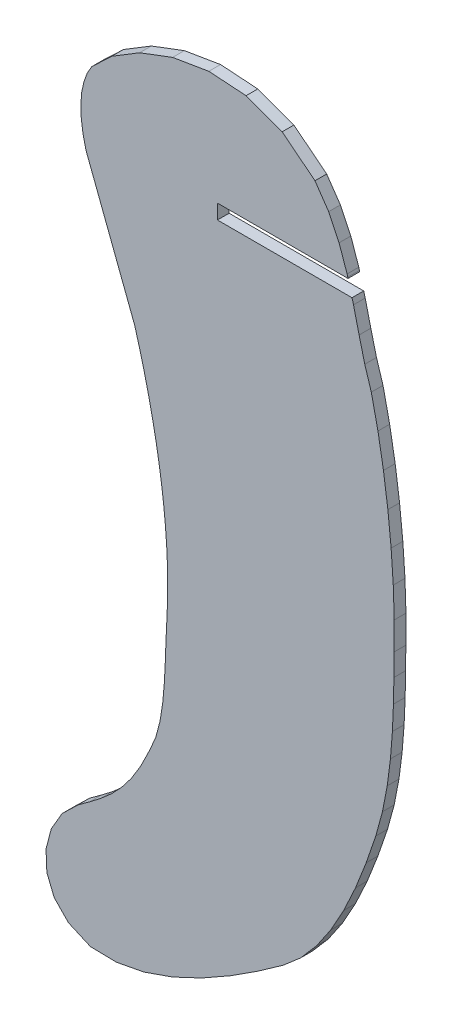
ISO-10303-21;
HEADER;
FILE_DESCRIPTION(('STEP AP214'),'2;1');
FILE_NAME('part.step','',(''),(''),'','','');
FILE_SCHEMA(('AUTOMOTIVE_DESIGN { 1 0 10303 214 1 1 1 1 }'));
ENDSEC;
DATA;
#1=APPLICATION_CONTEXT('core data for automotive mechanical design processes');
#2=APPLICATION_PROTOCOL_DEFINITION('international standard','automotive_design',2000,#1);
#3=PRODUCT_CONTEXT('',#1,'mechanical');
#4=PRODUCT('Part','Part','',(#3));
#5=PRODUCT_RELATED_PRODUCT_CATEGORY('part','',(#4));
#6=PRODUCT_DEFINITION_FORMATION('','',#4);
#7=PRODUCT_DEFINITION_CONTEXT('part definition',#1,'design');
#8=PRODUCT_DEFINITION('design','',#6,#7);
#9=PRODUCT_DEFINITION_SHAPE('','',#8);
#10=(LENGTH_UNIT() NAMED_UNIT(*) SI_UNIT(.MILLI.,.METRE.));
#11=(NAMED_UNIT(*) PLANE_ANGLE_UNIT() SI_UNIT($,.RADIAN.));
#12=(NAMED_UNIT(*) SI_UNIT($,.STERADIAN.) SOLID_ANGLE_UNIT());
#13=UNCERTAINTY_MEASURE_WITH_UNIT(LENGTH_MEASURE(1.E-05),#10,'distance_accuracy_value','');
#14=(GEOMETRIC_REPRESENTATION_CONTEXT(3) GLOBAL_UNCERTAINTY_ASSIGNED_CONTEXT((#13)) GLOBAL_UNIT_ASSIGNED_CONTEXT((#10,
#11,#12)) REPRESENTATION_CONTEXT('',''));
#15=CARTESIAN_POINT('',(0.,0.,0.));
#16=DIRECTION('',(0.,0.,1.));
#17=DIRECTION('',(1.,0.,0.));
#18=AXIS2_PLACEMENT_3D('',#15,#16,#17);
#19=CARTESIAN_POINT('',(-5730.0923,30.6663,2.));
#20=DIRECTION('',(0.999818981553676,0.0190264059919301,0.));
#21=DIRECTION('',(-0.0190264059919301,0.999818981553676,0.));
#22=AXIS2_PLACEMENT_3D('',#19,#20,#21);
#23=PLANE('',#22);
#24=DIRECTION('',(0.0190264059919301,-0.999818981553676,0.));
#25=VECTOR('',#24,1.);
#26=CARTESIAN_POINT('',(-5730.0923,30.6663,0.));
#27=LINE('',#26,#25);
#28=CARTESIAN_POINT('',(-5730.1433,33.3463,0.));
#29=VERTEX_POINT('',#28);
#30=CARTESIAN_POINT('',(-5730.0923,30.6663,0.));
#31=VERTEX_POINT('',#30);
#32=EDGE_CURVE('E638',#29,#31,#27,.T.);
#33=ORIENTED_EDGE('',*,*,#32,.T.);
#34=DIRECTION('',(0.,0.,-1.));
#35=VECTOR('',#34,1.);
#36=CARTESIAN_POINT('',(-5730.0923,30.6663,2.));
#37=LINE('',#36,#35);
#38=CARTESIAN_POINT('',(-5730.0923,30.6663,2.));
#39=VERTEX_POINT('',#38);
#40=EDGE_CURVE('E11',#39,#31,#37,.T.);
#41=ORIENTED_EDGE('',*,*,#40,.F.);
#42=DIRECTION('',(0.0190264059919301,-0.999818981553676,0.));
#43=VECTOR('',#42,1.);
#44=CARTESIAN_POINT('',(-5730.0923,30.6663,2.));
#45=LINE('',#44,#43);
#46=CARTESIAN_POINT('',(-5730.1433,33.3463,2.));
#47=VERTEX_POINT('',#46);
#48=EDGE_CURVE('E907',#47,#39,#45,.T.);
#49=ORIENTED_EDGE('',*,*,#48,.F.);
#50=DIRECTION('',(0.,0.,-1.));
#51=VECTOR('',#50,1.);
#52=CARTESIAN_POINT('',(-5730.1433,33.3463,2.));
#53=LINE('',#52,#51);
#54=EDGE_CURVE('E634',#47,#29,#53,.T.);
#55=ORIENTED_EDGE('',*,*,#54,.T.);
#56=EDGE_LOOP('',(#33,#41,#49,#55));
#57=FACE_BOUND('',#56,.T.);
#58=ADVANCED_FACE('F45',(#57),#23,.F.);
#59=CARTESIAN_POINT('',(-5730.1204,28.0461,2.));
#60=DIRECTION('',(0.999942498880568,-0.0107237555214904,0.));
#61=DIRECTION('',(0.0107237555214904,0.999942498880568,0.));
#62=AXIS2_PLACEMENT_3D('',#59,#60,#61);
#63=PLANE('',#62);
#64=DIRECTION('',(-0.0107237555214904,-0.999942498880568,0.));
#65=VECTOR('',#64,1.);
#66=CARTESIAN_POINT('',(-5730.1204,28.0461,0.));
#67=LINE('',#66,#65);
#68=CARTESIAN_POINT('',(-5730.1204,28.0461,0.));
#69=VERTEX_POINT('',#68);
#70=EDGE_CURVE('E642',#31,#69,#67,.T.);
#71=ORIENTED_EDGE('',*,*,#70,.T.);
#72=DIRECTION('',(0.,0.,-1.));
#73=VECTOR('',#72,1.);
#74=CARTESIAN_POINT('',(-5730.1204,28.0461,2.));
#75=LINE('',#74,#73);
#76=CARTESIAN_POINT('',(-5730.1204,28.0461,2.));
#77=VERTEX_POINT('',#76);
#78=EDGE_CURVE('E54',#77,#69,#75,.T.);
#79=ORIENTED_EDGE('',*,*,#78,.F.);
#80=DIRECTION('',(-0.0107237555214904,-0.999942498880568,0.));
#81=VECTOR('',#80,1.);
#82=CARTESIAN_POINT('',(-5730.1204,28.0461,2.));
#83=LINE('',#82,#81);
#84=EDGE_CURVE('E351',#39,#77,#83,.T.);
#85=ORIENTED_EDGE('',*,*,#84,.F.);
#86=ORIENTED_EDGE('',*,*,#40,.T.);
#87=EDGE_LOOP('',(#71,#79,#85,#86));
#88=FACE_BOUND('',#87,.T.);
#89=ADVANCED_FACE('F1547',(#88),#63,.F.);
#90=CARTESIAN_POINT('',(-5730.2285,25.4895,2.));
#91=DIRECTION('',(0.999107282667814,-0.04224497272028,0.));
#92=DIRECTION('',(0.04224497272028,0.999107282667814,0.));
#93=AXIS2_PLACEMENT_3D('',#90,#91,#92);
#94=PLANE('',#93);
#95=DIRECTION('',(-0.04224497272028,-0.999107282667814,0.));
#96=VECTOR('',#95,1.);
#97=CARTESIAN_POINT('',(-5730.2285,25.4895,0.));
#98=LINE('',#97,#96);
#99=CARTESIAN_POINT('',(-5730.2285,25.4895,0.));
#100=VERTEX_POINT('',#99);
#101=EDGE_CURVE('E645',#69,#100,#98,.T.);
#102=ORIENTED_EDGE('',*,*,#101,.T.);
#103=DIRECTION('',(0.,0.,-1.));
#104=VECTOR('',#103,1.);
#105=CARTESIAN_POINT('',(-5730.2285,25.4895,2.));
#106=LINE('',#105,#104);
#107=CARTESIAN_POINT('',(-5730.2285,25.4895,2.));
#108=VERTEX_POINT('',#107);
#109=EDGE_CURVE('E1246',#108,#100,#106,.T.);
#110=ORIENTED_EDGE('',*,*,#109,.F.);
#111=DIRECTION('',(-0.04224497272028,-0.999107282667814,0.));
#112=VECTOR('',#111,1.);
#113=CARTESIAN_POINT('',(-5730.2285,25.4895,2.));
#114=LINE('',#113,#112);
#115=EDGE_CURVE('E1256',#77,#108,#114,.T.);
#116=ORIENTED_EDGE('',*,*,#115,.F.);
#117=ORIENTED_EDGE('',*,*,#78,.T.);
#118=EDGE_LOOP('',(#102,#110,#116,#117));
#119=FACE_BOUND('',#118,.T.);
#120=ADVANCED_FACE('F1254',(#119),#94,.F.);
#121=CARTESIAN_POINT('',(-5730.3838,22.1823,2.));
#122=DIRECTION('',(0.998899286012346,-0.0469064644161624,0.));
#123=DIRECTION('',(0.0469064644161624,0.998899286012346,0.));
#124=AXIS2_PLACEMENT_3D('',#121,#122,#123);
#125=PLANE('',#124);
#126=DIRECTION('',(-0.0469064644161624,-0.998899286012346,0.));
#127=VECTOR('',#126,1.);
#128=CARTESIAN_POINT('',(-5730.3838,22.1823,0.));
#129=LINE('',#128,#127);
#130=CARTESIAN_POINT('',(-5730.3838,22.1823,0.));
#131=VERTEX_POINT('',#130);
#132=EDGE_CURVE('E648',#100,#131,#129,.T.);
#133=ORIENTED_EDGE('',*,*,#132,.T.);
#134=DIRECTION('',(0.,0.,-1.));
#135=VECTOR('',#134,1.);
#136=CARTESIAN_POINT('',(-5730.3838,22.1823,2.));
#137=LINE('',#136,#135);
#138=CARTESIAN_POINT('',(-5730.3838,22.1823,2.));
#139=VERTEX_POINT('',#138);
#140=EDGE_CURVE('E1242',#139,#131,#137,.T.);
#141=ORIENTED_EDGE('',*,*,#140,.F.);
#142=DIRECTION('',(-0.0469064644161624,-0.998899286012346,0.));
#143=VECTOR('',#142,1.);
#144=CARTESIAN_POINT('',(-5730.3838,22.1823,2.));
#145=LINE('',#144,#143);
#146=EDGE_CURVE('E1275',#108,#139,#145,.T.);
#147=ORIENTED_EDGE('',*,*,#146,.F.);
#148=ORIENTED_EDGE('',*,*,#109,.T.);
#149=EDGE_LOOP('',(#133,#141,#147,#148));
#150=FACE_BOUND('',#149,.T.);
#151=ADVANCED_FACE('F1265',(#150),#125,.F.);
#152=CARTESIAN_POINT('',(-5730.5085,18.8861,2.));
#153=DIRECTION('',(0.999285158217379,-0.0378043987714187,0.));
#154=DIRECTION('',(0.0378043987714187,0.999285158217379,0.));
#155=AXIS2_PLACEMENT_3D('',#152,#153,#154);
#156=PLANE('',#155);
#157=DIRECTION('',(-0.0378043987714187,-0.999285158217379,0.));
#158=VECTOR('',#157,1.);
#159=CARTESIAN_POINT('',(-5730.5085,18.8861,0.));
#160=LINE('',#159,#158);
#161=CARTESIAN_POINT('',(-5730.5085,18.8861,0.));
#162=VERTEX_POINT('',#161);
#163=EDGE_CURVE('E651',#131,#162,#160,.T.);
#164=ORIENTED_EDGE('',*,*,#163,.T.);
#165=DIRECTION('',(0.,0.,-1.));
#166=VECTOR('',#165,1.);
#167=CARTESIAN_POINT('',(-5730.5085,18.8861,2.));
#168=LINE('',#167,#166);
#169=CARTESIAN_POINT('',(-5730.5085,18.8861,2.));
#170=VERTEX_POINT('',#169);
#171=EDGE_CURVE('E1238',#170,#162,#168,.T.);
#172=ORIENTED_EDGE('',*,*,#171,.F.);
#173=DIRECTION('',(-0.0378043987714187,-0.999285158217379,0.));
#174=VECTOR('',#173,1.);
#175=CARTESIAN_POINT('',(-5730.5085,18.8861,2.));
#176=LINE('',#175,#174);
#177=EDGE_CURVE('E1271',#139,#170,#176,.T.);
#178=ORIENTED_EDGE('',*,*,#177,.F.);
#179=ORIENTED_EDGE('',*,*,#140,.T.);
#180=EDGE_LOOP('',(#164,#172,#178,#179));
#181=FACE_BOUND('',#180,.T.);
#182=ADVANCED_FACE('F1269',(#181),#156,.F.);
#183=CARTESIAN_POINT('',(-5730.6738,15.6553,2.));
#184=DIRECTION('',(0.998693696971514,-0.0510969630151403,0.));
#185=DIRECTION('',(0.0510969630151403,0.998693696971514,0.));
#186=AXIS2_PLACEMENT_3D('',#183,#184,#185);
#187=PLANE('',#186);
#188=DIRECTION('',(-0.0510969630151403,-0.998693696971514,0.));
#189=VECTOR('',#188,1.);
#190=CARTESIAN_POINT('',(-5730.6738,15.6553,0.));
#191=LINE('',#190,#189);
#192=CARTESIAN_POINT('',(-5730.6738,15.6553,0.));
#193=VERTEX_POINT('',#192);
#194=EDGE_CURVE('E654',#162,#193,#191,.T.);
#195=ORIENTED_EDGE('',*,*,#194,.T.);
#196=DIRECTION('',(0.,0.,-1.));
#197=VECTOR('',#196,1.);
#198=CARTESIAN_POINT('',(-5730.6738,15.6553,2.));
#199=LINE('',#198,#197);
#200=CARTESIAN_POINT('',(-5730.6738,15.6553,2.));
#201=VERTEX_POINT('',#200);
#202=EDGE_CURVE('E1234',#201,#193,#199,.T.);
#203=ORIENTED_EDGE('',*,*,#202,.F.);
#204=DIRECTION('',(-0.0510969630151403,-0.998693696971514,0.));
#205=VECTOR('',#204,1.);
#206=CARTESIAN_POINT('',(-5730.6738,15.6553,2.));
#207=LINE('',#206,#205);
#208=EDGE_CURVE('E1274',#170,#201,#207,.T.);
#209=ORIENTED_EDGE('',*,*,#208,.F.);
#210=ORIENTED_EDGE('',*,*,#171,.T.);
#211=EDGE_LOOP('',(#195,#203,#209,#210));
#212=FACE_BOUND('',#211,.T.);
#213=ADVANCED_FACE('F1560',(#212),#187,.F.);
#214=CARTESIAN_POINT('',(-5730.9502,12.5448,2.));
#215=DIRECTION('',(0.996075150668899,-0.0885115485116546,0.));
#216=DIRECTION('',(0.0885115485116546,0.996075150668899,0.));
#217=AXIS2_PLACEMENT_3D('',#214,#215,#216);
#218=PLANE('',#217);
#219=DIRECTION('',(-0.0885115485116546,-0.996075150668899,0.));
#220=VECTOR('',#219,1.);
#221=CARTESIAN_POINT('',(-5730.9502,12.5448,0.));
#222=LINE('',#221,#220);
#223=CARTESIAN_POINT('',(-5730.9502,12.5448,0.));
#224=VERTEX_POINT('',#223);
#225=EDGE_CURVE('E657',#193,#224,#222,.T.);
#226=ORIENTED_EDGE('',*,*,#225,.T.);
#227=DIRECTION('',(0.,0.,-1.));
#228=VECTOR('',#227,1.);
#229=CARTESIAN_POINT('',(-5730.9502,12.5448,2.));
#230=LINE('',#229,#228);
#231=CARTESIAN_POINT('',(-5730.9502,12.5448,2.));
#232=VERTEX_POINT('',#231);
#233=EDGE_CURVE('E1230',#232,#224,#230,.T.);
#234=ORIENTED_EDGE('',*,*,#233,.F.);
#235=DIRECTION('',(-0.0885115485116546,-0.996075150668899,0.));
#236=VECTOR('',#235,1.);
#237=CARTESIAN_POINT('',(-5730.9502,12.5448,2.));
#238=LINE('',#237,#236);
#239=EDGE_CURVE('E1279',#201,#232,#238,.T.);
#240=ORIENTED_EDGE('',*,*,#239,.F.);
#241=ORIENTED_EDGE('',*,*,#202,.T.);
#242=EDGE_LOOP('',(#226,#234,#240,#241));
#243=FACE_BOUND('',#242,.T.);
#244=ADVANCED_FACE('F1563',(#243),#218,.F.);
#245=CARTESIAN_POINT('',(-5731.4089,9.6089,2.));
#246=DIRECTION('',(0.988013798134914,-0.154365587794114,0.));
#247=DIRECTION('',(0.154365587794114,0.988013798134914,0.));
#248=AXIS2_PLACEMENT_3D('',#245,#246,#247);
#249=PLANE('',#248);
#250=DIRECTION('',(-0.154365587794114,-0.988013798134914,0.));
#251=VECTOR('',#250,1.);
#252=CARTESIAN_POINT('',(-5731.4089,9.6089,0.));
#253=LINE('',#252,#251);
#254=CARTESIAN_POINT('',(-5731.4089,9.6089,0.));
#255=VERTEX_POINT('',#254);
#256=EDGE_CURVE('E660',#224,#255,#253,.T.);
#257=ORIENTED_EDGE('',*,*,#256,.T.);
#258=DIRECTION('',(0.,0.,-1.));
#259=VECTOR('',#258,1.);
#260=CARTESIAN_POINT('',(-5731.4089,9.6089,2.));
#261=LINE('',#260,#259);
#262=CARTESIAN_POINT('',(-5731.4089,9.6089,2.));
#263=VERTEX_POINT('',#262);
#264=EDGE_CURVE('E1226',#263,#255,#261,.T.);
#265=ORIENTED_EDGE('',*,*,#264,.F.);
#266=DIRECTION('',(-0.154365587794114,-0.988013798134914,0.));
#267=VECTOR('',#266,1.);
#268=CARTESIAN_POINT('',(-5731.4089,9.6089,2.));
#269=LINE('',#268,#267);
#270=EDGE_CURVE('E1286',#232,#263,#269,.T.);
#271=ORIENTED_EDGE('',*,*,#270,.F.);
#272=ORIENTED_EDGE('',*,*,#233,.T.);
#273=EDGE_LOOP('',(#257,#265,#271,#272));
#274=FACE_BOUND('',#273,.T.);
#275=ADVANCED_FACE('F1567',(#274),#249,.F.);
#276=CARTESIAN_POINT('',(-5732.1206,6.9024,2.));
#277=DIRECTION('',(0.967121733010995,-0.254313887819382,0.));
#278=DIRECTION('',(0.254313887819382,0.967121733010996,0.));
#279=AXIS2_PLACEMENT_3D('',#276,#277,#278);
#280=PLANE('',#279);
#281=DIRECTION('',(-0.254313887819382,-0.967121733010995,0.));
#282=VECTOR('',#281,1.);
#283=CARTESIAN_POINT('',(-5732.1206,6.9024,0.));
#284=LINE('',#283,#282);
#285=CARTESIAN_POINT('',(-5732.1206,6.9024,0.));
#286=VERTEX_POINT('',#285);
#287=EDGE_CURVE('E663',#255,#286,#284,.T.);
#288=ORIENTED_EDGE('',*,*,#287,.T.);
#289=DIRECTION('',(0.,0.,-1.));
#290=VECTOR('',#289,1.);
#291=CARTESIAN_POINT('',(-5732.1206,6.9024,2.));
#292=LINE('',#291,#290);
#293=CARTESIAN_POINT('',(-5732.1206,6.9024,2.));
#294=VERTEX_POINT('',#293);
#295=EDGE_CURVE('E1222',#294,#286,#292,.T.);
#296=ORIENTED_EDGE('',*,*,#295,.F.);
#297=DIRECTION('',(-0.254313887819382,-0.967121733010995,0.));
#298=VECTOR('',#297,1.);
#299=CARTESIAN_POINT('',(-5732.1206,6.9024,2.));
#300=LINE('',#299,#298);
#301=EDGE_CURVE('E1289',#263,#294,#300,.T.);
#302=ORIENTED_EDGE('',*,*,#301,.F.);
#303=ORIENTED_EDGE('',*,*,#264,.T.);
#304=EDGE_LOOP('',(#288,#296,#302,#303));
#305=FACE_BOUND('',#304,.T.);
#306=ADVANCED_FACE('F1571',(#305),#280,.F.);
#307=CARTESIAN_POINT('',(-5733.1559,4.48,2.));
#308=DIRECTION('',(0.919539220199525,-0.392998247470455,0.));
#309=DIRECTION('',(0.392998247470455,0.919539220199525,0.));
#310=AXIS2_PLACEMENT_3D('',#307,#308,#309);
#311=PLANE('',#310);
#312=DIRECTION('',(-0.392998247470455,-0.919539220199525,0.));
#313=VECTOR('',#312,1.);
#314=CARTESIAN_POINT('',(-5733.1559,4.48,0.));
#315=LINE('',#314,#313);
#316=CARTESIAN_POINT('',(-5733.1559,4.48,0.));
#317=VERTEX_POINT('',#316);
#318=EDGE_CURVE('E666',#286,#317,#315,.T.);
#319=ORIENTED_EDGE('',*,*,#318,.T.);
#320=DIRECTION('',(0.,0.,-1.));
#321=VECTOR('',#320,1.);
#322=CARTESIAN_POINT('',(-5733.1559,4.48,2.));
#323=LINE('',#322,#321);
#324=CARTESIAN_POINT('',(-5733.1559,4.48,2.));
#325=VERTEX_POINT('',#324);
#326=EDGE_CURVE('E1218',#325,#317,#323,.T.);
#327=ORIENTED_EDGE('',*,*,#326,.F.);
#328=DIRECTION('',(-0.392998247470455,-0.919539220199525,0.));
#329=VECTOR('',#328,1.);
#330=CARTESIAN_POINT('',(-5733.1559,4.48,2.));
#331=LINE('',#330,#329);
#332=EDGE_CURVE('E1292',#294,#325,#331,.T.);
#333=ORIENTED_EDGE('',*,*,#332,.F.);
#334=ORIENTED_EDGE('',*,*,#295,.T.);
#335=EDGE_LOOP('',(#319,#327,#333,#334));
#336=FACE_BOUND('',#335,.T.);
#337=ADVANCED_FACE('F1575',(#336),#311,.F.);
#338=CARTESIAN_POINT('',(-5734.7295,1.285,2.));
#339=DIRECTION('',(0.897095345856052,-0.441837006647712,0.));
#340=DIRECTION('',(0.441837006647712,0.897095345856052,0.));
#341=AXIS2_PLACEMENT_3D('',#338,#339,#340);
#342=PLANE('',#341);
#343=DIRECTION('',(-0.441837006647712,-0.897095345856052,0.));
#344=VECTOR('',#343,1.);
#345=CARTESIAN_POINT('',(-5734.7295,1.285,0.));
#346=LINE('',#345,#344);
#347=CARTESIAN_POINT('',(-5734.7295,1.285,0.));
#348=VERTEX_POINT('',#347);
#349=EDGE_CURVE('E669',#317,#348,#346,.T.);
#350=ORIENTED_EDGE('',*,*,#349,.T.);
#351=DIRECTION('',(0.,0.,-1.));
#352=VECTOR('',#351,1.);
#353=CARTESIAN_POINT('',(-5734.7295,1.285,2.));
#354=LINE('',#353,#352);
#355=CARTESIAN_POINT('',(-5734.7295,1.285,2.));
#356=VERTEX_POINT('',#355);
#357=EDGE_CURVE('E1214',#356,#348,#354,.T.);
#358=ORIENTED_EDGE('',*,*,#357,.F.);
#359=DIRECTION('',(-0.441837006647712,-0.897095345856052,0.));
#360=VECTOR('',#359,1.);
#361=CARTESIAN_POINT('',(-5734.7295,1.285,2.));
#362=LINE('',#361,#360);
#363=EDGE_CURVE('E1295',#325,#356,#362,.T.);
#364=ORIENTED_EDGE('',*,*,#363,.F.);
#365=ORIENTED_EDGE('',*,*,#326,.T.);
#366=EDGE_LOOP('',(#350,#358,#364,#365));
#367=FACE_BOUND('',#366,.T.);
#368=ADVANCED_FACE('F1579',(#367),#342,.F.);
#369=CARTESIAN_POINT('',(-5736.3352,-1.3262,2.));
#370=DIRECTION('',(0.851831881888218,-0.523815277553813,0.));
#371=DIRECTION('',(0.523815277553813,0.851831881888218,0.));
#372=AXIS2_PLACEMENT_3D('',#369,#370,#371);
#373=PLANE('',#372);
#374=DIRECTION('',(-0.523815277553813,-0.851831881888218,0.));
#375=VECTOR('',#374,1.);
#376=CARTESIAN_POINT('',(-5736.3352,-1.3262,0.));
#377=LINE('',#376,#375);
#378=CARTESIAN_POINT('',(-5736.3352,-1.3262,0.));
#379=VERTEX_POINT('',#378);
#380=EDGE_CURVE('E672',#348,#379,#377,.T.);
#381=ORIENTED_EDGE('',*,*,#380,.T.);
#382=DIRECTION('',(0.,0.,-1.));
#383=VECTOR('',#382,1.);
#384=CARTESIAN_POINT('',(-5736.3352,-1.3262,2.));
#385=LINE('',#384,#383);
#386=CARTESIAN_POINT('',(-5736.3352,-1.3262,2.));
#387=VERTEX_POINT('',#386);
#388=EDGE_CURVE('E1210',#387,#379,#385,.T.);
#389=ORIENTED_EDGE('',*,*,#388,.F.);
#390=DIRECTION('',(-0.523815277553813,-0.851831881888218,0.));
#391=VECTOR('',#390,1.);
#392=CARTESIAN_POINT('',(-5736.3352,-1.3262,2.));
#393=LINE('',#392,#391);
#394=EDGE_CURVE('E1298',#356,#387,#393,.T.);
#395=ORIENTED_EDGE('',*,*,#394,.F.);
#396=ORIENTED_EDGE('',*,*,#357,.T.);
#397=EDGE_LOOP('',(#381,#389,#395,#396));
#398=FACE_BOUND('',#397,.T.);
#399=ADVANCED_FACE('F1583',(#398),#373,.F.);
#400=CARTESIAN_POINT('',(-5737.9895,-3.4725,2.));
#401=DIRECTION('',(0.792035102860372,-0.610475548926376,0.));
#402=DIRECTION('',(0.610475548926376,0.792035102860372,0.));
#403=AXIS2_PLACEMENT_3D('',#400,#401,#402);
#404=PLANE('',#403);
#405=DIRECTION('',(-0.610475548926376,-0.792035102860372,0.));
#406=VECTOR('',#405,1.);
#407=CARTESIAN_POINT('',(-5737.9895,-3.4725,0.));
#408=LINE('',#407,#406);
#409=CARTESIAN_POINT('',(-5737.9895,-3.4725,0.));
#410=VERTEX_POINT('',#409);
#411=EDGE_CURVE('E675',#379,#410,#408,.T.);
#412=ORIENTED_EDGE('',*,*,#411,.T.);
#413=DIRECTION('',(0.,0.,-1.));
#414=VECTOR('',#413,1.);
#415=CARTESIAN_POINT('',(-5737.9895,-3.4725,2.));
#416=LINE('',#415,#414);
#417=CARTESIAN_POINT('',(-5737.9895,-3.4725,2.));
#418=VERTEX_POINT('',#417);
#419=EDGE_CURVE('E1206',#418,#410,#416,.T.);
#420=ORIENTED_EDGE('',*,*,#419,.F.);
#421=DIRECTION('',(-0.610475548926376,-0.792035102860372,0.));
#422=VECTOR('',#421,1.);
#423=CARTESIAN_POINT('',(-5737.9895,-3.4725,2.));
#424=LINE('',#423,#422);
#425=EDGE_CURVE('E1301',#387,#418,#424,.T.);
#426=ORIENTED_EDGE('',*,*,#425,.F.);
#427=ORIENTED_EDGE('',*,*,#388,.T.);
#428=EDGE_LOOP('',(#412,#420,#426,#427));
#429=FACE_BOUND('',#428,.T.);
#430=ADVANCED_FACE('F1587',(#429),#404,.F.);
#431=CARTESIAN_POINT('',(-5739.709,-5.272,2.));
#432=DIRECTION('',(0.722995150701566,-0.690853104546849,0.));
#433=DIRECTION('',(0.690853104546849,0.722995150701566,0.));
#434=AXIS2_PLACEMENT_3D('',#431,#432,#433);
#435=PLANE('',#434);
#436=DIRECTION('',(-0.690853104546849,-0.722995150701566,0.));
#437=VECTOR('',#436,1.);
#438=CARTESIAN_POINT('',(-5739.709,-5.272,0.));
#439=LINE('',#438,#437);
#440=CARTESIAN_POINT('',(-5739.709,-5.272,0.));
#441=VERTEX_POINT('',#440);
#442=EDGE_CURVE('E678',#410,#441,#439,.T.);
#443=ORIENTED_EDGE('',*,*,#442,.T.);
#444=DIRECTION('',(0.,0.,-1.));
#445=VECTOR('',#444,1.);
#446=CARTESIAN_POINT('',(-5739.709,-5.272,2.));
#447=LINE('',#446,#445);
#448=CARTESIAN_POINT('',(-5739.709,-5.272,2.));
#449=VERTEX_POINT('',#448);
#450=EDGE_CURVE('E1202',#449,#441,#447,.T.);
#451=ORIENTED_EDGE('',*,*,#450,.F.);
#452=DIRECTION('',(-0.690853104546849,-0.722995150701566,0.));
#453=VECTOR('',#452,1.);
#454=CARTESIAN_POINT('',(-5739.709,-5.272,2.));
#455=LINE('',#454,#453);
#456=EDGE_CURVE('E1304',#418,#449,#455,.T.);
#457=ORIENTED_EDGE('',*,*,#456,.F.);
#458=ORIENTED_EDGE('',*,*,#419,.T.);
#459=EDGE_LOOP('',(#443,#451,#457,#458));
#460=FACE_BOUND('',#459,.T.);
#461=ADVANCED_FACE('F1591',(#460),#435,.F.);
#462=CARTESIAN_POINT('',(-5741.5103,-6.8437,2.));
#463=DIRECTION('',(0.657452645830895,-0.753495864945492,0.));
#464=DIRECTION('',(0.753495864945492,0.657452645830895,0.));
#465=AXIS2_PLACEMENT_3D('',#462,#463,#464);
#466=PLANE('',#465);
#467=DIRECTION('',(-0.753495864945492,-0.657452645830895,0.));
#468=VECTOR('',#467,1.);
#469=CARTESIAN_POINT('',(-5741.5103,-6.8437,0.));
#470=LINE('',#469,#468);
#471=CARTESIAN_POINT('',(-5741.5103,-6.8437,0.));
#472=VERTEX_POINT('',#471);
#473=EDGE_CURVE('E681',#441,#472,#470,.T.);
#474=ORIENTED_EDGE('',*,*,#473,.T.);
#475=DIRECTION('',(0.,0.,-1.));
#476=VECTOR('',#475,1.);
#477=CARTESIAN_POINT('',(-5741.5103,-6.8437,2.));
#478=LINE('',#477,#476);
#479=CARTESIAN_POINT('',(-5741.5103,-6.8437,2.));
#480=VERTEX_POINT('',#479);
#481=EDGE_CURVE('E1198',#480,#472,#478,.T.);
#482=ORIENTED_EDGE('',*,*,#481,.F.);
#483=DIRECTION('',(-0.753495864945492,-0.657452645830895,0.));
#484=VECTOR('',#483,1.);
#485=CARTESIAN_POINT('',(-5741.5103,-6.8437,2.));
#486=LINE('',#485,#484);
#487=EDGE_CURVE('E1307',#449,#480,#486,.T.);
#488=ORIENTED_EDGE('',*,*,#487,.F.);
#489=ORIENTED_EDGE('',*,*,#450,.T.);
#490=EDGE_LOOP('',(#474,#482,#488,#489));
#491=FACE_BOUND('',#490,.T.);
#492=ADVANCED_FACE('F1595',(#491),#466,.F.);
#493=CARTESIAN_POINT('',(-5743.4102,-8.3056,2.));
#494=DIRECTION('',(0.609825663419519,-0.792535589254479,0.));
#495=DIRECTION('',(0.792535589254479,0.609825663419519,0.));
#496=AXIS2_PLACEMENT_3D('',#493,#494,#495);
#497=PLANE('',#496);
#498=DIRECTION('',(-0.792535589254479,-0.609825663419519,0.));
#499=VECTOR('',#498,1.);
#500=CARTESIAN_POINT('',(-5743.4102,-8.3056,0.));
#501=LINE('',#500,#499);
#502=CARTESIAN_POINT('',(-5743.4102,-8.3056,0.));
#503=VERTEX_POINT('',#502);
#504=EDGE_CURVE('E684',#472,#503,#501,.T.);
#505=ORIENTED_EDGE('',*,*,#504,.T.);
#506=DIRECTION('',(0.,0.,-1.));
#507=VECTOR('',#506,1.);
#508=CARTESIAN_POINT('',(-5743.4102,-8.3056,2.));
#509=LINE('',#508,#507);
#510=CARTESIAN_POINT('',(-5743.4102,-8.3056,2.));
#511=VERTEX_POINT('',#510);
#512=EDGE_CURVE('E1194',#511,#503,#509,.T.);
#513=ORIENTED_EDGE('',*,*,#512,.F.);
#514=DIRECTION('',(-0.792535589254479,-0.609825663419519,0.));
#515=VECTOR('',#514,1.);
#516=CARTESIAN_POINT('',(-5743.4102,-8.3056,2.));
#517=LINE('',#516,#515);
#518=EDGE_CURVE('E1310',#480,#511,#517,.T.);
#519=ORIENTED_EDGE('',*,*,#518,.F.);
#520=ORIENTED_EDGE('',*,*,#481,.T.);
#521=EDGE_LOOP('',(#505,#513,#519,#520));
#522=FACE_BOUND('',#521,.T.);
#523=ADVANCED_FACE('F1599',(#522),#497,.F.);
#524=CARTESIAN_POINT('',(-5745.4249,-9.7765,2.));
#525=DIRECTION('',(0.589655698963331,-0.807654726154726,0.));
#526=DIRECTION('',(0.807654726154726,0.589655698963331,0.));
#527=AXIS2_PLACEMENT_3D('',#524,#525,#526);
#528=PLANE('',#527);
#529=DIRECTION('',(-0.807654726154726,-0.589655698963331,0.));
#530=VECTOR('',#529,1.);
#531=CARTESIAN_POINT('',(-5745.4249,-9.7765,0.));
#532=LINE('',#531,#530);
#533=CARTESIAN_POINT('',(-5745.4249,-9.7765,0.));
#534=VERTEX_POINT('',#533);
#535=EDGE_CURVE('E687',#503,#534,#532,.T.);
#536=ORIENTED_EDGE('',*,*,#535,.T.);
#537=DIRECTION('',(0.,0.,-1.));
#538=VECTOR('',#537,1.);
#539=CARTESIAN_POINT('',(-5745.4249,-9.7765,2.));
#540=LINE('',#539,#538);
#541=CARTESIAN_POINT('',(-5745.4249,-9.7765,2.));
#542=VERTEX_POINT('',#541);
#543=EDGE_CURVE('E1190',#542,#534,#540,.T.);
#544=ORIENTED_EDGE('',*,*,#543,.F.);
#545=DIRECTION('',(-0.807654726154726,-0.589655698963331,0.));
#546=VECTOR('',#545,1.);
#547=CARTESIAN_POINT('',(-5745.4249,-9.7765,2.));
#548=LINE('',#547,#546);
#549=EDGE_CURVE('E1313',#511,#542,#548,.T.);
#550=ORIENTED_EDGE('',*,*,#549,.F.);
#551=ORIENTED_EDGE('',*,*,#512,.T.);
#552=EDGE_LOOP('',(#536,#544,#550,#551));
#553=FACE_BOUND('',#552,.T.);
#554=ADVANCED_FACE('F1603',(#553),#528,.F.);
#555=CARTESIAN_POINT('',(-5748.1363,-12.411,2.));
#556=DIRECTION('',(0.696863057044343,-0.717204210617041,0.));
#557=DIRECTION('',(0.717204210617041,0.696863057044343,0.));
#558=AXIS2_PLACEMENT_3D('',#555,#556,#557);
#559=PLANE('',#558);
#560=DIRECTION('',(-0.717204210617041,-0.696863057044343,0.));
#561=VECTOR('',#560,1.);
#562=CARTESIAN_POINT('',(-5748.1363,-12.411,0.));
#563=LINE('',#562,#561);
#564=CARTESIAN_POINT('',(-5748.1363,-12.411,0.));
#565=VERTEX_POINT('',#564);
#566=EDGE_CURVE('E690',#534,#565,#563,.T.);
#567=ORIENTED_EDGE('',*,*,#566,.T.);
#568=DIRECTION('',(0.,0.,-1.));
#569=VECTOR('',#568,1.);
#570=CARTESIAN_POINT('',(-5748.1363,-12.411,2.));
#571=LINE('',#570,#569);
#572=CARTESIAN_POINT('',(-5748.1363,-12.411,2.));
#573=VERTEX_POINT('',#572);
#574=EDGE_CURVE('E1186',#573,#565,#571,.T.);
#575=ORIENTED_EDGE('',*,*,#574,.F.);
#576=DIRECTION('',(-0.717204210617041,-0.696863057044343,0.));
#577=VECTOR('',#576,1.);
#578=CARTESIAN_POINT('',(-5748.1363,-12.411,2.));
#579=LINE('',#578,#577);
#580=EDGE_CURVE('E1316',#542,#573,#579,.T.);
#581=ORIENTED_EDGE('',*,*,#580,.F.);
#582=ORIENTED_EDGE('',*,*,#543,.T.);
#583=EDGE_LOOP('',(#567,#575,#581,#582));
#584=FACE_BOUND('',#583,.T.);
#585=ADVANCED_FACE('F1607',(#584),#559,.F.);
#586=CARTESIAN_POINT('',(-5749.9813,-15.5826,2.));
#587=DIRECTION('',(0.864383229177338,-0.502833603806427,0.));
#588=DIRECTION('',(0.502833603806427,0.864383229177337,0.));
#589=AXIS2_PLACEMENT_3D('',#586,#587,#588);
#590=PLANE('',#589);
#591=DIRECTION('',(-0.502833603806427,-0.864383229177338,0.));
#592=VECTOR('',#591,1.);
#593=CARTESIAN_POINT('',(-5749.9813,-15.5826,0.));
#594=LINE('',#593,#592);
#595=CARTESIAN_POINT('',(-5749.9813,-15.5826,0.));
#596=VERTEX_POINT('',#595);
#597=EDGE_CURVE('E693',#565,#596,#594,.T.);
#598=ORIENTED_EDGE('',*,*,#597,.T.);
#599=DIRECTION('',(0.,0.,-1.));
#600=VECTOR('',#599,1.);
#601=CARTESIAN_POINT('',(-5749.9813,-15.5826,2.));
#602=LINE('',#601,#600);
#603=CARTESIAN_POINT('',(-5749.9813,-15.5826,2.));
#604=VERTEX_POINT('',#603);
#605=EDGE_CURVE('E1182',#604,#596,#602,.T.);
#606=ORIENTED_EDGE('',*,*,#605,.F.);
#607=DIRECTION('',(-0.502833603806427,-0.864383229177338,0.));
#608=VECTOR('',#607,1.);
#609=CARTESIAN_POINT('',(-5749.9813,-15.5826,2.));
#610=LINE('',#609,#608);
#611=EDGE_CURVE('E1319',#573,#604,#610,.T.);
#612=ORIENTED_EDGE('',*,*,#611,.F.);
#613=ORIENTED_EDGE('',*,*,#574,.T.);
#614=EDGE_LOOP('',(#598,#606,#612,#613));
#615=FACE_BOUND('',#614,.T.);
#616=ADVANCED_FACE('F1611',(#615),#590,.F.);
#617=CARTESIAN_POINT('',(-5750.8771,-19.0106,2.));
#618=DIRECTION('',(0.967511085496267,-0.252828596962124,0.));
#619=DIRECTION('',(0.252828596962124,0.967511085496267,0.));
#620=AXIS2_PLACEMENT_3D('',#617,#618,#619);
#621=PLANE('',#620);
#622=DIRECTION('',(-0.252828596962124,-0.967511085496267,0.));
#623=VECTOR('',#622,1.);
#624=CARTESIAN_POINT('',(-5750.8771,-19.0106,0.));
#625=LINE('',#624,#623);
#626=CARTESIAN_POINT('',(-5750.8771,-19.0106,0.));
#627=VERTEX_POINT('',#626);
#628=EDGE_CURVE('E696',#596,#627,#625,.T.);
#629=ORIENTED_EDGE('',*,*,#628,.T.);
#630=DIRECTION('',(0.,0.,-1.));
#631=VECTOR('',#630,1.);
#632=CARTESIAN_POINT('',(-5750.8771,-19.0106,2.));
#633=LINE('',#632,#631);
#634=CARTESIAN_POINT('',(-5750.8771,-19.0106,2.));
#635=VERTEX_POINT('',#634);
#636=EDGE_CURVE('E1178',#635,#627,#633,.T.);
#637=ORIENTED_EDGE('',*,*,#636,.F.);
#638=DIRECTION('',(-0.252828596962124,-0.967511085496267,0.));
#639=VECTOR('',#638,1.);
#640=CARTESIAN_POINT('',(-5750.8771,-19.0106,2.));
#641=LINE('',#640,#639);
#642=EDGE_CURVE('E1322',#604,#635,#641,.T.);
#643=ORIENTED_EDGE('',*,*,#642,.F.);
#644=ORIENTED_EDGE('',*,*,#605,.T.);
#645=EDGE_LOOP('',(#629,#637,#643,#644));
#646=FACE_BOUND('',#645,.T.);
#647=ADVANCED_FACE('F1615',(#646),#621,.F.);
#648=CARTESIAN_POINT('',(-5750.7401,-22.4138,2.));
#649=DIRECTION('',(0.99919070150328,0.0402236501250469,0.));
#650=DIRECTION('',(-0.0402236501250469,0.999190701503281,0.));
#651=AXIS2_PLACEMENT_3D('',#648,#649,#650);
#652=PLANE('',#651);
#653=DIRECTION('',(0.0402236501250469,-0.99919070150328,0.));
#654=VECTOR('',#653,1.);
#655=CARTESIAN_POINT('',(-5750.7401,-22.4138,0.));
#656=LINE('',#655,#654);
#657=CARTESIAN_POINT('',(-5750.7401,-22.4138,0.));
#658=VERTEX_POINT('',#657);
#659=EDGE_CURVE('E699',#627,#658,#656,.T.);
#660=ORIENTED_EDGE('',*,*,#659,.T.);
#661=DIRECTION('',(0.,0.,-1.));
#662=VECTOR('',#661,1.);
#663=CARTESIAN_POINT('',(-5750.7401,-22.4138,2.));
#664=LINE('',#663,#662);
#665=CARTESIAN_POINT('',(-5750.7401,-22.4138,2.));
#666=VERTEX_POINT('',#665);
#667=EDGE_CURVE('E1174',#666,#658,#664,.T.);
#668=ORIENTED_EDGE('',*,*,#667,.F.);
#669=DIRECTION('',(0.0402236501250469,-0.99919070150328,0.));
#670=VECTOR('',#669,1.);
#671=CARTESIAN_POINT('',(-5750.7401,-22.4138,2.));
#672=LINE('',#671,#670);
#673=EDGE_CURVE('E1325',#635,#666,#672,.T.);
#674=ORIENTED_EDGE('',*,*,#673,.F.);
#675=ORIENTED_EDGE('',*,*,#636,.T.);
#676=EDGE_LOOP('',(#660,#668,#674,#675));
#677=FACE_BOUND('',#676,.T.);
#678=ADVANCED_FACE('F1619',(#677),#652,.F.);
#679=CARTESIAN_POINT('',(-5749.4876,-25.511,2.));
#680=DIRECTION('',(0.927064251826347,0.374902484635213,0.));
#681=DIRECTION('',(-0.374902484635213,0.927064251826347,0.));
#682=AXIS2_PLACEMENT_3D('',#679,#680,#681);
#683=PLANE('',#682);
#684=DIRECTION('',(0.374902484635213,-0.927064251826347,0.));
#685=VECTOR('',#684,1.);
#686=CARTESIAN_POINT('',(-5749.4876,-25.511,0.));
#687=LINE('',#686,#685);
#688=CARTESIAN_POINT('',(-5749.4876,-25.511,0.));
#689=VERTEX_POINT('',#688);
#690=EDGE_CURVE('E702',#658,#689,#687,.T.);
#691=ORIENTED_EDGE('',*,*,#690,.T.);
#692=DIRECTION('',(0.,0.,-1.));
#693=VECTOR('',#692,1.);
#694=CARTESIAN_POINT('',(-5749.4876,-25.511,2.));
#695=LINE('',#694,#693);
#696=CARTESIAN_POINT('',(-5749.4876,-25.511,2.));
#697=VERTEX_POINT('',#696);
#698=EDGE_CURVE('E1170',#697,#689,#695,.T.);
#699=ORIENTED_EDGE('',*,*,#698,.F.);
#700=DIRECTION('',(0.374902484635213,-0.927064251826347,0.));
#701=VECTOR('',#700,1.);
#702=CARTESIAN_POINT('',(-5749.4876,-25.511,2.));
#703=LINE('',#702,#701);
#704=EDGE_CURVE('E1328',#666,#697,#703,.T.);
#705=ORIENTED_EDGE('',*,*,#704,.F.);
#706=ORIENTED_EDGE('',*,*,#667,.T.);
#707=EDGE_LOOP('',(#691,#699,#705,#706));
#708=FACE_BOUND('',#707,.T.);
#709=ADVANCED_FACE('F1623',(#708),#683,.F.);
#710=CARTESIAN_POINT('',(-5747.0359,-28.0212,2.));
#711=DIRECTION('',(0.715393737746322,0.698721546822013,0.));
#712=DIRECTION('',(-0.698721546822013,0.715393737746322,0.));
#713=AXIS2_PLACEMENT_3D('',#710,#711,#712);
#714=PLANE('',#713);
#715=DIRECTION('',(0.698721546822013,-0.715393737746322,0.));
#716=VECTOR('',#715,1.);
#717=CARTESIAN_POINT('',(-5747.0359,-28.0212,0.));
#718=LINE('',#717,#716);
#719=CARTESIAN_POINT('',(-5747.0359,-28.0212,0.));
#720=VERTEX_POINT('',#719);
#721=EDGE_CURVE('E705',#689,#720,#718,.T.);
#722=ORIENTED_EDGE('',*,*,#721,.T.);
#723=DIRECTION('',(0.,0.,-1.));
#724=VECTOR('',#723,1.);
#725=CARTESIAN_POINT('',(-5747.0359,-28.0212,2.));
#726=LINE('',#725,#724);
#727=CARTESIAN_POINT('',(-5747.0359,-28.0212,2.));
#728=VERTEX_POINT('',#727);
#729=EDGE_CURVE('E1166',#728,#720,#726,.T.);
#730=ORIENTED_EDGE('',*,*,#729,.F.);
#731=DIRECTION('',(0.698721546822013,-0.715393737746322,0.));
#732=VECTOR('',#731,1.);
#733=CARTESIAN_POINT('',(-5747.0359,-28.0212,2.));
#734=LINE('',#733,#732);
#735=EDGE_CURVE('E1331',#697,#728,#734,.T.);
#736=ORIENTED_EDGE('',*,*,#735,.F.);
#737=ORIENTED_EDGE('',*,*,#698,.T.);
#738=EDGE_LOOP('',(#722,#730,#736,#737));
#739=FACE_BOUND('',#738,.T.);
#740=ADVANCED_FACE('F1627',(#739),#714,.F.);
#741=CARTESIAN_POINT('',(-5743.302,-29.6635,2.));
#742=DIRECTION('',(0.402612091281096,0.915370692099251,0.));
#743=DIRECTION('',(-0.915370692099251,0.402612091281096,0.));
#744=AXIS2_PLACEMENT_3D('',#741,#742,#743);
#745=PLANE('',#744);
#746=DIRECTION('',(0.915370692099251,-0.402612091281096,0.));
#747=VECTOR('',#746,1.);
#748=CARTESIAN_POINT('',(-5743.302,-29.6635,0.));
#749=LINE('',#748,#747);
#750=CARTESIAN_POINT('',(-5743.302,-29.6635,0.));
#751=VERTEX_POINT('',#750);
#752=EDGE_CURVE('E708',#720,#751,#749,.T.);
#753=ORIENTED_EDGE('',*,*,#752,.T.);
#754=DIRECTION('',(0.,0.,-1.));
#755=VECTOR('',#754,1.);
#756=CARTESIAN_POINT('',(-5743.302,-29.6635,2.));
#757=LINE('',#756,#755);
#758=CARTESIAN_POINT('',(-5743.302,-29.6635,2.));
#759=VERTEX_POINT('',#758);
#760=EDGE_CURVE('E1162',#759,#751,#757,.T.);
#761=ORIENTED_EDGE('',*,*,#760,.F.);
#762=DIRECTION('',(0.915370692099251,-0.402612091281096,0.));
#763=VECTOR('',#762,1.);
#764=CARTESIAN_POINT('',(-5743.302,-29.6635,2.));
#765=LINE('',#764,#763);
#766=EDGE_CURVE('E1334',#728,#759,#765,.T.);
#767=ORIENTED_EDGE('',*,*,#766,.F.);
#768=ORIENTED_EDGE('',*,*,#729,.T.);
#769=EDGE_LOOP('',(#753,#761,#767,#768));
#770=FACE_BOUND('',#769,.T.);
#771=ADVANCED_FACE('F1631',(#770),#745,.F.);
#772=CARTESIAN_POINT('',(-5738.8767,-29.7634,2.));
#773=DIRECTION('',(0.0225689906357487,0.999745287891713,0.));
#774=DIRECTION('',(-0.999745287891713,0.0225689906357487,0.));
#775=AXIS2_PLACEMENT_3D('',#772,#773,#774);
#776=PLANE('',#775);
#777=DIRECTION('',(0.999745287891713,-0.0225689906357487,0.));
#778=VECTOR('',#777,1.);
#779=CARTESIAN_POINT('',(-5738.8767,-29.7634,0.));
#780=LINE('',#779,#778);
#781=CARTESIAN_POINT('',(-5738.8767,-29.7634,0.));
#782=VERTEX_POINT('',#781);
#783=EDGE_CURVE('E711',#751,#782,#780,.T.);
#784=ORIENTED_EDGE('',*,*,#783,.T.);
#785=DIRECTION('',(0.,0.,-1.));
#786=VECTOR('',#785,1.);
#787=CARTESIAN_POINT('',(-5738.8767,-29.7634,2.));
#788=LINE('',#787,#786);
#789=CARTESIAN_POINT('',(-5738.8767,-29.7634,2.));
#790=VERTEX_POINT('',#789);
#791=EDGE_CURVE('E1158',#790,#782,#788,.T.);
#792=ORIENTED_EDGE('',*,*,#791,.F.);
#793=DIRECTION('',(0.999745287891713,-0.0225689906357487,0.));
#794=VECTOR('',#793,1.);
#795=CARTESIAN_POINT('',(-5738.8767,-29.7634,2.));
#796=LINE('',#795,#794);
#797=EDGE_CURVE('E1337',#759,#790,#796,.T.);
#798=ORIENTED_EDGE('',*,*,#797,.F.);
#799=ORIENTED_EDGE('',*,*,#760,.T.);
#800=EDGE_LOOP('',(#784,#792,#798,#799));
#801=FACE_BOUND('',#800,.T.);
#802=ADVANCED_FACE('F1635',(#801),#776,.F.);
#803=CARTESIAN_POINT('',(-5734.1514,-28.862,2.));
#804=DIRECTION('',(-0.187381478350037,0.982287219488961,0.));
#805=DIRECTION('',(-0.982287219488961,-0.187381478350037,0.));
#806=AXIS2_PLACEMENT_3D('',#803,#804,#805);
#807=PLANE('',#806);
#808=DIRECTION('',(0.982287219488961,0.187381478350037,0.));
#809=VECTOR('',#808,1.);
#810=CARTESIAN_POINT('',(-5734.1514,-28.862,0.));
#811=LINE('',#810,#809);
#812=CARTESIAN_POINT('',(-5734.1514,-28.862,0.));
#813=VERTEX_POINT('',#812);
#814=EDGE_CURVE('E714',#782,#813,#811,.T.);
#815=ORIENTED_EDGE('',*,*,#814,.T.);
#816=DIRECTION('',(0.,0.,-1.));
#817=VECTOR('',#816,1.);
#818=CARTESIAN_POINT('',(-5734.1514,-28.862,2.));
#819=LINE('',#818,#817);
#820=CARTESIAN_POINT('',(-5734.1514,-28.862,2.));
#821=VERTEX_POINT('',#820);
#822=EDGE_CURVE('E1154',#821,#813,#819,.T.);
#823=ORIENTED_EDGE('',*,*,#822,.F.);
#824=DIRECTION('',(0.982287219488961,0.187381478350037,0.));
#825=VECTOR('',#824,1.);
#826=CARTESIAN_POINT('',(-5734.1514,-28.862,2.));
#827=LINE('',#826,#825);
#828=EDGE_CURVE('E1340',#790,#821,#827,.T.);
#829=ORIENTED_EDGE('',*,*,#828,.F.);
#830=ORIENTED_EDGE('',*,*,#791,.T.);
#831=EDGE_LOOP('',(#815,#823,#829,#830));
#832=FACE_BOUND('',#831,.T.);
#833=ADVANCED_FACE('F1639',(#832),#807,.F.);
#834=CARTESIAN_POINT('',(-5729.2507,-27.1491,2.));
#835=DIRECTION('',(-0.329947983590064,0.943999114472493,0.));
#836=DIRECTION('',(-0.943999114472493,-0.329947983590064,0.));
#837=AXIS2_PLACEMENT_3D('',#834,#835,#836);
#838=PLANE('',#837);
#839=DIRECTION('',(0.943999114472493,0.329947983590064,0.));
#840=VECTOR('',#839,1.);
#841=CARTESIAN_POINT('',(-5729.2507,-27.1491,0.));
#842=LINE('',#841,#840);
#843=CARTESIAN_POINT('',(-5729.2507,-27.1491,0.));
#844=VERTEX_POINT('',#843);
#845=EDGE_CURVE('E717',#813,#844,#842,.T.);
#846=ORIENTED_EDGE('',*,*,#845,.T.);
#847=DIRECTION('',(0.,0.,-1.));
#848=VECTOR('',#847,1.);
#849=CARTESIAN_POINT('',(-5729.2507,-27.1491,2.));
#850=LINE('',#849,#848);
#851=CARTESIAN_POINT('',(-5729.2507,-27.1491,2.));
#852=VERTEX_POINT('',#851);
#853=EDGE_CURVE('E1150',#852,#844,#850,.T.);
#854=ORIENTED_EDGE('',*,*,#853,.F.);
#855=DIRECTION('',(0.943999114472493,0.329947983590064,0.));
#856=VECTOR('',#855,1.);
#857=CARTESIAN_POINT('',(-5729.2507,-27.1491,2.));
#858=LINE('',#857,#856);
#859=EDGE_CURVE('E1343',#821,#852,#858,.T.);
#860=ORIENTED_EDGE('',*,*,#859,.F.);
#861=ORIENTED_EDGE('',*,*,#822,.T.);
#862=EDGE_LOOP('',(#846,#854,#860,#861));
#863=FACE_BOUND('',#862,.T.);
#864=ADVANCED_FACE('F1643',(#863),#838,.F.);
#865=CARTESIAN_POINT('',(-5724.2991,-24.8138,2.));
#866=DIRECTION('',(-0.426564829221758,0.90445698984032,0.));
#867=DIRECTION('',(-0.90445698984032,-0.426564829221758,0.));
#868=AXIS2_PLACEMENT_3D('',#865,#866,#867);
#869=PLANE('',#868);
#870=DIRECTION('',(0.90445698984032,0.426564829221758,0.));
#871=VECTOR('',#870,1.);
#872=CARTESIAN_POINT('',(-5724.2991,-24.8138,0.));
#873=LINE('',#872,#871);
#874=CARTESIAN_POINT('',(-5724.2991,-24.8138,0.));
#875=VERTEX_POINT('',#874);
#876=EDGE_CURVE('E720',#844,#875,#873,.T.);
#877=ORIENTED_EDGE('',*,*,#876,.T.);
#878=DIRECTION('',(0.,0.,-1.));
#879=VECTOR('',#878,1.);
#880=CARTESIAN_POINT('',(-5724.2991,-24.8138,2.));
#881=LINE('',#880,#879);
#882=CARTESIAN_POINT('',(-5724.2991,-24.8138,2.));
#883=VERTEX_POINT('',#882);
#884=EDGE_CURVE('E1146',#883,#875,#881,.T.);
#885=ORIENTED_EDGE('',*,*,#884,.F.);
#886=DIRECTION('',(0.90445698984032,0.426564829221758,0.));
#887=VECTOR('',#886,1.);
#888=CARTESIAN_POINT('',(-5724.2991,-24.8138,2.));
#889=LINE('',#888,#887);
#890=EDGE_CURVE('E1346',#852,#883,#889,.T.);
#891=ORIENTED_EDGE('',*,*,#890,.F.);
#892=ORIENTED_EDGE('',*,*,#853,.T.);
#893=EDGE_LOOP('',(#877,#885,#891,#892));
#894=FACE_BOUND('',#893,.T.);
#895=ADVANCED_FACE('F1647',(#894),#869,.F.);
#896=CARTESIAN_POINT('',(-5719.4209,-22.0456,2.));
#897=DIRECTION('',(-0.493537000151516,0.869724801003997,0.));
#898=DIRECTION('',(-0.869724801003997,-0.493537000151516,0.));
#899=AXIS2_PLACEMENT_3D('',#896,#897,#898);
#900=PLANE('',#899);
#901=DIRECTION('',(0.869724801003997,0.493537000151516,0.));
#902=VECTOR('',#901,1.);
#903=CARTESIAN_POINT('',(-5719.4209,-22.0456,0.));
#904=LINE('',#903,#902);
#905=CARTESIAN_POINT('',(-5719.4209,-22.0456,0.));
#906=VERTEX_POINT('',#905);
#907=EDGE_CURVE('E723',#875,#906,#904,.T.);
#908=ORIENTED_EDGE('',*,*,#907,.T.);
#909=DIRECTION('',(0.,0.,-1.));
#910=VECTOR('',#909,1.);
#911=CARTESIAN_POINT('',(-5719.4209,-22.0456,2.));
#912=LINE('',#911,#910);
#913=CARTESIAN_POINT('',(-5719.4209,-22.0456,2.));
#914=VERTEX_POINT('',#913);
#915=EDGE_CURVE('E1142',#914,#906,#912,.T.);
#916=ORIENTED_EDGE('',*,*,#915,.F.);
#917=DIRECTION('',(0.869724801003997,0.493537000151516,0.));
#918=VECTOR('',#917,1.);
#919=CARTESIAN_POINT('',(-5719.4209,-22.0456,2.));
#920=LINE('',#919,#918);
#921=EDGE_CURVE('E1349',#883,#914,#920,.T.);
#922=ORIENTED_EDGE('',*,*,#921,.F.);
#923=ORIENTED_EDGE('',*,*,#884,.T.);
#924=EDGE_LOOP('',(#908,#916,#922,#923));
#925=FACE_BOUND('',#924,.T.);
#926=ADVANCED_FACE('F1651',(#925),#900,.F.);
#927=CARTESIAN_POINT('',(-5714.7405,-19.034,2.));
#928=DIRECTION('',(-0.541109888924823,0.840951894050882,0.));
#929=DIRECTION('',(-0.840951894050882,-0.541109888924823,0.));
#930=AXIS2_PLACEMENT_3D('',#927,#928,#929);
#931=PLANE('',#930);
#932=DIRECTION('',(0.840951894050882,0.541109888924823,0.));
#933=VECTOR('',#932,1.);
#934=CARTESIAN_POINT('',(-5714.7405,-19.034,0.));
#935=LINE('',#934,#933);
#936=CARTESIAN_POINT('',(-5714.7405,-19.034,0.));
#937=VERTEX_POINT('',#936);
#938=EDGE_CURVE('E726',#906,#937,#935,.T.);
#939=ORIENTED_EDGE('',*,*,#938,.T.);
#940=DIRECTION('',(0.,0.,-1.));
#941=VECTOR('',#940,1.);
#942=CARTESIAN_POINT('',(-5714.7405,-19.034,2.));
#943=LINE('',#942,#941);
#944=CARTESIAN_POINT('',(-5714.7405,-19.034,2.));
#945=VERTEX_POINT('',#944);
#946=EDGE_CURVE('E1138',#945,#937,#943,.T.);
#947=ORIENTED_EDGE('',*,*,#946,.F.);
#948=DIRECTION('',(0.840951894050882,0.541109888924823,0.));
#949=VECTOR('',#948,1.);
#950=CARTESIAN_POINT('',(-5714.7405,-19.034,2.));
#951=LINE('',#950,#949);
#952=EDGE_CURVE('E1352',#914,#945,#951,.T.);
#953=ORIENTED_EDGE('',*,*,#952,.F.);
#954=ORIENTED_EDGE('',*,*,#915,.T.);
#955=EDGE_LOOP('',(#939,#947,#953,#954));
#956=FACE_BOUND('',#955,.T.);
#957=ADVANCED_FACE('F1655',(#956),#931,.F.);
#958=CARTESIAN_POINT('',(-5710.3821,-15.9683,2.));
#959=DIRECTION('',(-0.57532743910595,0.817923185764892,0.));
#960=DIRECTION('',(-0.817923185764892,-0.57532743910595,0.));
#961=AXIS2_PLACEMENT_3D('',#958,#959,#960);
#962=PLANE('',#961);
#963=DIRECTION('',(0.817923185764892,0.57532743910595,0.));
#964=VECTOR('',#963,1.);
#965=CARTESIAN_POINT('',(-5710.3821,-15.9683,0.));
#966=LINE('',#965,#964);
#967=CARTESIAN_POINT('',(-5710.3821,-15.9683,0.));
#968=VERTEX_POINT('',#967);
#969=EDGE_CURVE('E729',#937,#968,#966,.T.);
#970=ORIENTED_EDGE('',*,*,#969,.T.);
#971=DIRECTION('',(0.,0.,-1.));
#972=VECTOR('',#971,1.);
#973=CARTESIAN_POINT('',(-5710.3821,-15.9683,2.));
#974=LINE('',#973,#972);
#975=CARTESIAN_POINT('',(-5710.3821,-15.9683,2.));
#976=VERTEX_POINT('',#975);
#977=EDGE_CURVE('E1134',#976,#968,#974,.T.);
#978=ORIENTED_EDGE('',*,*,#977,.F.);
#979=DIRECTION('',(0.817923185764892,0.57532743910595,0.));
#980=VECTOR('',#979,1.);
#981=CARTESIAN_POINT('',(-5710.3821,-15.9683,2.));
#982=LINE('',#981,#980);
#983=EDGE_CURVE('E1355',#945,#976,#982,.T.);
#984=ORIENTED_EDGE('',*,*,#983,.F.);
#985=ORIENTED_EDGE('',*,*,#946,.T.);
#986=EDGE_LOOP('',(#970,#978,#984,#985));
#987=FACE_BOUND('',#986,.T.);
#988=ADVANCED_FACE('F1659',(#987),#962,.F.);
#989=CARTESIAN_POINT('',(-5707.4072,-13.3965,2.));
#990=DIRECTION('',(-0.653993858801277,0.756499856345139,0.));
#991=DIRECTION('',(-0.756499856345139,-0.653993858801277,0.));
#992=AXIS2_PLACEMENT_3D('',#989,#990,#991);
#993=PLANE('',#992);
#994=DIRECTION('',(0.756499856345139,0.653993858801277,0.));
#995=VECTOR('',#994,1.);
#996=CARTESIAN_POINT('',(-5707.4072,-13.3965,0.));
#997=LINE('',#996,#995);
#998=CARTESIAN_POINT('',(-5707.4072,-13.3965,0.));
#999=VERTEX_POINT('',#998);
#1000=EDGE_CURVE('E732',#968,#999,#997,.T.);
#1001=ORIENTED_EDGE('',*,*,#1000,.T.);
#1002=DIRECTION('',(0.,0.,-1.));
#1003=VECTOR('',#1002,1.);
#1004=CARTESIAN_POINT('',(-5707.4072,-13.3965,2.));
#1005=LINE('',#1004,#1003);
#1006=CARTESIAN_POINT('',(-5707.4072,-13.3965,2.));
#1007=VERTEX_POINT('',#1006);
#1008=EDGE_CURVE('E1130',#1007,#999,#1005,.T.);
#1009=ORIENTED_EDGE('',*,*,#1008,.F.);
#1010=DIRECTION('',(0.756499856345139,0.653993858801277,0.));
#1011=VECTOR('',#1010,1.);
#1012=CARTESIAN_POINT('',(-5707.4072,-13.3965,2.));
#1013=LINE('',#1012,#1011);
#1014=EDGE_CURVE('E1358',#976,#1007,#1013,.T.);
#1015=ORIENTED_EDGE('',*,*,#1014,.F.);
#1016=ORIENTED_EDGE('',*,*,#977,.T.);
#1017=EDGE_LOOP('',(#1001,#1009,#1015,#1016));
#1018=FACE_BOUND('',#1017,.T.);
#1019=ADVANCED_FACE('F1663',(#1018),#993,.F.);
#1020=CARTESIAN_POINT('',(-5704.7029,-10.274,2.));
#1021=DIRECTION('',(-0.755912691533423,0.654672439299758,0.));
#1022=DIRECTION('',(-0.654672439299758,-0.755912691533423,0.));
#1023=AXIS2_PLACEMENT_3D('',#1020,#1021,#1022);
#1024=PLANE('',#1023);
#1025=DIRECTION('',(0.654672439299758,0.755912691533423,0.));
#1026=VECTOR('',#1025,1.);
#1027=CARTESIAN_POINT('',(-5704.7029,-10.274,0.));
#1028=LINE('',#1027,#1026);
#1029=CARTESIAN_POINT('',(-5704.7029,-10.274,0.));
#1030=VERTEX_POINT('',#1029);
#1031=EDGE_CURVE('E735',#999,#1030,#1028,.T.);
#1032=ORIENTED_EDGE('',*,*,#1031,.T.);
#1033=DIRECTION('',(0.,0.,-1.));
#1034=VECTOR('',#1033,1.);
#1035=CARTESIAN_POINT('',(-5704.7029,-10.274,2.));
#1036=LINE('',#1035,#1034);
#1037=CARTESIAN_POINT('',(-5704.7029,-10.274,2.));
#1038=VERTEX_POINT('',#1037);
#1039=EDGE_CURVE('E1126',#1038,#1030,#1036,.T.);
#1040=ORIENTED_EDGE('',*,*,#1039,.F.);
#1041=DIRECTION('',(0.654672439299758,0.755912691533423,0.));
#1042=VECTOR('',#1041,1.);
#1043=CARTESIAN_POINT('',(-5704.7029,-10.274,2.));
#1044=LINE('',#1043,#1042);
#1045=EDGE_CURVE('E1361',#1007,#1038,#1044,.T.);
#1046=ORIENTED_EDGE('',*,*,#1045,.F.);
#1047=ORIENTED_EDGE('',*,*,#1008,.T.);
#1048=EDGE_LOOP('',(#1032,#1040,#1046,#1047));
#1049=FACE_BOUND('',#1048,.T.);
#1050=ADVANCED_FACE('F1667',(#1049),#1024,.F.);
#1051=CARTESIAN_POINT('',(-5702.25,-6.6736,2.));
#1052=DIRECTION('',(-0.82643222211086,0.563036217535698,0.));
#1053=DIRECTION('',(-0.563036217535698,-0.82643222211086,0.));
#1054=AXIS2_PLACEMENT_3D('',#1051,#1052,#1053);
#1055=PLANE('',#1054);
#1056=DIRECTION('',(0.563036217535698,0.82643222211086,0.));
#1057=VECTOR('',#1056,1.);
#1058=CARTESIAN_POINT('',(-5702.25,-6.6736,0.));
#1059=LINE('',#1058,#1057);
#1060=CARTESIAN_POINT('',(-5702.25,-6.6736,0.));
#1061=VERTEX_POINT('',#1060);
#1062=EDGE_CURVE('E738',#1030,#1061,#1059,.T.);
#1063=ORIENTED_EDGE('',*,*,#1062,.T.);
#1064=DIRECTION('',(0.,0.,-1.));
#1065=VECTOR('',#1064,1.);
#1066=CARTESIAN_POINT('',(-5702.25,-6.6736,2.));
#1067=LINE('',#1066,#1065);
#1068=CARTESIAN_POINT('',(-5702.25,-6.6736,2.));
#1069=VERTEX_POINT('',#1068);
#1070=EDGE_CURVE('E1122',#1069,#1061,#1067,.T.);
#1071=ORIENTED_EDGE('',*,*,#1070,.F.);
#1072=DIRECTION('',(0.563036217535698,0.82643222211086,0.));
#1073=VECTOR('',#1072,1.);
#1074=CARTESIAN_POINT('',(-5702.25,-6.6736,2.));
#1075=LINE('',#1074,#1073);
#1076=EDGE_CURVE('E1364',#1038,#1069,#1075,.T.);
#1077=ORIENTED_EDGE('',*,*,#1076,.F.);
#1078=ORIENTED_EDGE('',*,*,#1039,.T.);
#1079=EDGE_LOOP('',(#1063,#1071,#1077,#1078));
#1080=FACE_BOUND('',#1079,.T.);
#1081=ADVANCED_FACE('F1671',(#1080),#1055,.F.);
#1082=CARTESIAN_POINT('',(-5700.0291,-2.6678,2.));
#1083=DIRECTION('',(-0.874578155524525,0.484884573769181,0.));
#1084=DIRECTION('',(-0.484884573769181,-0.874578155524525,0.));
#1085=AXIS2_PLACEMENT_3D('',#1082,#1083,#1084);
#1086=PLANE('',#1085);
#1087=DIRECTION('',(0.484884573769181,0.874578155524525,0.));
#1088=VECTOR('',#1087,1.);
#1089=CARTESIAN_POINT('',(-5700.0291,-2.6678,0.));
#1090=LINE('',#1089,#1088);
#1091=CARTESIAN_POINT('',(-5700.0291,-2.6678,0.));
#1092=VERTEX_POINT('',#1091);
#1093=EDGE_CURVE('E741',#1061,#1092,#1090,.T.);
#1094=ORIENTED_EDGE('',*,*,#1093,.T.);
#1095=DIRECTION('',(0.,0.,-1.));
#1096=VECTOR('',#1095,1.);
#1097=CARTESIAN_POINT('',(-5700.0291,-2.6678,2.));
#1098=LINE('',#1097,#1096);
#1099=CARTESIAN_POINT('',(-5700.0291,-2.6678,2.));
#1100=VERTEX_POINT('',#1099);
#1101=EDGE_CURVE('E1118',#1100,#1092,#1098,.T.);
#1102=ORIENTED_EDGE('',*,*,#1101,.F.);
#1103=DIRECTION('',(0.484884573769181,0.874578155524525,0.));
#1104=VECTOR('',#1103,1.);
#1105=CARTESIAN_POINT('',(-5700.0291,-2.6678,2.));
#1106=LINE('',#1105,#1104);
#1107=EDGE_CURVE('E1367',#1069,#1100,#1106,.T.);
#1108=ORIENTED_EDGE('',*,*,#1107,.F.);
#1109=ORIENTED_EDGE('',*,*,#1070,.T.);
#1110=EDGE_LOOP('',(#1094,#1102,#1108,#1109));
#1111=FACE_BOUND('',#1110,.T.);
#1112=ADVANCED_FACE('F1675',(#1111),#1086,.F.);
#1113=CARTESIAN_POINT('',(-5698.0206,1.6706,2.));
#1114=DIRECTION('',(-0.907468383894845,0.420120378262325,0.));
#1115=DIRECTION('',(-0.420120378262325,-0.907468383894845,0.));
#1116=AXIS2_PLACEMENT_3D('',#1113,#1114,#1115);
#1117=PLANE('',#1116);
#1118=DIRECTION('',(0.420120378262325,0.907468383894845,0.));
#1119=VECTOR('',#1118,1.);
#1120=CARTESIAN_POINT('',(-5698.0206,1.6706,0.));
#1121=LINE('',#1120,#1119);
#1122=CARTESIAN_POINT('',(-5698.0206,1.6706,0.));
#1123=VERTEX_POINT('',#1122);
#1124=EDGE_CURVE('E744',#1092,#1123,#1121,.T.);
#1125=ORIENTED_EDGE('',*,*,#1124,.T.);
#1126=DIRECTION('',(0.,0.,-1.));
#1127=VECTOR('',#1126,1.);
#1128=CARTESIAN_POINT('',(-5698.0206,1.6706,2.));
#1129=LINE('',#1128,#1127);
#1130=CARTESIAN_POINT('',(-5698.0206,1.6706,2.));
#1131=VERTEX_POINT('',#1130);
#1132=EDGE_CURVE('E1114',#1131,#1123,#1129,.T.);
#1133=ORIENTED_EDGE('',*,*,#1132,.F.);
#1134=DIRECTION('',(0.420120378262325,0.907468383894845,0.));
#1135=VECTOR('',#1134,1.);
#1136=CARTESIAN_POINT('',(-5698.0206,1.6706,2.));
#1137=LINE('',#1136,#1135);
#1138=EDGE_CURVE('E1370',#1100,#1131,#1137,.T.);
#1139=ORIENTED_EDGE('',*,*,#1138,.F.);
#1140=ORIENTED_EDGE('',*,*,#1101,.T.);
#1141=EDGE_LOOP('',(#1125,#1133,#1139,#1140));
#1142=FACE_BOUND('',#1141,.T.);
#1143=ADVANCED_FACE('F1679',(#1142),#1117,.F.);
#1144=CARTESIAN_POINT('',(-5696.2051,6.2693,2.));
#1145=DIRECTION('',(-0.930139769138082,0.367205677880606,0.));
#1146=DIRECTION('',(-0.367205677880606,-0.930139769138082,0.));
#1147=AXIS2_PLACEMENT_3D('',#1144,#1145,#1146);
#1148=PLANE('',#1147);
#1149=DIRECTION('',(0.367205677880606,0.930139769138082,0.));
#1150=VECTOR('',#1149,1.);
#1151=CARTESIAN_POINT('',(-5696.2051,6.2693,0.));
#1152=LINE('',#1151,#1150);
#1153=CARTESIAN_POINT('',(-5696.2051,6.2693,0.));
#1154=VERTEX_POINT('',#1153);
#1155=EDGE_CURVE('E747',#1123,#1154,#1152,.T.);
#1156=ORIENTED_EDGE('',*,*,#1155,.T.);
#1157=DIRECTION('',(0.,0.,-1.));
#1158=VECTOR('',#1157,1.);
#1159=CARTESIAN_POINT('',(-5696.2051,6.2693,2.));
#1160=LINE('',#1159,#1158);
#1161=CARTESIAN_POINT('',(-5696.2051,6.2693,2.));
#1162=VERTEX_POINT('',#1161);
#1163=EDGE_CURVE('E1110',#1162,#1154,#1160,.T.);
#1164=ORIENTED_EDGE('',*,*,#1163,.F.);
#1165=DIRECTION('',(0.367205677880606,0.930139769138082,0.));
#1166=VECTOR('',#1165,1.);
#1167=CARTESIAN_POINT('',(-5696.2051,6.2693,2.));
#1168=LINE('',#1167,#1166);
#1169=EDGE_CURVE('E1373',#1131,#1162,#1168,.T.);
#1170=ORIENTED_EDGE('',*,*,#1169,.F.);
#1171=ORIENTED_EDGE('',*,*,#1132,.T.);
#1172=EDGE_LOOP('',(#1156,#1164,#1170,#1171));
#1173=FACE_BOUND('',#1172,.T.);
#1174=ADVANCED_FACE('F1683',(#1173),#1148,.F.);
#1175=CARTESIAN_POINT('',(-5694.5632,11.0555,2.));
#1176=DIRECTION('',(-0.945890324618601,0.324486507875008,0.));
#1177=DIRECTION('',(-0.324486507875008,-0.945890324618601,0.));
#1178=AXIS2_PLACEMENT_3D('',#1175,#1176,#1177);
#1179=PLANE('',#1178);
#1180=DIRECTION('',(0.324486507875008,0.945890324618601,0.));
#1181=VECTOR('',#1180,1.);
#1182=CARTESIAN_POINT('',(-5694.5632,11.0555,0.));
#1183=LINE('',#1182,#1181);
#1184=CARTESIAN_POINT('',(-5694.5632,11.0555,0.));
#1185=VERTEX_POINT('',#1184);
#1186=EDGE_CURVE('E750',#1154,#1185,#1183,.T.);
#1187=ORIENTED_EDGE('',*,*,#1186,.T.);
#1188=DIRECTION('',(0.,0.,-1.));
#1189=VECTOR('',#1188,1.);
#1190=CARTESIAN_POINT('',(-5694.5632,11.0555,2.));
#1191=LINE('',#1190,#1189);
#1192=CARTESIAN_POINT('',(-5694.5632,11.0555,2.));
#1193=VERTEX_POINT('',#1192);
#1194=EDGE_CURVE('E1106',#1193,#1185,#1191,.T.);
#1195=ORIENTED_EDGE('',*,*,#1194,.F.);
#1196=DIRECTION('',(0.324486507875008,0.945890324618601,0.));
#1197=VECTOR('',#1196,1.);
#1198=CARTESIAN_POINT('',(-5694.5632,11.0555,2.));
#1199=LINE('',#1198,#1197);
#1200=EDGE_CURVE('E1376',#1162,#1193,#1199,.T.);
#1201=ORIENTED_EDGE('',*,*,#1200,.F.);
#1202=ORIENTED_EDGE('',*,*,#1163,.T.);
#1203=EDGE_LOOP('',(#1187,#1195,#1201,#1202));
#1204=FACE_BOUND('',#1203,.T.);
#1205=ADVANCED_FACE('F1687',(#1204),#1179,.F.);
#1206=CARTESIAN_POINT('',(-5693.4216,15.224,2.));
#1207=DIRECTION('',(-0.964485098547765,0.264137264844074,0.));
#1208=DIRECTION('',(-0.264137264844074,-0.964485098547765,0.));
#1209=AXIS2_PLACEMENT_3D('',#1206,#1207,#1208);
#1210=PLANE('',#1209);
#1211=DIRECTION('',(0.264137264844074,0.964485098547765,0.));
#1212=VECTOR('',#1211,1.);
#1213=CARTESIAN_POINT('',(-5693.4216,15.224,0.));
#1214=LINE('',#1213,#1212);
#1215=CARTESIAN_POINT('',(-5693.4216,15.224,0.));
#1216=VERTEX_POINT('',#1215);
#1217=EDGE_CURVE('E753',#1185,#1216,#1214,.T.);
#1218=ORIENTED_EDGE('',*,*,#1217,.T.);
#1219=DIRECTION('',(0.,0.,-1.));
#1220=VECTOR('',#1219,1.);
#1221=CARTESIAN_POINT('',(-5693.4216,15.224,2.));
#1222=LINE('',#1221,#1220);
#1223=CARTESIAN_POINT('',(-5693.4216,15.224,2.));
#1224=VERTEX_POINT('',#1223);
#1225=EDGE_CURVE('E1102',#1224,#1216,#1222,.T.);
#1226=ORIENTED_EDGE('',*,*,#1225,.F.);
#1227=DIRECTION('',(0.264137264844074,0.964485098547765,0.));
#1228=VECTOR('',#1227,1.);
#1229=CARTESIAN_POINT('',(-5693.4216,15.224,2.));
#1230=LINE('',#1229,#1228);
#1231=EDGE_CURVE('E1379',#1193,#1224,#1230,.T.);
#1232=ORIENTED_EDGE('',*,*,#1231,.F.);
#1233=ORIENTED_EDGE('',*,*,#1194,.T.);
#1234=EDGE_LOOP('',(#1218,#1226,#1232,#1233));
#1235=FACE_BOUND('',#1234,.T.);
#1236=ADVANCED_FACE('F1691',(#1235),#1210,.F.);
#1237=CARTESIAN_POINT('',(-5692.6061,19.4622,2.));
#1238=DIRECTION('',(-0.981986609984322,0.188950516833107,0.));
#1239=DIRECTION('',(-0.188950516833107,-0.981986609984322,0.));
#1240=AXIS2_PLACEMENT_3D('',#1237,#1238,#1239);
#1241=PLANE('',#1240);
#1242=DIRECTION('',(0.188950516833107,0.981986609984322,0.));
#1243=VECTOR('',#1242,1.);
#1244=CARTESIAN_POINT('',(-5692.6061,19.4622,0.));
#1245=LINE('',#1244,#1243);
#1246=CARTESIAN_POINT('',(-5692.6061,19.4622,0.));
#1247=VERTEX_POINT('',#1246);
#1248=EDGE_CURVE('E756',#1216,#1247,#1245,.T.);
#1249=ORIENTED_EDGE('',*,*,#1248,.T.);
#1250=DIRECTION('',(0.,0.,-1.));
#1251=VECTOR('',#1250,1.);
#1252=CARTESIAN_POINT('',(-5692.6061,19.4622,2.));
#1253=LINE('',#1252,#1251);
#1254=CARTESIAN_POINT('',(-5692.6061,19.4622,2.));
#1255=VERTEX_POINT('',#1254);
#1256=EDGE_CURVE('E1098',#1255,#1247,#1253,.T.);
#1257=ORIENTED_EDGE('',*,*,#1256,.F.);
#1258=DIRECTION('',(0.188950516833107,0.981986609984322,0.));
#1259=VECTOR('',#1258,1.);
#1260=CARTESIAN_POINT('',(-5692.6061,19.4622,2.));
#1261=LINE('',#1260,#1259);
#1262=EDGE_CURVE('E1382',#1224,#1255,#1261,.T.);
#1263=ORIENTED_EDGE('',*,*,#1262,.F.);
#1264=ORIENTED_EDGE('',*,*,#1225,.T.);
#1265=EDGE_LOOP('',(#1249,#1257,#1263,#1264));
#1266=FACE_BOUND('',#1265,.T.);
#1267=ADVANCED_FACE('F1695',(#1266),#1241,.F.);
#1268=CARTESIAN_POINT('',(-5692.0598,23.7169,2.));
#1269=DIRECTION('',(-0.991857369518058,0.127353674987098,0.));
#1270=DIRECTION('',(-0.127353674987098,-0.991857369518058,0.));
#1271=AXIS2_PLACEMENT_3D('',#1268,#1269,#1270);
#1272=PLANE('',#1271);
#1273=DIRECTION('',(0.127353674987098,0.991857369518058,0.));
#1274=VECTOR('',#1273,1.);
#1275=CARTESIAN_POINT('',(-5692.0598,23.7169,0.));
#1276=LINE('',#1275,#1274);
#1277=CARTESIAN_POINT('',(-5692.0598,23.7169,0.));
#1278=VERTEX_POINT('',#1277);
#1279=EDGE_CURVE('E759',#1247,#1278,#1276,.T.);
#1280=ORIENTED_EDGE('',*,*,#1279,.T.);
#1281=DIRECTION('',(0.,0.,-1.));
#1282=VECTOR('',#1281,1.);
#1283=CARTESIAN_POINT('',(-5692.0598,23.7169,2.));
#1284=LINE('',#1283,#1282);
#1285=CARTESIAN_POINT('',(-5692.0598,23.7169,2.));
#1286=VERTEX_POINT('',#1285);
#1287=EDGE_CURVE('E1094',#1286,#1278,#1284,.T.);
#1288=ORIENTED_EDGE('',*,*,#1287,.F.);
#1289=DIRECTION('',(0.127353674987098,0.991857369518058,0.));
#1290=VECTOR('',#1289,1.);
#1291=CARTESIAN_POINT('',(-5692.0598,23.7169,2.));
#1292=LINE('',#1291,#1290);
#1293=EDGE_CURVE('E1385',#1255,#1286,#1292,.T.);
#1294=ORIENTED_EDGE('',*,*,#1293,.F.);
#1295=ORIENTED_EDGE('',*,*,#1256,.T.);
#1296=EDGE_LOOP('',(#1280,#1288,#1294,#1295));
#1297=FACE_BOUND('',#1296,.T.);
#1298=ADVANCED_FACE('F1699',(#1297),#1272,.F.);
#1299=CARTESIAN_POINT('',(-5691.7263,27.9349,2.));
#1300=DIRECTION('',(-0.996888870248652,0.0788199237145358,0.));
#1301=DIRECTION('',(-0.0788199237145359,-0.996888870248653,0.));
#1302=AXIS2_PLACEMENT_3D('',#1299,#1300,#1301);
#1303=PLANE('',#1302);
#1304=DIRECTION('',(0.0788199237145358,0.996888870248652,0.));
#1305=VECTOR('',#1304,1.);
#1306=CARTESIAN_POINT('',(-5691.7263,27.9349,0.));
#1307=LINE('',#1306,#1305);
#1308=CARTESIAN_POINT('',(-5691.7263,27.9349,0.));
#1309=VERTEX_POINT('',#1308);
#1310=EDGE_CURVE('E762',#1278,#1309,#1307,.T.);
#1311=ORIENTED_EDGE('',*,*,#1310,.T.);
#1312=DIRECTION('',(0.,0.,-1.));
#1313=VECTOR('',#1312,1.);
#1314=CARTESIAN_POINT('',(-5691.7263,27.9349,2.));
#1315=LINE('',#1314,#1313);
#1316=CARTESIAN_POINT('',(-5691.7263,27.9349,2.));
#1317=VERTEX_POINT('',#1316);
#1318=EDGE_CURVE('E1090',#1317,#1309,#1315,.T.);
#1319=ORIENTED_EDGE('',*,*,#1318,.F.);
#1320=DIRECTION('',(0.0788199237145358,0.996888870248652,0.));
#1321=VECTOR('',#1320,1.);
#1322=CARTESIAN_POINT('',(-5691.7263,27.9349,2.));
#1323=LINE('',#1322,#1321);
#1324=EDGE_CURVE('E1388',#1286,#1317,#1323,.T.);
#1325=ORIENTED_EDGE('',*,*,#1324,.F.);
#1326=ORIENTED_EDGE('',*,*,#1287,.T.);
#1327=EDGE_LOOP('',(#1311,#1319,#1325,#1326));
#1328=FACE_BOUND('',#1327,.T.);
#1329=ADVANCED_FACE('F1703',(#1328),#1303,.F.);
#1330=CARTESIAN_POINT('',(-5691.5485,32.063,2.));
#1331=DIRECTION('',(-0.999073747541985,0.0430307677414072,0.));
#1332=DIRECTION('',(-0.0430307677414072,-0.999073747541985,0.));
#1333=AXIS2_PLACEMENT_3D('',#1330,#1331,#1332);
#1334=PLANE('',#1333);
#1335=DIRECTION('',(0.0430307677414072,0.999073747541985,0.));
#1336=VECTOR('',#1335,1.);
#1337=CARTESIAN_POINT('',(-5691.5485,32.063,0.));
#1338=LINE('',#1337,#1336);
#1339=CARTESIAN_POINT('',(-5691.5485,32.063,0.));
#1340=VERTEX_POINT('',#1339);
#1341=EDGE_CURVE('E765',#1309,#1340,#1338,.T.);
#1342=ORIENTED_EDGE('',*,*,#1341,.T.);
#1343=DIRECTION('',(0.,0.,-1.));
#1344=VECTOR('',#1343,1.);
#1345=CARTESIAN_POINT('',(-5691.5485,32.063,2.));
#1346=LINE('',#1345,#1344);
#1347=CARTESIAN_POINT('',(-5691.5485,32.063,2.));
#1348=VERTEX_POINT('',#1347);
#1349=EDGE_CURVE('E1086',#1348,#1340,#1346,.T.);
#1350=ORIENTED_EDGE('',*,*,#1349,.F.);
#1351=DIRECTION('',(0.0430307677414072,0.999073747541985,0.));
#1352=VECTOR('',#1351,1.);
#1353=CARTESIAN_POINT('',(-5691.5485,32.063,2.));
#1354=LINE('',#1353,#1352);
#1355=EDGE_CURVE('E1391',#1317,#1348,#1354,.T.);
#1356=ORIENTED_EDGE('',*,*,#1355,.F.);
#1357=ORIENTED_EDGE('',*,*,#1318,.T.);
#1358=EDGE_LOOP('',(#1342,#1350,#1356,#1357));
#1359=FACE_BOUND('',#1358,.T.);
#1360=ADVANCED_FACE('F1707',(#1359),#1334,.F.);
#1361=CARTESIAN_POINT('',(-5691.4697,36.0481,2.));
#1362=DIRECTION('',(-0.999804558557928,0.0197697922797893,0.));
#1363=DIRECTION('',(-0.0197697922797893,-0.999804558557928,0.));
#1364=AXIS2_PLACEMENT_3D('',#1361,#1362,#1363);
#1365=PLANE('',#1364);
#1366=DIRECTION('',(0.0197697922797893,0.999804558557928,0.));
#1367=VECTOR('',#1366,1.);
#1368=CARTESIAN_POINT('',(-5691.4697,36.0481,0.));
#1369=LINE('',#1368,#1367);
#1370=CARTESIAN_POINT('',(-5691.4697,36.0481,0.));
#1371=VERTEX_POINT('',#1370);
#1372=EDGE_CURVE('E768',#1340,#1371,#1369,.T.);
#1373=ORIENTED_EDGE('',*,*,#1372,.T.);
#1374=DIRECTION('',(0.,0.,-1.));
#1375=VECTOR('',#1374,1.);
#1376=CARTESIAN_POINT('',(-5691.4697,36.0481,2.));
#1377=LINE('',#1376,#1375);
#1378=CARTESIAN_POINT('',(-5691.4697,36.0481,2.));
#1379=VERTEX_POINT('',#1378);
#1380=EDGE_CURVE('E1082',#1379,#1371,#1377,.T.);
#1381=ORIENTED_EDGE('',*,*,#1380,.F.);
#1382=DIRECTION('',(0.0197697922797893,0.999804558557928,0.));
#1383=VECTOR('',#1382,1.);
#1384=CARTESIAN_POINT('',(-5691.4697,36.0481,2.));
#1385=LINE('',#1384,#1383);
#1386=EDGE_CURVE('E1394',#1348,#1379,#1385,.T.);
#1387=ORIENTED_EDGE('',*,*,#1386,.F.);
#1388=ORIENTED_EDGE('',*,*,#1349,.T.);
#1389=EDGE_LOOP('',(#1373,#1381,#1387,#1388));
#1390=FACE_BOUND('',#1389,.T.);
#1391=ADVANCED_FACE('F1711',(#1390),#1365,.F.);
#1392=CARTESIAN_POINT('',(-5691.4333,39.8372,2.));
#1393=DIRECTION('',(-0.99995386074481,0.00960605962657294,0.));
#1394=DIRECTION('',(-0.00960605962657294,-0.99995386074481,0.));
#1395=AXIS2_PLACEMENT_3D('',#1392,#1393,#1394);
#1396=PLANE('',#1395);
#1397=DIRECTION('',(0.00960605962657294,0.99995386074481,0.));
#1398=VECTOR('',#1397,1.);
#1399=CARTESIAN_POINT('',(-5691.4333,39.8372,0.));
#1400=LINE('',#1399,#1398);
#1401=CARTESIAN_POINT('',(-5691.4333,39.8372,0.));
#1402=VERTEX_POINT('',#1401);
#1403=EDGE_CURVE('E771',#1371,#1402,#1400,.T.);
#1404=ORIENTED_EDGE('',*,*,#1403,.T.);
#1405=DIRECTION('',(0.,0.,-1.));
#1406=VECTOR('',#1405,1.);
#1407=CARTESIAN_POINT('',(-5691.4333,39.8372,2.));
#1408=LINE('',#1407,#1406);
#1409=CARTESIAN_POINT('',(-5691.4333,39.8372,2.));
#1410=VERTEX_POINT('',#1409);
#1411=EDGE_CURVE('E1078',#1410,#1402,#1408,.T.);
#1412=ORIENTED_EDGE('',*,*,#1411,.F.);
#1413=DIRECTION('',(0.00960605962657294,0.99995386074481,0.));
#1414=VECTOR('',#1413,1.);
#1415=CARTESIAN_POINT('',(-5691.4333,39.8372,2.));
#1416=LINE('',#1415,#1414);
#1417=EDGE_CURVE('E1397',#1379,#1410,#1416,.T.);
#1418=ORIENTED_EDGE('',*,*,#1417,.F.);
#1419=ORIENTED_EDGE('',*,*,#1380,.T.);
#1420=EDGE_LOOP('',(#1404,#1412,#1418,#1419));
#1421=FACE_BOUND('',#1420,.T.);
#1422=ADVANCED_FACE('F1715',(#1421),#1396,.F.);
#1423=CARTESIAN_POINT('',(-5691.4089,44.5917,2.));
#1424=DIRECTION('',(-0.999986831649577,0.00513191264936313,0.));
#1425=DIRECTION('',(-0.00513191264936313,-0.999986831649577,0.));
#1426=AXIS2_PLACEMENT_3D('',#1423,#1424,#1425);
#1427=PLANE('',#1426);
#1428=DIRECTION('',(0.00513191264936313,0.999986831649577,0.));
#1429=VECTOR('',#1428,1.);
#1430=CARTESIAN_POINT('',(-5691.4089,44.5917,0.));
#1431=LINE('',#1430,#1429);
#1432=CARTESIAN_POINT('',(-5691.4089,44.5917,0.));
#1433=VERTEX_POINT('',#1432);
#1434=EDGE_CURVE('E774',#1402,#1433,#1431,.T.);
#1435=ORIENTED_EDGE('',*,*,#1434,.T.);
#1436=DIRECTION('',(0.,0.,-1.));
#1437=VECTOR('',#1436,1.);
#1438=CARTESIAN_POINT('',(-5691.4089,44.5917,2.));
#1439=LINE('',#1438,#1437);
#1440=CARTESIAN_POINT('',(-5691.4089,44.5917,2.));
#1441=VERTEX_POINT('',#1440);
#1442=EDGE_CURVE('E1074',#1441,#1433,#1439,.T.);
#1443=ORIENTED_EDGE('',*,*,#1442,.F.);
#1444=DIRECTION('',(0.00513191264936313,0.999986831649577,0.));
#1445=VECTOR('',#1444,1.);
#1446=CARTESIAN_POINT('',(-5691.4089,44.5917,2.));
#1447=LINE('',#1446,#1445);
#1448=EDGE_CURVE('E1400',#1410,#1441,#1447,.T.);
#1449=ORIENTED_EDGE('',*,*,#1448,.F.);
#1450=ORIENTED_EDGE('',*,*,#1411,.T.);
#1451=EDGE_LOOP('',(#1435,#1443,#1449,#1450));
#1452=FACE_BOUND('',#1451,.T.);
#1453=ADVANCED_FACE('F1719',(#1452),#1427,.F.);
#1454=CARTESIAN_POINT('',(-5691.5789,49.6622,2.));
#1455=DIRECTION('',(-0.99943843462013,-0.0335084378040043,0.));
#1456=DIRECTION('',(0.0335084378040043,-0.99943843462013,0.));
#1457=AXIS2_PLACEMENT_3D('',#1454,#1455,#1456);
#1458=PLANE('',#1457);
#1459=DIRECTION('',(-0.0335084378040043,0.99943843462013,0.));
#1460=VECTOR('',#1459,1.);
#1461=CARTESIAN_POINT('',(-5691.5789,49.6622,0.));
#1462=LINE('',#1461,#1460);
#1463=CARTESIAN_POINT('',(-5691.5789,49.6622,0.));
#1464=VERTEX_POINT('',#1463);
#1465=EDGE_CURVE('E777',#1433,#1464,#1462,.T.);
#1466=ORIENTED_EDGE('',*,*,#1465,.T.);
#1467=DIRECTION('',(0.,0.,-1.));
#1468=VECTOR('',#1467,1.);
#1469=CARTESIAN_POINT('',(-5691.5789,49.6622,2.));
#1470=LINE('',#1469,#1468);
#1471=CARTESIAN_POINT('',(-5691.5789,49.6622,2.));
#1472=VERTEX_POINT('',#1471);
#1473=EDGE_CURVE('E1070',#1472,#1464,#1470,.T.);
#1474=ORIENTED_EDGE('',*,*,#1473,.F.);
#1475=DIRECTION('',(-0.0335084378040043,0.99943843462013,0.));
#1476=VECTOR('',#1475,1.);
#1477=CARTESIAN_POINT('',(-5691.5789,49.6622,2.));
#1478=LINE('',#1477,#1476);
#1479=EDGE_CURVE('E1403',#1441,#1472,#1478,.T.);
#1480=ORIENTED_EDGE('',*,*,#1479,.F.);
#1481=ORIENTED_EDGE('',*,*,#1442,.T.);
#1482=EDGE_LOOP('',(#1466,#1474,#1480,#1481));
#1483=FACE_BOUND('',#1482,.T.);
#1484=ADVANCED_FACE('F1723',(#1483),#1458,.F.);
#1485=CARTESIAN_POINT('',(-5691.943,54.9503,2.));
#1486=DIRECTION('',(-0.997638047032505,-0.0686900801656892,0.));
#1487=DIRECTION('',(0.0686900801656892,-0.997638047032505,0.));
#1488=AXIS2_PLACEMENT_3D('',#1485,#1486,#1487);
#1489=PLANE('',#1488);
#1490=DIRECTION('',(-0.0686900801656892,0.997638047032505,0.));
#1491=VECTOR('',#1490,1.);
#1492=CARTESIAN_POINT('',(-5691.943,54.9503,0.));
#1493=LINE('',#1492,#1491);
#1494=CARTESIAN_POINT('',(-5691.943,54.9503,0.));
#1495=VERTEX_POINT('',#1494);
#1496=EDGE_CURVE('E780',#1464,#1495,#1493,.T.);
#1497=ORIENTED_EDGE('',*,*,#1496,.T.);
#1498=DIRECTION('',(0.,0.,-1.));
#1499=VECTOR('',#1498,1.);
#1500=CARTESIAN_POINT('',(-5691.943,54.9503,2.));
#1501=LINE('',#1500,#1499);
#1502=CARTESIAN_POINT('',(-5691.943,54.9503,2.));
#1503=VERTEX_POINT('',#1502);
#1504=EDGE_CURVE('E1066',#1503,#1495,#1501,.T.);
#1505=ORIENTED_EDGE('',*,*,#1504,.F.);
#1506=DIRECTION('',(-0.0686900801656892,0.997638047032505,0.));
#1507=VECTOR('',#1506,1.);
#1508=CARTESIAN_POINT('',(-5691.943,54.9503,2.));
#1509=LINE('',#1508,#1507);
#1510=EDGE_CURVE('E1406',#1472,#1503,#1509,.T.);
#1511=ORIENTED_EDGE('',*,*,#1510,.F.);
#1512=ORIENTED_EDGE('',*,*,#1473,.T.);
#1513=EDGE_LOOP('',(#1497,#1505,#1511,#1512));
#1514=FACE_BOUND('',#1513,.T.);
#1515=ADVANCED_FACE('F1727',(#1514),#1489,.F.);
#1516=CARTESIAN_POINT('',(-5692.5005,60.3582,2.));
#1517=DIRECTION('',(-0.994728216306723,-0.102546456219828,0.));
#1518=DIRECTION('',(0.102546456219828,-0.994728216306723,0.));
#1519=AXIS2_PLACEMENT_3D('',#1516,#1517,#1518);
#1520=PLANE('',#1519);
#1521=DIRECTION('',(-0.102546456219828,0.994728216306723,0.));
#1522=VECTOR('',#1521,1.);
#1523=CARTESIAN_POINT('',(-5692.5005,60.3582,0.));
#1524=LINE('',#1523,#1522);
#1525=CARTESIAN_POINT('',(-5692.5005,60.3582,0.));
#1526=VERTEX_POINT('',#1525);
#1527=EDGE_CURVE('E783',#1495,#1526,#1524,.T.);
#1528=ORIENTED_EDGE('',*,*,#1527,.T.);
#1529=DIRECTION('',(0.,0.,-1.));
#1530=VECTOR('',#1529,1.);
#1531=CARTESIAN_POINT('',(-5692.5005,60.3582,2.));
#1532=LINE('',#1531,#1530);
#1533=CARTESIAN_POINT('',(-5692.5005,60.3582,2.));
#1534=VERTEX_POINT('',#1533);
#1535=EDGE_CURVE('E1062',#1534,#1526,#1532,.T.);
#1536=ORIENTED_EDGE('',*,*,#1535,.F.);
#1537=DIRECTION('',(-0.102546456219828,0.994728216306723,0.));
#1538=VECTOR('',#1537,1.);
#1539=CARTESIAN_POINT('',(-5692.5005,60.3582,2.));
#1540=LINE('',#1539,#1538);
#1541=EDGE_CURVE('E1409',#1503,#1534,#1540,.T.);
#1542=ORIENTED_EDGE('',*,*,#1541,.F.);
#1543=ORIENTED_EDGE('',*,*,#1504,.T.);
#1544=EDGE_LOOP('',(#1528,#1536,#1542,#1543));
#1545=FACE_BOUND('',#1544,.T.);
#1546=ADVANCED_FACE('F1731',(#1545),#1520,.F.);
#1547=CARTESIAN_POINT('',(-5693.2507,65.7874,2.));
#1548=DIRECTION('',(-0.990587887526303,-0.136878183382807,0.));
#1549=DIRECTION('',(0.136878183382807,-0.990587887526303,0.));
#1550=AXIS2_PLACEMENT_3D('',#1547,#1548,#1549);
#1551=PLANE('',#1550);
#1552=DIRECTION('',(-0.136878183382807,0.990587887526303,0.));
#1553=VECTOR('',#1552,1.);
#1554=CARTESIAN_POINT('',(-5693.2507,65.7874,0.));
#1555=LINE('',#1554,#1553);
#1556=CARTESIAN_POINT('',(-5693.2507,65.7874,0.));
#1557=VERTEX_POINT('',#1556);
#1558=EDGE_CURVE('E786',#1526,#1557,#1555,.T.);
#1559=ORIENTED_EDGE('',*,*,#1558,.T.);
#1560=DIRECTION('',(0.,0.,-1.));
#1561=VECTOR('',#1560,1.);
#1562=CARTESIAN_POINT('',(-5693.2507,65.7874,2.));
#1563=LINE('',#1562,#1561);
#1564=CARTESIAN_POINT('',(-5693.2507,65.7874,2.));
#1565=VERTEX_POINT('',#1564);
#1566=EDGE_CURVE('E1058',#1565,#1557,#1563,.T.);
#1567=ORIENTED_EDGE('',*,*,#1566,.F.);
#1568=DIRECTION('',(-0.136878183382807,0.990587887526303,0.));
#1569=VECTOR('',#1568,1.);
#1570=CARTESIAN_POINT('',(-5693.2507,65.7874,2.));
#1571=LINE('',#1570,#1569);
#1572=EDGE_CURVE('E1412',#1534,#1565,#1571,.T.);
#1573=ORIENTED_EDGE('',*,*,#1572,.F.);
#1574=ORIENTED_EDGE('',*,*,#1535,.T.);
#1575=EDGE_LOOP('',(#1559,#1567,#1573,#1574));
#1576=FACE_BOUND('',#1575,.T.);
#1577=ADVANCED_FACE('F1735',(#1576),#1551,.F.);
#1578=CARTESIAN_POINT('',(-5694.1934,71.1404,2.));
#1579=DIRECTION('',(-0.984844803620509,-0.173437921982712,0.));
#1580=DIRECTION('',(0.173437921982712,-0.984844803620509,0.));
#1581=AXIS2_PLACEMENT_3D('',#1578,#1579,#1580);
#1582=PLANE('',#1581);
#1583=DIRECTION('',(-0.173437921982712,0.984844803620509,0.));
#1584=VECTOR('',#1583,1.);
#1585=CARTESIAN_POINT('',(-5694.1934,71.1404,0.));
#1586=LINE('',#1585,#1584);
#1587=CARTESIAN_POINT('',(-5694.1934,71.1404,0.));
#1588=VERTEX_POINT('',#1587);
#1589=EDGE_CURVE('E789',#1557,#1588,#1586,.T.);
#1590=ORIENTED_EDGE('',*,*,#1589,.T.);
#1591=DIRECTION('',(0.,0.,-1.));
#1592=VECTOR('',#1591,1.);
#1593=CARTESIAN_POINT('',(-5694.1934,71.1404,2.));
#1594=LINE('',#1593,#1592);
#1595=CARTESIAN_POINT('',(-5694.1934,71.1404,2.));
#1596=VERTEX_POINT('',#1595);
#1597=EDGE_CURVE('E1054',#1596,#1588,#1594,.T.);
#1598=ORIENTED_EDGE('',*,*,#1597,.F.);
#1599=DIRECTION('',(-0.173437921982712,0.984844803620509,0.));
#1600=VECTOR('',#1599,1.);
#1601=CARTESIAN_POINT('',(-5694.1934,71.1404,2.));
#1602=LINE('',#1601,#1600);
#1603=EDGE_CURVE('E1415',#1565,#1596,#1602,.T.);
#1604=ORIENTED_EDGE('',*,*,#1603,.F.);
#1605=ORIENTED_EDGE('',*,*,#1566,.T.);
#1606=EDGE_LOOP('',(#1590,#1598,#1604,#1605));
#1607=FACE_BOUND('',#1606,.T.);
#1608=ADVANCED_FACE('F1739',(#1607),#1582,.F.);
#1609=CARTESIAN_POINT('',(-5695.3276,76.3192,2.));
#1610=DIRECTION('',(-0.976847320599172,-0.21393763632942,0.));
#1611=DIRECTION('',(0.21393763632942,-0.976847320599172,0.));
#1612=AXIS2_PLACEMENT_3D('',#1609,#1610,#1611);
#1613=PLANE('',#1612);
#1614=DIRECTION('',(-0.21393763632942,0.976847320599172,0.));
#1615=VECTOR('',#1614,1.);
#1616=CARTESIAN_POINT('',(-5695.3276,76.3192,0.));
#1617=LINE('',#1616,#1615);
#1618=CARTESIAN_POINT('',(-5695.3276,76.3192,0.));
#1619=VERTEX_POINT('',#1618);
#1620=EDGE_CURVE('E792',#1588,#1619,#1617,.T.);
#1621=ORIENTED_EDGE('',*,*,#1620,.T.);
#1622=DIRECTION('',(0.,0.,-1.));
#1623=VECTOR('',#1622,1.);
#1624=CARTESIAN_POINT('',(-5695.3276,76.3192,2.));
#1625=LINE('',#1624,#1623);
#1626=CARTESIAN_POINT('',(-5695.3276,76.3192,2.));
#1627=VERTEX_POINT('',#1626);
#1628=EDGE_CURVE('E1050',#1627,#1619,#1625,.T.);
#1629=ORIENTED_EDGE('',*,*,#1628,.F.);
#1630=DIRECTION('',(-0.21393763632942,0.976847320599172,0.));
#1631=VECTOR('',#1630,1.);
#1632=CARTESIAN_POINT('',(-5695.3276,76.3192,2.));
#1633=LINE('',#1632,#1631);
#1634=EDGE_CURVE('E1418',#1596,#1627,#1633,.T.);
#1635=ORIENTED_EDGE('',*,*,#1634,.F.);
#1636=ORIENTED_EDGE('',*,*,#1597,.T.);
#1637=EDGE_LOOP('',(#1621,#1629,#1635,#1636));
#1638=FACE_BOUND('',#1637,.T.);
#1639=ADVANCED_FACE('F1743',(#1638),#1613,.F.);
#1640=CARTESIAN_POINT('',(-5696.4434,79.8927,2.));
#1641=DIRECTION('',(-0.954549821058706,-0.298051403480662,0.));
#1642=DIRECTION('',(0.298051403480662,-0.954549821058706,0.));
#1643=AXIS2_PLACEMENT_3D('',#1640,#1641,#1642);
#1644=PLANE('',#1643);
#1645=DIRECTION('',(-0.298051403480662,0.954549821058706,0.));
#1646=VECTOR('',#1645,1.);
#1647=CARTESIAN_POINT('',(-5696.4434,79.8927,0.));
#1648=LINE('',#1647,#1646);
#1649=CARTESIAN_POINT('',(-5696.4434,79.8927,0.));
#1650=VERTEX_POINT('',#1649);
#1651=EDGE_CURVE('E795',#1619,#1650,#1648,.T.);
#1652=ORIENTED_EDGE('',*,*,#1651,.T.);
#1653=DIRECTION('',(0.,0.,-1.));
#1654=VECTOR('',#1653,1.);
#1655=CARTESIAN_POINT('',(-5696.4434,79.8927,2.));
#1656=LINE('',#1655,#1654);
#1657=CARTESIAN_POINT('',(-5696.4434,79.8927,2.));
#1658=VERTEX_POINT('',#1657);
#1659=EDGE_CURVE('E1046',#1658,#1650,#1656,.T.);
#1660=ORIENTED_EDGE('',*,*,#1659,.F.);
#1661=DIRECTION('',(-0.298051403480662,0.954549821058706,0.));
#1662=VECTOR('',#1661,1.);
#1663=CARTESIAN_POINT('',(-5696.4434,79.8927,2.));
#1664=LINE('',#1663,#1662);
#1665=EDGE_CURVE('E1421',#1627,#1658,#1664,.T.);
#1666=ORIENTED_EDGE('',*,*,#1665,.F.);
#1667=ORIENTED_EDGE('',*,*,#1628,.T.);
#1668=EDGE_LOOP('',(#1652,#1660,#1666,#1667));
#1669=FACE_BOUND('',#1668,.T.);
#1670=ADVANCED_FACE('F1747',(#1669),#1644,.F.);
#1671=CARTESIAN_POINT('',(-5697.4106,83.7319,2.));
#1672=DIRECTION('',(-0.969701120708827,-0.244294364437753,0.));
#1673=DIRECTION('',(0.244294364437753,-0.969701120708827,0.));
#1674=AXIS2_PLACEMENT_3D('',#1671,#1672,#1673);
#1675=PLANE('',#1674);
#1676=DIRECTION('',(-0.244294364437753,0.969701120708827,0.));
#1677=VECTOR('',#1676,1.);
#1678=CARTESIAN_POINT('',(-5697.4106,83.7319,0.));
#1679=LINE('',#1678,#1677);
#1680=CARTESIAN_POINT('',(-5697.4106,83.7319,0.));
#1681=VERTEX_POINT('',#1680);
#1682=EDGE_CURVE('E798',#1650,#1681,#1679,.T.);
#1683=ORIENTED_EDGE('',*,*,#1682,.T.);
#1684=DIRECTION('',(0.,0.,-1.));
#1685=VECTOR('',#1684,1.);
#1686=CARTESIAN_POINT('',(-5697.4106,83.7319,2.));
#1687=LINE('',#1686,#1685);
#1688=CARTESIAN_POINT('',(-5697.4106,83.7319,2.));
#1689=VERTEX_POINT('',#1688);
#1690=EDGE_CURVE('E1042',#1689,#1681,#1687,.T.);
#1691=ORIENTED_EDGE('',*,*,#1690,.F.);
#1692=DIRECTION('',(-0.244294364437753,0.969701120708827,0.));
#1693=VECTOR('',#1692,1.);
#1694=CARTESIAN_POINT('',(-5697.4106,83.7319,2.));
#1695=LINE('',#1694,#1693);
#1696=EDGE_CURVE('E1424',#1658,#1689,#1695,.T.);
#1697=ORIENTED_EDGE('',*,*,#1696,.F.);
#1698=ORIENTED_EDGE('',*,*,#1659,.T.);
#1699=EDGE_LOOP('',(#1683,#1691,#1697,#1698));
#1700=FACE_BOUND('',#1699,.T.);
#1701=ADVANCED_FACE('F1751',(#1700),#1675,.F.);
#1702=CARTESIAN_POINT('',(-5698.3706,87.7185,2.));
#1703=DIRECTION('',(-0.972209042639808,-0.23411445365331,0.));
#1704=DIRECTION('',(0.23411445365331,-0.972209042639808,0.));
#1705=AXIS2_PLACEMENT_3D('',#1702,#1703,#1704);
#1706=PLANE('',#1705);
#1707=DIRECTION('',(-0.23411445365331,0.972209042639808,0.));
#1708=VECTOR('',#1707,1.);
#1709=CARTESIAN_POINT('',(-5698.3706,87.7185,0.));
#1710=LINE('',#1709,#1708);
#1711=CARTESIAN_POINT('',(-5698.3706,87.7185,0.));
#1712=VERTEX_POINT('',#1711);
#1713=EDGE_CURVE('E801',#1681,#1712,#1710,.T.);
#1714=ORIENTED_EDGE('',*,*,#1713,.T.);
#1715=DIRECTION('',(0.,0.,-1.));
#1716=VECTOR('',#1715,1.);
#1717=CARTESIAN_POINT('',(-5698.3706,87.7185,2.));
#1718=LINE('',#1717,#1716);
#1719=CARTESIAN_POINT('',(-5698.3706,87.7185,2.));
#1720=VERTEX_POINT('',#1719);
#1721=EDGE_CURVE('E1038',#1720,#1712,#1718,.T.);
#1722=ORIENTED_EDGE('',*,*,#1721,.F.);
#1723=DIRECTION('',(-0.23411445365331,0.972209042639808,0.));
#1724=VECTOR('',#1723,1.);
#1725=CARTESIAN_POINT('',(-5698.3706,87.7185,2.));
#1726=LINE('',#1725,#1724);
#1727=EDGE_CURVE('E1427',#1689,#1720,#1726,.T.);
#1728=ORIENTED_EDGE('',*,*,#1727,.F.);
#1729=ORIENTED_EDGE('',*,*,#1690,.T.);
#1730=EDGE_LOOP('',(#1714,#1722,#1728,#1729));
#1731=FACE_BOUND('',#1730,.T.);
#1732=ADVANCED_FACE('F1755',(#1731),#1706,.F.);
#1733=CARTESIAN_POINT('',(-5698.6222,88.6428,2.));
#1734=DIRECTION('',(-0.964891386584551,-0.262649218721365,0.));
#1735=DIRECTION('',(0.262649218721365,-0.964891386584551,0.));
#1736=AXIS2_PLACEMENT_3D('',#1733,#1734,#1735);
#1737=PLANE('',#1736);
#1738=DIRECTION('',(-0.262649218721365,0.964891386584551,0.));
#1739=VECTOR('',#1738,1.);
#1740=CARTESIAN_POINT('',(-5698.6222,88.6428,0.));
#1741=LINE('',#1740,#1739);
#1742=CARTESIAN_POINT('',(-5698.6222,88.6428,0.));
#1743=VERTEX_POINT('',#1742);
#1744=EDGE_CURVE('E804',#1712,#1743,#1741,.T.);
#1745=ORIENTED_EDGE('',*,*,#1744,.T.);
#1746=DIRECTION('',(0.,0.,-1.));
#1747=VECTOR('',#1746,1.);
#1748=CARTESIAN_POINT('',(-5698.6222,88.6428,2.));
#1749=LINE('',#1748,#1747);
#1750=CARTESIAN_POINT('',(-5698.6222,88.6428,2.));
#1751=VERTEX_POINT('',#1750);
#1752=EDGE_CURVE('E1034',#1751,#1743,#1749,.T.);
#1753=ORIENTED_EDGE('',*,*,#1752,.F.);
#1754=DIRECTION('',(-0.262649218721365,0.964891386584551,0.));
#1755=VECTOR('',#1754,1.);
#1756=CARTESIAN_POINT('',(-5698.6222,88.6428,2.));
#1757=LINE('',#1756,#1755);
#1758=EDGE_CURVE('E1430',#1720,#1751,#1757,.T.);
#1759=ORIENTED_EDGE('',*,*,#1758,.F.);
#1760=ORIENTED_EDGE('',*,*,#1721,.T.);
#1761=EDGE_LOOP('',(#1745,#1753,#1759,#1760));
#1762=FACE_BOUND('',#1761,.T.);
#1763=ADVANCED_FACE('F1759',(#1762),#1737,.F.);
#1764=CARTESIAN_POINT('',(-5721.6055,88.6428,2.));
#1765=DIRECTION('',(0.,-1.,0.));
#1766=DIRECTION('',(0.,0.,-1.));
#1767=AXIS2_PLACEMENT_3D('',#1764,#1765,#1766);
#1768=PLANE('',#1767);
#1769=DIRECTION('',(-1.,0.,0.));
#1770=VECTOR('',#1769,1.);
#1771=CARTESIAN_POINT('',(-5721.6055,88.6428,0.));
#1772=LINE('',#1771,#1770);
#1773=CARTESIAN_POINT('',(-5721.6055,88.6428,0.));
#1774=VERTEX_POINT('',#1773);
#1775=EDGE_CURVE('E807',#1743,#1774,#1772,.T.);
#1776=ORIENTED_EDGE('',*,*,#1775,.T.);
#1777=DIRECTION('',(0.,0.,-1.));
#1778=VECTOR('',#1777,1.);
#1779=CARTESIAN_POINT('',(-5721.6055,88.6428,2.));
#1780=LINE('',#1779,#1778);
#1781=CARTESIAN_POINT('',(-5721.6055,88.6428,2.));
#1782=VERTEX_POINT('',#1781);
#1783=EDGE_CURVE('E1030',#1782,#1774,#1780,.T.);
#1784=ORIENTED_EDGE('',*,*,#1783,.F.);
#1785=DIRECTION('',(-1.,0.,0.));
#1786=VECTOR('',#1785,1.);
#1787=CARTESIAN_POINT('',(-5721.6055,88.6428,2.));
#1788=LINE('',#1787,#1786);
#1789=EDGE_CURVE('E1433',#1751,#1782,#1788,.T.);
#1790=ORIENTED_EDGE('',*,*,#1789,.F.);
#1791=ORIENTED_EDGE('',*,*,#1752,.T.);
#1792=EDGE_LOOP('',(#1776,#1784,#1790,#1791));
#1793=FACE_BOUND('',#1792,.T.);
#1794=ADVANCED_FACE('F1763',(#1793),#1768,.F.);
#1795=CARTESIAN_POINT('',(-5721.6055,91.1428,2.));
#1796=DIRECTION('',(-1.,0.,0.));
#1797=DIRECTION('',(0.,0.,1.));
#1798=AXIS2_PLACEMENT_3D('',#1795,#1796,#1797);
#1799=PLANE('',#1798);
#1800=DIRECTION('',(0.,1.,0.));
#1801=VECTOR('',#1800,1.);
#1802=CARTESIAN_POINT('',(-5721.6055,91.1428,0.));
#1803=LINE('',#1802,#1801);
#1804=CARTESIAN_POINT('',(-5721.6055,91.1428,0.));
#1805=VERTEX_POINT('',#1804);
#1806=EDGE_CURVE('E811',#1774,#1805,#1803,.T.);
#1807=ORIENTED_EDGE('',*,*,#1806,.T.);
#1808=DIRECTION('',(0.,0.,-1.));
#1809=VECTOR('',#1808,1.);
#1810=CARTESIAN_POINT('',(-5721.6055,91.1428,2.));
#1811=LINE('',#1810,#1809);
#1812=CARTESIAN_POINT('',(-5721.6055,91.1428,2.));
#1813=VERTEX_POINT('',#1812);
#1814=EDGE_CURVE('E1026',#1813,#1805,#1811,.T.);
#1815=ORIENTED_EDGE('',*,*,#1814,.F.);
#1816=DIRECTION('',(0.,1.,0.));
#1817=VECTOR('',#1816,1.);
#1818=CARTESIAN_POINT('',(-5721.6055,88.8928,2.));
#1819=LINE('',#1818,#1817);
#1820=EDGE_CURVE('E1436',#1782,#1813,#1819,.T.);
#1821=ORIENTED_EDGE('',*,*,#1820,.F.);
#1822=ORIENTED_EDGE('',*,*,#1783,.T.);
#1823=EDGE_LOOP('',(#1807,#1815,#1821,#1822));
#1824=FACE_BOUND('',#1823,.T.);
#1825=ADVANCED_FACE('F1767',(#1824),#1799,.F.);
#1826=CARTESIAN_POINT('',(-5699.3026,91.1428,2.));
#1827=DIRECTION('',(0.,1.,0.));
#1828=DIRECTION('',(0.,0.,1.));
#1829=AXIS2_PLACEMENT_3D('',#1826,#1827,#1828);
#1830=PLANE('',#1829);
#1831=DIRECTION('',(1.,0.,0.));
#1832=VECTOR('',#1831,1.);
#1833=CARTESIAN_POINT('',(-5699.3026,91.1428,0.));
#1834=LINE('',#1833,#1832);
#1835=CARTESIAN_POINT('',(-5699.3026,91.1428,0.));
#1836=VERTEX_POINT('',#1835);
#1837=EDGE_CURVE('E814',#1805,#1836,#1834,.T.);
#1838=ORIENTED_EDGE('',*,*,#1837,.T.);
#1839=DIRECTION('',(0.,0.,-1.));
#1840=VECTOR('',#1839,1.);
#1841=CARTESIAN_POINT('',(-5699.3026,91.1428,2.));
#1842=LINE('',#1841,#1840);
#1843=CARTESIAN_POINT('',(-5699.3026,91.1428,2.));
#1844=VERTEX_POINT('',#1843);
#1845=EDGE_CURVE('E1022',#1844,#1836,#1842,.T.);
#1846=ORIENTED_EDGE('',*,*,#1845,.F.);
#1847=DIRECTION('',(1.,0.,0.));
#1848=VECTOR('',#1847,1.);
#1849=CARTESIAN_POINT('',(-5699.3026,91.1428,2.));
#1850=LINE('',#1849,#1848);
#1851=EDGE_CURVE('E1439',#1813,#1844,#1850,.T.);
#1852=ORIENTED_EDGE('',*,*,#1851,.F.);
#1853=ORIENTED_EDGE('',*,*,#1814,.T.);
#1854=EDGE_LOOP('',(#1838,#1846,#1852,#1853));
#1855=FACE_BOUND('',#1854,.T.);
#1856=ADVANCED_FACE('F1771',(#1855),#1830,.F.);
#1857=CARTESIAN_POINT('',(-5699.349,91.3135,2.));
#1858=DIRECTION('',(-0.964985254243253,-0.262304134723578,0.));
#1859=DIRECTION('',(0.262304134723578,-0.964985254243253,0.));
#1860=AXIS2_PLACEMENT_3D('',#1857,#1858,#1859);
#1861=PLANE('',#1860);
#1862=DIRECTION('',(-0.262304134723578,0.964985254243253,0.));
#1863=VECTOR('',#1862,1.);
#1864=CARTESIAN_POINT('',(-5699.349,91.3135,0.));
#1865=LINE('',#1864,#1863);
#1866=CARTESIAN_POINT('',(-5699.349,91.3135,0.));
#1867=VERTEX_POINT('',#1866);
#1868=EDGE_CURVE('E817',#1836,#1867,#1865,.T.);
#1869=ORIENTED_EDGE('',*,*,#1868,.T.);
#1870=DIRECTION('',(0.,0.,-1.));
#1871=VECTOR('',#1870,1.);
#1872=CARTESIAN_POINT('',(-5699.349,91.3135,2.));
#1873=LINE('',#1872,#1871);
#1874=CARTESIAN_POINT('',(-5699.349,91.3135,2.));
#1875=VERTEX_POINT('',#1874);
#1876=EDGE_CURVE('E1018',#1875,#1867,#1873,.T.);
#1877=ORIENTED_EDGE('',*,*,#1876,.F.);
#1878=DIRECTION('',(-0.262304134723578,0.964985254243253,0.));
#1879=VECTOR('',#1878,1.);
#1880=CARTESIAN_POINT('',(-5699.349,91.3135,2.));
#1881=LINE('',#1880,#1879);
#1882=EDGE_CURVE('E1442',#1844,#1875,#1881,.T.);
#1883=ORIENTED_EDGE('',*,*,#1882,.F.);
#1884=ORIENTED_EDGE('',*,*,#1845,.T.);
#1885=EDGE_LOOP('',(#1869,#1877,#1883,#1884));
#1886=FACE_BOUND('',#1885,.T.);
#1887=ADVANCED_FACE('F1775',(#1886),#1861,.F.);
#1888=CARTESIAN_POINT('',(-5699.4635,91.7341,2.));
#1889=DIRECTION('',(-0.964885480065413,-0.262670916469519,0.));
#1890=DIRECTION('',(0.262670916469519,-0.964885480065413,0.));
#1891=AXIS2_PLACEMENT_3D('',#1888,#1889,#1890);
#1892=PLANE('',#1891);
#1893=DIRECTION('',(-0.262670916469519,0.964885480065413,0.));
#1894=VECTOR('',#1893,1.);
#1895=CARTESIAN_POINT('',(-5699.4635,91.7341,0.));
#1896=LINE('',#1895,#1894);
#1897=CARTESIAN_POINT('',(-5699.4635,91.7341,0.));
#1898=VERTEX_POINT('',#1897);
#1899=EDGE_CURVE('E820',#1867,#1898,#1896,.T.);
#1900=ORIENTED_EDGE('',*,*,#1899,.T.);
#1901=DIRECTION('',(0.,0.,-1.));
#1902=VECTOR('',#1901,1.);
#1903=CARTESIAN_POINT('',(-5699.4635,91.7341,2.));
#1904=LINE('',#1903,#1902);
#1905=CARTESIAN_POINT('',(-5699.4635,91.7341,2.));
#1906=VERTEX_POINT('',#1905);
#1907=EDGE_CURVE('E1014',#1906,#1898,#1904,.T.);
#1908=ORIENTED_EDGE('',*,*,#1907,.F.);
#1909=DIRECTION('',(-0.262670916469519,0.964885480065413,0.));
#1910=VECTOR('',#1909,1.);
#1911=CARTESIAN_POINT('',(-5699.4635,91.7341,2.));
#1912=LINE('',#1911,#1910);
#1913=EDGE_CURVE('E1445',#1875,#1906,#1912,.T.);
#1914=ORIENTED_EDGE('',*,*,#1913,.F.);
#1915=ORIENTED_EDGE('',*,*,#1876,.T.);
#1916=EDGE_LOOP('',(#1900,#1908,#1914,#1915));
#1917=FACE_BOUND('',#1916,.T.);
#1918=ADVANCED_FACE('F1779',(#1917),#1892,.F.);
#1919=CARTESIAN_POINT('',(-5700.83,95.6608,2.));
#1920=DIRECTION('',(-0.944445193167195,-0.328668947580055,0.));
#1921=DIRECTION('',(0.328668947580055,-0.944445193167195,0.));
#1922=AXIS2_PLACEMENT_3D('',#1919,#1920,#1921);
#1923=PLANE('',#1922);
#1924=DIRECTION('',(-0.328668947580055,0.944445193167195,0.));
#1925=VECTOR('',#1924,1.);
#1926=CARTESIAN_POINT('',(-5700.83,95.6608,0.));
#1927=LINE('',#1926,#1925);
#1928=CARTESIAN_POINT('',(-5700.83,95.6608,0.));
#1929=VERTEX_POINT('',#1928);
#1930=EDGE_CURVE('E823',#1898,#1929,#1927,.T.);
#1931=ORIENTED_EDGE('',*,*,#1930,.T.);
#1932=DIRECTION('',(0.,0.,-1.));
#1933=VECTOR('',#1932,1.);
#1934=CARTESIAN_POINT('',(-5700.83,95.6608,2.));
#1935=LINE('',#1934,#1933);
#1936=CARTESIAN_POINT('',(-5700.83,95.6608,2.));
#1937=VERTEX_POINT('',#1936);
#1938=EDGE_CURVE('E1010',#1937,#1929,#1935,.T.);
#1939=ORIENTED_EDGE('',*,*,#1938,.F.);
#1940=DIRECTION('',(-0.328668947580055,0.944445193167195,0.));
#1941=VECTOR('',#1940,1.);
#1942=CARTESIAN_POINT('',(-5700.83,95.6608,2.));
#1943=LINE('',#1942,#1941);
#1944=EDGE_CURVE('E1448',#1906,#1937,#1943,.T.);
#1945=ORIENTED_EDGE('',*,*,#1944,.F.);
#1946=ORIENTED_EDGE('',*,*,#1907,.T.);
#1947=EDGE_LOOP('',(#1931,#1939,#1945,#1946));
#1948=FACE_BOUND('',#1947,.T.);
#1949=ADVANCED_FACE('F1783',(#1948),#1923,.F.);
#1950=CARTESIAN_POINT('',(-5702.6106,99.3804,2.));
#1951=DIRECTION('',(-0.901977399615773,-0.431783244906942,0.));
#1952=DIRECTION('',(0.431783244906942,-0.901977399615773,0.));
#1953=AXIS2_PLACEMENT_3D('',#1950,#1951,#1952);
#1954=PLANE('',#1953);
#1955=DIRECTION('',(-0.431783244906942,0.901977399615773,0.));
#1956=VECTOR('',#1955,1.);
#1957=CARTESIAN_POINT('',(-5702.6106,99.3804,0.));
#1958=LINE('',#1957,#1956);
#1959=CARTESIAN_POINT('',(-5702.6106,99.3804,0.));
#1960=VERTEX_POINT('',#1959);
#1961=EDGE_CURVE('E826',#1929,#1960,#1958,.T.);
#1962=ORIENTED_EDGE('',*,*,#1961,.T.);
#1963=DIRECTION('',(0.,0.,-1.));
#1964=VECTOR('',#1963,1.);
#1965=CARTESIAN_POINT('',(-5702.6106,99.3804,2.));
#1966=LINE('',#1965,#1964);
#1967=CARTESIAN_POINT('',(-5702.6106,99.3804,2.));
#1968=VERTEX_POINT('',#1967);
#1969=EDGE_CURVE('E1006',#1968,#1960,#1966,.T.);
#1970=ORIENTED_EDGE('',*,*,#1969,.F.);
#1971=DIRECTION('',(-0.431783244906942,0.901977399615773,0.));
#1972=VECTOR('',#1971,1.);
#1973=CARTESIAN_POINT('',(-5702.6106,99.3804,2.));
#1974=LINE('',#1973,#1972);
#1975=EDGE_CURVE('E1451',#1937,#1968,#1974,.T.);
#1976=ORIENTED_EDGE('',*,*,#1975,.F.);
#1977=ORIENTED_EDGE('',*,*,#1938,.T.);
#1978=EDGE_LOOP('',(#1962,#1970,#1976,#1977));
#1979=FACE_BOUND('',#1978,.T.);
#1980=ADVANCED_FACE('F1787',(#1979),#1954,.F.);
#1981=CARTESIAN_POINT('',(-5704.9459,102.7748,2.));
#1982=DIRECTION('',(-0.823854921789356,-0.566800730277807,0.));
#1983=DIRECTION('',(0.566800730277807,-0.823854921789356,0.));
#1984=AXIS2_PLACEMENT_3D('',#1981,#1982,#1983);
#1985=PLANE('',#1984);
#1986=DIRECTION('',(-0.566800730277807,0.823854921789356,0.));
#1987=VECTOR('',#1986,1.);
#1988=CARTESIAN_POINT('',(-5704.9459,102.7748,0.));
#1989=LINE('',#1988,#1987);
#1990=CARTESIAN_POINT('',(-5704.9459,102.7748,0.));
#1991=VERTEX_POINT('',#1990);
#1992=EDGE_CURVE('E829',#1960,#1991,#1989,.T.);
#1993=ORIENTED_EDGE('',*,*,#1992,.T.);
#1994=DIRECTION('',(0.,0.,-1.));
#1995=VECTOR('',#1994,1.);
#1996=CARTESIAN_POINT('',(-5704.9459,102.7748,2.));
#1997=LINE('',#1996,#1995);
#1998=CARTESIAN_POINT('',(-5704.9459,102.7748,2.));
#1999=VERTEX_POINT('',#1998);
#2000=EDGE_CURVE('E1002',#1999,#1991,#1997,.T.);
#2001=ORIENTED_EDGE('',*,*,#2000,.F.);
#2002=DIRECTION('',(-0.566800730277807,0.823854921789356,0.));
#2003=VECTOR('',#2002,1.);
#2004=CARTESIAN_POINT('',(-5704.9459,102.7748,2.));
#2005=LINE('',#2004,#2003);
#2006=EDGE_CURVE('E1454',#1968,#1999,#2005,.T.);
#2007=ORIENTED_EDGE('',*,*,#2006,.F.);
#2008=ORIENTED_EDGE('',*,*,#1969,.T.);
#2009=EDGE_LOOP('',(#1993,#2001,#2007,#2008));
#2010=FACE_BOUND('',#2009,.T.);
#2011=ADVANCED_FACE('F1791',(#2010),#1985,.F.);
#2012=CARTESIAN_POINT('',(-5710.5513,107.216,2.));
#2013=DIRECTION('',(-0.621011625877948,-0.783801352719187,0.));
#2014=DIRECTION('',(0.783801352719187,-0.621011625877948,0.));
#2015=AXIS2_PLACEMENT_3D('',#2012,#2013,#2014);
#2016=PLANE('',#2015);
#2017=DIRECTION('',(-0.783801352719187,0.621011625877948,0.));
#2018=VECTOR('',#2017,1.);
#2019=CARTESIAN_POINT('',(-5710.5513,107.216,0.));
#2020=LINE('',#2019,#2018);
#2021=CARTESIAN_POINT('',(-5710.5513,107.216,0.));
#2022=VERTEX_POINT('',#2021);
#2023=EDGE_CURVE('E832',#1991,#2022,#2020,.T.);
#2024=ORIENTED_EDGE('',*,*,#2023,.T.);
#2025=DIRECTION('',(0.,0.,-1.));
#2026=VECTOR('',#2025,1.);
#2027=CARTESIAN_POINT('',(-5710.5513,107.216,2.));
#2028=LINE('',#2027,#2026);
#2029=CARTESIAN_POINT('',(-5710.5513,107.216,2.));
#2030=VERTEX_POINT('',#2029);
#2031=EDGE_CURVE('E998',#2030,#2022,#2028,.T.);
#2032=ORIENTED_EDGE('',*,*,#2031,.F.);
#2033=DIRECTION('',(-0.783801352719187,0.621011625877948,0.));
#2034=VECTOR('',#2033,1.);
#2035=CARTESIAN_POINT('',(-5710.5513,107.216,2.));
#2036=LINE('',#2035,#2034);
#2037=EDGE_CURVE('E1457',#1999,#2030,#2036,.T.);
#2038=ORIENTED_EDGE('',*,*,#2037,.F.);
#2039=ORIENTED_EDGE('',*,*,#2000,.T.);
#2040=EDGE_LOOP('',(#2024,#2032,#2038,#2039));
#2041=FACE_BOUND('',#2040,.T.);
#2042=ADVANCED_FACE('F1795',(#2041),#2016,.F.);
#2043=CARTESIAN_POINT('',(-5716.7163,109.472,2.));
#2044=DIRECTION('',(-0.343650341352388,-0.939097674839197,0.));
#2045=DIRECTION('',(0.939097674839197,-0.343650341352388,0.));
#2046=AXIS2_PLACEMENT_3D('',#2043,#2044,#2045);
#2047=PLANE('',#2046);
#2048=DIRECTION('',(-0.939097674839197,0.343650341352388,0.));
#2049=VECTOR('',#2048,1.);
#2050=CARTESIAN_POINT('',(-5716.7163,109.472,0.));
#2051=LINE('',#2050,#2049);
#2052=CARTESIAN_POINT('',(-5716.7163,109.472,0.));
#2053=VERTEX_POINT('',#2052);
#2054=EDGE_CURVE('E835',#2022,#2053,#2051,.T.);
#2055=ORIENTED_EDGE('',*,*,#2054,.T.);
#2056=DIRECTION('',(0.,0.,-1.));
#2057=VECTOR('',#2056,1.);
#2058=CARTESIAN_POINT('',(-5716.7163,109.472,2.));
#2059=LINE('',#2058,#2057);
#2060=CARTESIAN_POINT('',(-5716.7163,109.472,2.));
#2061=VERTEX_POINT('',#2060);
#2062=EDGE_CURVE('E994',#2061,#2053,#2059,.T.);
#2063=ORIENTED_EDGE('',*,*,#2062,.F.);
#2064=DIRECTION('',(-0.939097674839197,0.343650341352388,0.));
#2065=VECTOR('',#2064,1.);
#2066=CARTESIAN_POINT('',(-5716.7163,109.472,2.));
#2067=LINE('',#2066,#2065);
#2068=EDGE_CURVE('E1460',#2030,#2061,#2067,.T.);
#2069=ORIENTED_EDGE('',*,*,#2068,.F.);
#2070=ORIENTED_EDGE('',*,*,#2031,.T.);
#2071=EDGE_LOOP('',(#2055,#2063,#2069,#2070));
#2072=FACE_BOUND('',#2071,.T.);
#2073=ADVANCED_FACE('F1799',(#2072),#2047,.F.);
#2074=CARTESIAN_POINT('',(-5723.0735,109.9029,2.));
#2075=DIRECTION('',(-0.0676262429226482,-0.997710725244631,0.));
#2076=DIRECTION('',(0.997710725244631,-0.0676262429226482,0.));
#2077=AXIS2_PLACEMENT_3D('',#2074,#2075,#2076);
#2078=PLANE('',#2077);
#2079=DIRECTION('',(-0.997710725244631,0.0676262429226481,0.));
#2080=VECTOR('',#2079,1.);
#2081=CARTESIAN_POINT('',(-5723.0735,109.9029,0.));
#2082=LINE('',#2081,#2080);
#2083=CARTESIAN_POINT('',(-5723.0735,109.9029,0.));
#2084=VERTEX_POINT('',#2083);
#2085=EDGE_CURVE('E838',#2053,#2084,#2082,.T.);
#2086=ORIENTED_EDGE('',*,*,#2085,.T.);
#2087=DIRECTION('',(0.,0.,-1.));
#2088=VECTOR('',#2087,1.);
#2089=CARTESIAN_POINT('',(-5723.0735,109.9029,2.));
#2090=LINE('',#2089,#2088);
#2091=CARTESIAN_POINT('',(-5723.0735,109.9029,2.));
#2092=VERTEX_POINT('',#2091);
#2093=EDGE_CURVE('E990',#2092,#2084,#2090,.T.);
#2094=ORIENTED_EDGE('',*,*,#2093,.F.);
#2095=DIRECTION('',(-0.997710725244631,0.0676262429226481,0.));
#2096=VECTOR('',#2095,1.);
#2097=CARTESIAN_POINT('',(-5723.0735,109.9029,2.));
#2098=LINE('',#2097,#2096);
#2099=EDGE_CURVE('E1463',#2061,#2092,#2098,.T.);
#2100=ORIENTED_EDGE('',*,*,#2099,.F.);
#2101=ORIENTED_EDGE('',*,*,#2062,.T.);
#2102=EDGE_LOOP('',(#2086,#2094,#2100,#2101));
#2103=FACE_BOUND('',#2102,.T.);
#2104=ADVANCED_FACE('F1803',(#2103),#2078,.F.);
#2105=CARTESIAN_POINT('',(-5729.2559,108.8697,2.));
#2106=DIRECTION('',(0.164833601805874,-0.986321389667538,0.));
#2107=DIRECTION('',(0.986321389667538,0.164833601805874,0.));
#2108=AXIS2_PLACEMENT_3D('',#2105,#2106,#2107);
#2109=PLANE('',#2108);
#2110=DIRECTION('',(-0.986321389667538,-0.164833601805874,0.));
#2111=VECTOR('',#2110,1.);
#2112=CARTESIAN_POINT('',(-5729.2559,108.8697,0.));
#2113=LINE('',#2112,#2111);
#2114=CARTESIAN_POINT('',(-5729.2559,108.8697,0.));
#2115=VERTEX_POINT('',#2114);
#2116=EDGE_CURVE('E841',#2084,#2115,#2113,.T.);
#2117=ORIENTED_EDGE('',*,*,#2116,.T.);
#2118=DIRECTION('',(0.,0.,-1.));
#2119=VECTOR('',#2118,1.);
#2120=CARTESIAN_POINT('',(-5729.2559,108.8697,2.));
#2121=LINE('',#2120,#2119);
#2122=CARTESIAN_POINT('',(-5729.2559,108.8697,2.));
#2123=VERTEX_POINT('',#2122);
#2124=EDGE_CURVE('E986',#2123,#2115,#2121,.T.);
#2125=ORIENTED_EDGE('',*,*,#2124,.F.);
#2126=DIRECTION('',(-0.986321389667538,-0.164833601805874,0.));
#2127=VECTOR('',#2126,1.);
#2128=CARTESIAN_POINT('',(-5729.2559,108.8697,2.));
#2129=LINE('',#2128,#2127);
#2130=EDGE_CURVE('E1466',#2092,#2123,#2129,.T.);
#2131=ORIENTED_EDGE('',*,*,#2130,.F.);
#2132=ORIENTED_EDGE('',*,*,#2093,.T.);
#2133=EDGE_LOOP('',(#2117,#2125,#2131,#2132));
#2134=FACE_BOUND('',#2133,.T.);
#2135=ADVANCED_FACE('F1807',(#2134),#2109,.F.);
#2136=CARTESIAN_POINT('',(-5734.8955,106.7323,2.));
#2137=DIRECTION('',(0.354399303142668,-0.935094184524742,0.));
#2138=DIRECTION('',(0.935094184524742,0.354399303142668,0.));
#2139=AXIS2_PLACEMENT_3D('',#2136,#2137,#2138);
#2140=PLANE('',#2139);
#2141=DIRECTION('',(-0.935094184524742,-0.354399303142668,0.));
#2142=VECTOR('',#2141,1.);
#2143=CARTESIAN_POINT('',(-5734.8955,106.7323,0.));
#2144=LINE('',#2143,#2142);
#2145=CARTESIAN_POINT('',(-5734.8955,106.7323,0.));
#2146=VERTEX_POINT('',#2145);
#2147=EDGE_CURVE('E844',#2115,#2146,#2144,.T.);
#2148=ORIENTED_EDGE('',*,*,#2147,.T.);
#2149=DIRECTION('',(0.,0.,-1.));
#2150=VECTOR('',#2149,1.);
#2151=CARTESIAN_POINT('',(-5734.8955,106.7323,2.));
#2152=LINE('',#2151,#2150);
#2153=CARTESIAN_POINT('',(-5734.8955,106.7323,2.));
#2154=VERTEX_POINT('',#2153);
#2155=EDGE_CURVE('E982',#2154,#2146,#2152,.T.);
#2156=ORIENTED_EDGE('',*,*,#2155,.F.);
#2157=DIRECTION('',(-0.935094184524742,-0.354399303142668,0.));
#2158=VECTOR('',#2157,1.);
#2159=CARTESIAN_POINT('',(-5734.8955,106.7323,2.));
#2160=LINE('',#2159,#2158);
#2161=EDGE_CURVE('E1469',#2123,#2154,#2160,.T.);
#2162=ORIENTED_EDGE('',*,*,#2161,.F.);
#2163=ORIENTED_EDGE('',*,*,#2124,.T.);
#2164=EDGE_LOOP('',(#2148,#2156,#2162,#2163));
#2165=FACE_BOUND('',#2164,.T.);
#2166=ADVANCED_FACE('F1811',(#2165),#2140,.F.);
#2167=CARTESIAN_POINT('',(-5739.6255,103.8516,2.));
#2168=DIRECTION('',(0.520153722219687,-0.854072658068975,0.));
#2169=DIRECTION('',(0.854072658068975,0.520153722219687,0.));
#2170=AXIS2_PLACEMENT_3D('',#2167,#2168,#2169);
#2171=PLANE('',#2170);
#2172=DIRECTION('',(-0.854072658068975,-0.520153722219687,0.));
#2173=VECTOR('',#2172,1.);
#2174=CARTESIAN_POINT('',(-5739.6255,103.8516,0.));
#2175=LINE('',#2174,#2173);
#2176=CARTESIAN_POINT('',(-5739.6255,103.8516,0.));
#2177=VERTEX_POINT('',#2176);
#2178=EDGE_CURVE('E847',#2146,#2177,#2175,.T.);
#2179=ORIENTED_EDGE('',*,*,#2178,.T.);
#2180=DIRECTION('',(0.,0.,-1.));
#2181=VECTOR('',#2180,1.);
#2182=CARTESIAN_POINT('',(-5739.6255,103.8516,2.));
#2183=LINE('',#2182,#2181);
#2184=CARTESIAN_POINT('',(-5739.6255,103.8516,2.));
#2185=VERTEX_POINT('',#2184);
#2186=EDGE_CURVE('E978',#2185,#2177,#2183,.T.);
#2187=ORIENTED_EDGE('',*,*,#2186,.F.);
#2188=DIRECTION('',(-0.854072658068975,-0.520153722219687,0.));
#2189=VECTOR('',#2188,1.);
#2190=CARTESIAN_POINT('',(-5739.6255,103.8516,2.));
#2191=LINE('',#2190,#2189);
#2192=EDGE_CURVE('E1472',#2154,#2185,#2191,.T.);
#2193=ORIENTED_EDGE('',*,*,#2192,.F.);
#2194=ORIENTED_EDGE('',*,*,#2155,.T.);
#2195=EDGE_LOOP('',(#2179,#2187,#2193,#2194));
#2196=FACE_BOUND('',#2195,.T.);
#2197=ADVANCED_FACE('F1815',(#2196),#2171,.F.);
#2198=CARTESIAN_POINT('',(-5743.0781,100.588,2.));
#2199=DIRECTION('',(0.686936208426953,-0.726717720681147,0.));
#2200=DIRECTION('',(0.726717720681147,0.686936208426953,0.));
#2201=AXIS2_PLACEMENT_3D('',#2198,#2199,#2200);
#2202=PLANE('',#2201);
#2203=DIRECTION('',(-0.726717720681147,-0.686936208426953,0.));
#2204=VECTOR('',#2203,1.);
#2205=CARTESIAN_POINT('',(-5743.0781,100.588,0.));
#2206=LINE('',#2205,#2204);
#2207=CARTESIAN_POINT('',(-5743.0781,100.588,0.));
#2208=VERTEX_POINT('',#2207);
#2209=EDGE_CURVE('E850',#2177,#2208,#2206,.T.);
#2210=ORIENTED_EDGE('',*,*,#2209,.T.);
#2211=DIRECTION('',(0.,0.,-1.));
#2212=VECTOR('',#2211,1.);
#2213=CARTESIAN_POINT('',(-5743.0781,100.588,2.));
#2214=LINE('',#2213,#2212);
#2215=CARTESIAN_POINT('',(-5743.0781,100.588,2.));
#2216=VERTEX_POINT('',#2215);
#2217=EDGE_CURVE('E974',#2216,#2208,#2214,.T.);
#2218=ORIENTED_EDGE('',*,*,#2217,.F.);
#2219=DIRECTION('',(-0.726717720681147,-0.686936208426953,0.));
#2220=VECTOR('',#2219,1.);
#2221=CARTESIAN_POINT('',(-5743.0781,100.588,2.));
#2222=LINE('',#2221,#2220);
#2223=EDGE_CURVE('E1475',#2185,#2216,#2222,.T.);
#2224=ORIENTED_EDGE('',*,*,#2223,.F.);
#2225=ORIENTED_EDGE('',*,*,#2186,.T.);
#2226=EDGE_LOOP('',(#2210,#2218,#2224,#2225));
#2227=FACE_BOUND('',#2226,.T.);
#2228=ADVANCED_FACE('F1819',(#2227),#2202,.F.);
#2229=CARTESIAN_POINT('',(-5743.8494,99.221,2.));
#2230=DIRECTION('',(0.870931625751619,-0.491404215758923,0.));
#2231=DIRECTION('',(0.491404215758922,0.870931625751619,0.));
#2232=AXIS2_PLACEMENT_3D('',#2229,#2230,#2231);
#2233=PLANE('',#2232);
#2234=DIRECTION('',(-0.491404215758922,-0.870931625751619,0.));
#2235=VECTOR('',#2234,1.);
#2236=CARTESIAN_POINT('',(-5743.8494,99.221,0.));
#2237=LINE('',#2236,#2235);
#2238=CARTESIAN_POINT('',(-5743.8494,99.221,0.));
#2239=VERTEX_POINT('',#2238);
#2240=EDGE_CURVE('E853',#2208,#2239,#2237,.T.);
#2241=ORIENTED_EDGE('',*,*,#2240,.T.);
#2242=DIRECTION('',(0.,0.,-1.));
#2243=VECTOR('',#2242,1.);
#2244=CARTESIAN_POINT('',(-5743.8494,99.221,2.));
#2245=LINE('',#2244,#2243);
#2246=CARTESIAN_POINT('',(-5743.8494,99.221,2.));
#2247=VERTEX_POINT('',#2246);
#2248=EDGE_CURVE('E970',#2247,#2239,#2245,.T.);
#2249=ORIENTED_EDGE('',*,*,#2248,.F.);
#2250=DIRECTION('',(-0.491404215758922,-0.870931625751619,0.));
#2251=VECTOR('',#2250,1.);
#2252=CARTESIAN_POINT('',(-5743.8494,99.221,2.));
#2253=LINE('',#2252,#2251);
#2254=EDGE_CURVE('E1478',#2216,#2247,#2253,.T.);
#2255=ORIENTED_EDGE('',*,*,#2254,.F.);
#2256=ORIENTED_EDGE('',*,*,#2217,.T.);
#2257=EDGE_LOOP('',(#2241,#2249,#2255,#2256));
#2258=FACE_BOUND('',#2257,.T.);
#2259=ADVANCED_FACE('F1823',(#2258),#2233,.F.);
#2260=CARTESIAN_POINT('',(-5744.418,97.6716,2.));
#2261=DIRECTION('',(0.938780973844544,-0.344514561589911,0.));
#2262=DIRECTION('',(0.344514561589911,0.938780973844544,0.));
#2263=AXIS2_PLACEMENT_3D('',#2260,#2261,#2262);
#2264=PLANE('',#2263);
#2265=DIRECTION('',(-0.344514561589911,-0.938780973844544,0.));
#2266=VECTOR('',#2265,1.);
#2267=CARTESIAN_POINT('',(-5744.418,97.6716,0.));
#2268=LINE('',#2267,#2266);
#2269=CARTESIAN_POINT('',(-5744.418,97.6716,0.));
#2270=VERTEX_POINT('',#2269);
#2271=EDGE_CURVE('E856',#2239,#2270,#2268,.T.);
#2272=ORIENTED_EDGE('',*,*,#2271,.T.);
#2273=DIRECTION('',(0.,0.,-1.));
#2274=VECTOR('',#2273,1.);
#2275=CARTESIAN_POINT('',(-5744.418,97.6716,2.));
#2276=LINE('',#2275,#2274);
#2277=CARTESIAN_POINT('',(-5744.418,97.6716,2.));
#2278=VERTEX_POINT('',#2277);
#2279=EDGE_CURVE('E966',#2278,#2270,#2276,.T.);
#2280=ORIENTED_EDGE('',*,*,#2279,.F.);
#2281=DIRECTION('',(-0.344514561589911,-0.938780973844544,0.));
#2282=VECTOR('',#2281,1.);
#2283=CARTESIAN_POINT('',(-5744.418,97.6716,2.));
#2284=LINE('',#2283,#2282);
#2285=EDGE_CURVE('E1481',#2247,#2278,#2284,.T.);
#2286=ORIENTED_EDGE('',*,*,#2285,.F.);
#2287=ORIENTED_EDGE('',*,*,#2248,.T.);
#2288=EDGE_LOOP('',(#2272,#2280,#2286,#2287));
#2289=FACE_BOUND('',#2288,.T.);
#2290=ADVANCED_FACE('F1827',(#2289),#2264,.F.);
#2291=CARTESIAN_POINT('',(-5744.7791,95.9551,2.));
#2292=DIRECTION('',(0.978580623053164,-0.205863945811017,0.));
#2293=DIRECTION('',(0.205863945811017,0.978580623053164,0.));
#2294=AXIS2_PLACEMENT_3D('',#2291,#2292,#2293);
#2295=PLANE('',#2294);
#2296=DIRECTION('',(-0.205863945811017,-0.978580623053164,0.));
#2297=VECTOR('',#2296,1.);
#2298=CARTESIAN_POINT('',(-5744.7791,95.9551,0.));
#2299=LINE('',#2298,#2297);
#2300=CARTESIAN_POINT('',(-5744.7791,95.9551,0.));
#2301=VERTEX_POINT('',#2300);
#2302=EDGE_CURVE('E859',#2270,#2301,#2299,.T.);
#2303=ORIENTED_EDGE('',*,*,#2302,.T.);
#2304=DIRECTION('',(0.,0.,-1.));
#2305=VECTOR('',#2304,1.);
#2306=CARTESIAN_POINT('',(-5744.7791,95.9551,2.));
#2307=LINE('',#2306,#2305);
#2308=CARTESIAN_POINT('',(-5744.7791,95.9551,2.));
#2309=VERTEX_POINT('',#2308);
#2310=EDGE_CURVE('E962',#2309,#2301,#2307,.T.);
#2311=ORIENTED_EDGE('',*,*,#2310,.F.);
#2312=DIRECTION('',(-0.205863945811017,-0.978580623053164,0.));
#2313=VECTOR('',#2312,1.);
#2314=CARTESIAN_POINT('',(-5744.7791,95.9551,2.));
#2315=LINE('',#2314,#2313);
#2316=EDGE_CURVE('E1484',#2278,#2309,#2315,.T.);
#2317=ORIENTED_EDGE('',*,*,#2316,.F.);
#2318=ORIENTED_EDGE('',*,*,#2279,.T.);
#2319=EDGE_LOOP('',(#2303,#2311,#2317,#2318));
#2320=FACE_BOUND('',#2319,.T.);
#2321=ADVANCED_FACE('F1831',(#2320),#2295,.F.);
#2322=CARTESIAN_POINT('',(-5744.9277,94.0866,2.));
#2323=DIRECTION('',(0.996852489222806,-0.0792787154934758,0.));
#2324=DIRECTION('',(0.0792787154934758,0.996852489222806,0.));
#2325=AXIS2_PLACEMENT_3D('',#2322,#2323,#2324);
#2326=PLANE('',#2325);
#2327=DIRECTION('',(-0.0792787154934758,-0.996852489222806,0.));
#2328=VECTOR('',#2327,1.);
#2329=CARTESIAN_POINT('',(-5744.9277,94.0866,0.));
#2330=LINE('',#2329,#2328);
#2331=CARTESIAN_POINT('',(-5744.9277,94.0866,0.));
#2332=VERTEX_POINT('',#2331);
#2333=EDGE_CURVE('E862',#2301,#2332,#2330,.T.);
#2334=ORIENTED_EDGE('',*,*,#2333,.T.);
#2335=DIRECTION('',(0.,0.,-1.));
#2336=VECTOR('',#2335,1.);
#2337=CARTESIAN_POINT('',(-5744.9277,94.0866,2.));
#2338=LINE('',#2337,#2336);
#2339=CARTESIAN_POINT('',(-5744.9277,94.0866,2.));
#2340=VERTEX_POINT('',#2339);
#2341=EDGE_CURVE('E958',#2340,#2332,#2338,.T.);
#2342=ORIENTED_EDGE('',*,*,#2341,.F.);
#2343=DIRECTION('',(-0.0792787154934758,-0.996852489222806,0.));
#2344=VECTOR('',#2343,1.);
#2345=CARTESIAN_POINT('',(-5744.9277,94.0866,2.));
#2346=LINE('',#2345,#2344);
#2347=EDGE_CURVE('E1487',#2309,#2340,#2346,.T.);
#2348=ORIENTED_EDGE('',*,*,#2347,.F.);
#2349=ORIENTED_EDGE('',*,*,#2310,.T.);
#2350=EDGE_LOOP('',(#2334,#2342,#2348,#2349));
#2351=FACE_BOUND('',#2350,.T.);
#2352=ADVANCED_FACE('F1835',(#2351),#2326,.F.);
#2353=CARTESIAN_POINT('',(-5744.8594,92.0816,2.));
#2354=DIRECTION('',(0.999420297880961,0.0340450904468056,0.));
#2355=DIRECTION('',(-0.0340450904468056,0.999420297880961,0.));
#2356=AXIS2_PLACEMENT_3D('',#2353,#2354,#2355);
#2357=PLANE('',#2356);
#2358=DIRECTION('',(0.0340450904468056,-0.999420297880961,0.));
#2359=VECTOR('',#2358,1.);
#2360=CARTESIAN_POINT('',(-5744.8594,92.0816,0.));
#2361=LINE('',#2360,#2359);
#2362=CARTESIAN_POINT('',(-5744.8594,92.0816,0.));
#2363=VERTEX_POINT('',#2362);
#2364=EDGE_CURVE('E865',#2332,#2363,#2361,.T.);
#2365=ORIENTED_EDGE('',*,*,#2364,.T.);
#2366=DIRECTION('',(0.,0.,-1.));
#2367=VECTOR('',#2366,1.);
#2368=CARTESIAN_POINT('',(-5744.8594,92.0816,2.));
#2369=LINE('',#2368,#2367);
#2370=CARTESIAN_POINT('',(-5744.8594,92.0816,2.));
#2371=VERTEX_POINT('',#2370);
#2372=EDGE_CURVE('E954',#2371,#2363,#2369,.T.);
#2373=ORIENTED_EDGE('',*,*,#2372,.F.);
#2374=DIRECTION('',(0.0340450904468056,-0.999420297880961,0.));
#2375=VECTOR('',#2374,1.);
#2376=CARTESIAN_POINT('',(-5744.8594,92.0816,2.));
#2377=LINE('',#2376,#2375);
#2378=EDGE_CURVE('E1490',#2340,#2371,#2377,.T.);
#2379=ORIENTED_EDGE('',*,*,#2378,.F.);
#2380=ORIENTED_EDGE('',*,*,#2341,.T.);
#2381=EDGE_LOOP('',(#2365,#2373,#2379,#2380));
#2382=FACE_BOUND('',#2381,.T.);
#2383=ADVANCED_FACE('F1839',(#2382),#2357,.F.);
#2384=CARTESIAN_POINT('',(-5744.5685,89.955,2.));
#2385=DIRECTION('',(0.990773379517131,0.135529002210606,0.));
#2386=DIRECTION('',(-0.135529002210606,0.990773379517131,0.));
#2387=AXIS2_PLACEMENT_3D('',#2384,#2385,#2386);
#2388=PLANE('',#2387);
#2389=DIRECTION('',(0.135529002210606,-0.990773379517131,0.));
#2390=VECTOR('',#2389,1.);
#2391=CARTESIAN_POINT('',(-5744.5685,89.955,0.));
#2392=LINE('',#2391,#2390);
#2393=CARTESIAN_POINT('',(-5744.5685,89.955,0.));
#2394=VERTEX_POINT('',#2393);
#2395=EDGE_CURVE('E868',#2363,#2394,#2392,.T.);
#2396=ORIENTED_EDGE('',*,*,#2395,.T.);
#2397=DIRECTION('',(0.,0.,-1.));
#2398=VECTOR('',#2397,1.);
#2399=CARTESIAN_POINT('',(-5744.5685,89.955,2.));
#2400=LINE('',#2399,#2398);
#2401=CARTESIAN_POINT('',(-5744.5685,89.955,2.));
#2402=VERTEX_POINT('',#2401);
#2403=EDGE_CURVE('E950',#2402,#2394,#2400,.T.);
#2404=ORIENTED_EDGE('',*,*,#2403,.F.);
#2405=DIRECTION('',(0.135529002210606,-0.990773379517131,0.));
#2406=VECTOR('',#2405,1.);
#2407=CARTESIAN_POINT('',(-5744.5685,89.955,2.));
#2408=LINE('',#2407,#2406);
#2409=EDGE_CURVE('E1493',#2371,#2402,#2408,.T.);
#2410=ORIENTED_EDGE('',*,*,#2409,.F.);
#2411=ORIENTED_EDGE('',*,*,#2372,.T.);
#2412=EDGE_LOOP('',(#2396,#2404,#2410,#2411));
#2413=FACE_BOUND('',#2412,.T.);
#2414=ADVANCED_FACE('F1843',(#2413),#2388,.F.);
#2415=CARTESIAN_POINT('',(-5744.0505,87.7221,2.));
#2416=DIRECTION('',(0.974130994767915,0.225984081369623,0.));
#2417=DIRECTION('',(-0.225984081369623,0.974130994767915,0.));
#2418=AXIS2_PLACEMENT_3D('',#2415,#2416,#2417);
#2419=PLANE('',#2418);
#2420=DIRECTION('',(0.225984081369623,-0.974130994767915,0.));
#2421=VECTOR('',#2420,1.);
#2422=CARTESIAN_POINT('',(-5744.0505,87.7221,0.));
#2423=LINE('',#2422,#2421);
#2424=CARTESIAN_POINT('',(-5744.0505,87.7221,0.));
#2425=VERTEX_POINT('',#2424);
#2426=EDGE_CURVE('E871',#2394,#2425,#2423,.T.);
#2427=ORIENTED_EDGE('',*,*,#2426,.T.);
#2428=DIRECTION('',(0.,0.,-1.));
#2429=VECTOR('',#2428,1.);
#2430=CARTESIAN_POINT('',(-5744.0505,87.7221,2.));
#2431=LINE('',#2430,#2429);
#2432=CARTESIAN_POINT('',(-5744.0505,87.7221,2.));
#2433=VERTEX_POINT('',#2432);
#2434=EDGE_CURVE('E946',#2433,#2425,#2431,.T.);
#2435=ORIENTED_EDGE('',*,*,#2434,.F.);
#2436=DIRECTION('',(0.225984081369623,-0.974130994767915,0.));
#2437=VECTOR('',#2436,1.);
#2438=CARTESIAN_POINT('',(-5744.0505,87.7221,2.));
#2439=LINE('',#2438,#2437);
#2440=EDGE_CURVE('E1496',#2402,#2433,#2439,.T.);
#2441=ORIENTED_EDGE('',*,*,#2440,.F.);
#2442=ORIENTED_EDGE('',*,*,#2403,.T.);
#2443=EDGE_LOOP('',(#2427,#2435,#2441,#2442));
#2444=FACE_BOUND('',#2443,.T.);
#2445=ADVANCED_FACE('F1847',(#2444),#2419,.F.);
#2446=CARTESIAN_POINT('',(-5735.7368,66.0098,2.));
#2447=DIRECTION('',(0.933880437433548,0.357585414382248,0.));
#2448=DIRECTION('',(-0.357585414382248,0.933880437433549,0.));
#2449=AXIS2_PLACEMENT_3D('',#2446,#2447,#2448);
#2450=PLANE('',#2449);
#2451=DIRECTION('',(0.357585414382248,-0.933880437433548,0.));
#2452=VECTOR('',#2451,1.);
#2453=CARTESIAN_POINT('',(-5735.7368,66.0098,0.));
#2454=LINE('',#2453,#2452);
#2455=CARTESIAN_POINT('',(-5735.7368,66.0098,0.));
#2456=VERTEX_POINT('',#2455);
#2457=EDGE_CURVE('E874',#2425,#2456,#2454,.T.);
#2458=ORIENTED_EDGE('',*,*,#2457,.T.);
#2459=DIRECTION('',(0.,0.,-1.));
#2460=VECTOR('',#2459,1.);
#2461=CARTESIAN_POINT('',(-5735.7368,66.0098,2.));
#2462=LINE('',#2461,#2460);
#2463=CARTESIAN_POINT('',(-5735.7368,66.0098,2.));
#2464=VERTEX_POINT('',#2463);
#2465=EDGE_CURVE('E942',#2464,#2456,#2462,.T.);
#2466=ORIENTED_EDGE('',*,*,#2465,.F.);
#2467=DIRECTION('',(0.357585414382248,-0.933880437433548,0.));
#2468=VECTOR('',#2467,1.);
#2469=CARTESIAN_POINT('',(-5735.7368,66.0098,2.));
#2470=LINE('',#2469,#2468);
#2471=EDGE_CURVE('E1499',#2433,#2464,#2470,.T.);
#2472=ORIENTED_EDGE('',*,*,#2471,.F.);
#2473=ORIENTED_EDGE('',*,*,#2434,.T.);
#2474=EDGE_LOOP('',(#2458,#2466,#2472,#2473));
#2475=FACE_BOUND('',#2474,.T.);
#2476=ADVANCED_FACE('F1851',(#2475),#2450,.F.);
#2477=CARTESIAN_POINT('',(-5734.8618,62.8825,2.));
#2478=DIRECTION('',(0.963015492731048,0.269446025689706,0.));
#2479=DIRECTION('',(-0.269446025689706,0.963015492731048,0.));
#2480=AXIS2_PLACEMENT_3D('',#2477,#2478,#2479);
#2481=PLANE('',#2480);
#2482=DIRECTION('',(0.269446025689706,-0.963015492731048,0.));
#2483=VECTOR('',#2482,1.);
#2484=CARTESIAN_POINT('',(-5734.8618,62.8825,0.));
#2485=LINE('',#2484,#2483);
#2486=CARTESIAN_POINT('',(-5734.8618,62.8825,0.));
#2487=VERTEX_POINT('',#2486);
#2488=EDGE_CURVE('E877',#2456,#2487,#2485,.T.);
#2489=ORIENTED_EDGE('',*,*,#2488,.T.);
#2490=DIRECTION('',(0.,0.,-1.));
#2491=VECTOR('',#2490,1.);
#2492=CARTESIAN_POINT('',(-5734.8618,62.8825,2.));
#2493=LINE('',#2492,#2491);
#2494=CARTESIAN_POINT('',(-5734.8618,62.8825,2.));
#2495=VERTEX_POINT('',#2494);
#2496=EDGE_CURVE('E938',#2495,#2487,#2493,.T.);
#2497=ORIENTED_EDGE('',*,*,#2496,.F.);
#2498=DIRECTION('',(0.269446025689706,-0.963015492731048,0.));
#2499=VECTOR('',#2498,1.);
#2500=CARTESIAN_POINT('',(-5734.8618,62.8825,2.));
#2501=LINE('',#2500,#2499);
#2502=EDGE_CURVE('E1502',#2464,#2495,#2501,.T.);
#2503=ORIENTED_EDGE('',*,*,#2502,.F.);
#2504=ORIENTED_EDGE('',*,*,#2465,.T.);
#2505=EDGE_LOOP('',(#2489,#2497,#2503,#2504));
#2506=FACE_BOUND('',#2505,.T.);
#2507=ADVANCED_FACE('F1855',(#2506),#2481,.F.);
#2508=CARTESIAN_POINT('',(-5734.0564,59.77,2.));
#2509=DIRECTION('',(0.96811349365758,0.250512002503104,0.));
#2510=DIRECTION('',(-0.250512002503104,0.96811349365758,0.));
#2511=AXIS2_PLACEMENT_3D('',#2508,#2509,#2510);
#2512=PLANE('',#2511);
#2513=DIRECTION('',(0.250512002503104,-0.96811349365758,0.));
#2514=VECTOR('',#2513,1.);
#2515=CARTESIAN_POINT('',(-5734.0564,59.77,0.));
#2516=LINE('',#2515,#2514);
#2517=CARTESIAN_POINT('',(-5734.0564,59.77,0.));
#2518=VERTEX_POINT('',#2517);
#2519=EDGE_CURVE('E880',#2487,#2518,#2516,.T.);
#2520=ORIENTED_EDGE('',*,*,#2519,.T.);
#2521=DIRECTION('',(0.,0.,-1.));
#2522=VECTOR('',#2521,1.);
#2523=CARTESIAN_POINT('',(-5734.0564,59.77,2.));
#2524=LINE('',#2523,#2522);
#2525=CARTESIAN_POINT('',(-5734.0564,59.77,2.));
#2526=VERTEX_POINT('',#2525);
#2527=EDGE_CURVE('E934',#2526,#2518,#2524,.T.);
#2528=ORIENTED_EDGE('',*,*,#2527,.F.);
#2529=DIRECTION('',(0.250512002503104,-0.96811349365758,0.));
#2530=VECTOR('',#2529,1.);
#2531=CARTESIAN_POINT('',(-5734.0564,59.77,2.));
#2532=LINE('',#2531,#2530);
#2533=EDGE_CURVE('E1505',#2495,#2526,#2532,.T.);
#2534=ORIENTED_EDGE('',*,*,#2533,.F.);
#2535=ORIENTED_EDGE('',*,*,#2496,.T.);
#2536=EDGE_LOOP('',(#2520,#2528,#2534,#2535));
#2537=FACE_BOUND('',#2536,.T.);
#2538=ADVANCED_FACE('F1859',(#2537),#2512,.F.);
#2539=CARTESIAN_POINT('',(-5733.322,56.6767,2.));
#2540=DIRECTION('',(0.972954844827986,0.23099538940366,0.));
#2541=DIRECTION('',(-0.23099538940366,0.972954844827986,0.));
#2542=AXIS2_PLACEMENT_3D('',#2539,#2540,#2541);
#2543=PLANE('',#2542);
#2544=DIRECTION('',(0.23099538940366,-0.972954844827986,0.));
#2545=VECTOR('',#2544,1.);
#2546=CARTESIAN_POINT('',(-5733.322,56.6767,0.));
#2547=LINE('',#2546,#2545);
#2548=CARTESIAN_POINT('',(-5733.322,56.6767,0.));
#2549=VERTEX_POINT('',#2548);
#2550=EDGE_CURVE('E883',#2518,#2549,#2547,.T.);
#2551=ORIENTED_EDGE('',*,*,#2550,.T.);
#2552=DIRECTION('',(0.,0.,-1.));
#2553=VECTOR('',#2552,1.);
#2554=CARTESIAN_POINT('',(-5733.322,56.6767,2.));
#2555=LINE('',#2554,#2553);
#2556=CARTESIAN_POINT('',(-5733.322,56.6767,2.));
#2557=VERTEX_POINT('',#2556);
#2558=EDGE_CURVE('E930',#2557,#2549,#2555,.T.);
#2559=ORIENTED_EDGE('',*,*,#2558,.F.);
#2560=DIRECTION('',(0.23099538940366,-0.972954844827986,0.));
#2561=VECTOR('',#2560,1.);
#2562=CARTESIAN_POINT('',(-5733.322,56.6767,2.));
#2563=LINE('',#2562,#2561);
#2564=EDGE_CURVE('E1508',#2526,#2557,#2563,.T.);
#2565=ORIENTED_EDGE('',*,*,#2564,.F.);
#2566=ORIENTED_EDGE('',*,*,#2527,.T.);
#2567=EDGE_LOOP('',(#2551,#2559,#2565,#2566));
#2568=FACE_BOUND('',#2567,.T.);
#2569=ADVANCED_FACE('F1863',(#2568),#2543,.F.);
#2570=CARTESIAN_POINT('',(-5732.6597,53.6068,2.));
#2571=DIRECTION('',(0.977510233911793,0.210887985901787,0.));
#2572=DIRECTION('',(-0.210887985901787,0.977510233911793,0.));
#2573=AXIS2_PLACEMENT_3D('',#2570,#2571,#2572);
#2574=PLANE('',#2573);
#2575=DIRECTION('',(0.210887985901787,-0.977510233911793,0.));
#2576=VECTOR('',#2575,1.);
#2577=CARTESIAN_POINT('',(-5732.6597,53.6068,0.));
#2578=LINE('',#2577,#2576);
#2579=CARTESIAN_POINT('',(-5732.6597,53.6068,0.));
#2580=VERTEX_POINT('',#2579);
#2581=EDGE_CURVE('E886',#2549,#2580,#2578,.T.);
#2582=ORIENTED_EDGE('',*,*,#2581,.T.);
#2583=DIRECTION('',(0.,0.,-1.));
#2584=VECTOR('',#2583,1.);
#2585=CARTESIAN_POINT('',(-5732.6597,53.6068,2.));
#2586=LINE('',#2585,#2584);
#2587=CARTESIAN_POINT('',(-5732.6597,53.6068,2.));
#2588=VERTEX_POINT('',#2587);
#2589=EDGE_CURVE('E926',#2588,#2580,#2586,.T.);
#2590=ORIENTED_EDGE('',*,*,#2589,.F.);
#2591=DIRECTION('',(0.210887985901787,-0.977510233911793,0.));
#2592=VECTOR('',#2591,1.);
#2593=CARTESIAN_POINT('',(-5732.6597,53.6068,2.));
#2594=LINE('',#2593,#2592);
#2595=EDGE_CURVE('E1511',#2557,#2588,#2594,.T.);
#2596=ORIENTED_EDGE('',*,*,#2595,.F.);
#2597=ORIENTED_EDGE('',*,*,#2558,.T.);
#2598=EDGE_LOOP('',(#2582,#2590,#2596,#2597));
#2599=FACE_BOUND('',#2598,.T.);
#2600=ADVANCED_FACE('F1867',(#2599),#2574,.F.);
#2601=CARTESIAN_POINT('',(-5732.0706,50.5647,2.));
#2602=DIRECTION('',(0.981761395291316,0.190117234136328,0.));
#2603=DIRECTION('',(-0.190117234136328,0.981761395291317,0.));
#2604=AXIS2_PLACEMENT_3D('',#2601,#2602,#2603);
#2605=PLANE('',#2604);
#2606=DIRECTION('',(0.190117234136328,-0.981761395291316,0.));
#2607=VECTOR('',#2606,1.);
#2608=CARTESIAN_POINT('',(-5732.0706,50.5647,0.));
#2609=LINE('',#2608,#2607);
#2610=CARTESIAN_POINT('',(-5732.0706,50.5647,0.));
#2611=VERTEX_POINT('',#2610);
#2612=EDGE_CURVE('E889',#2580,#2611,#2609,.T.);
#2613=ORIENTED_EDGE('',*,*,#2612,.T.);
#2614=DIRECTION('',(0.,0.,-1.));
#2615=VECTOR('',#2614,1.);
#2616=CARTESIAN_POINT('',(-5732.0706,50.5647,2.));
#2617=LINE('',#2616,#2615);
#2618=CARTESIAN_POINT('',(-5732.0706,50.5647,2.));
#2619=VERTEX_POINT('',#2618);
#2620=EDGE_CURVE('E922',#2619,#2611,#2617,.T.);
#2621=ORIENTED_EDGE('',*,*,#2620,.F.);
#2622=DIRECTION('',(0.190117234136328,-0.981761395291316,0.));
#2623=VECTOR('',#2622,1.);
#2624=CARTESIAN_POINT('',(-5732.0706,50.5647,2.));
#2625=LINE('',#2624,#2623);
#2626=EDGE_CURVE('E1514',#2588,#2619,#2625,.T.);
#2627=ORIENTED_EDGE('',*,*,#2626,.F.);
#2628=ORIENTED_EDGE('',*,*,#2589,.T.);
#2629=EDGE_LOOP('',(#2613,#2621,#2627,#2628));
#2630=FACE_BOUND('',#2629,.T.);
#2631=ADVANCED_FACE('F1871',(#2630),#2605,.F.);
#2632=CARTESIAN_POINT('',(-5731.5559,47.5547,2.));
#2633=DIRECTION('',(0.985693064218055,0.168550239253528,0.));
#2634=DIRECTION('',(-0.168550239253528,0.985693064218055,0.));
#2635=AXIS2_PLACEMENT_3D('',#2632,#2633,#2634);
#2636=PLANE('',#2635);
#2637=DIRECTION('',(0.168550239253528,-0.985693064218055,0.));
#2638=VECTOR('',#2637,1.);
#2639=CARTESIAN_POINT('',(-5731.5559,47.5547,0.));
#2640=LINE('',#2639,#2638);
#2641=CARTESIAN_POINT('',(-5731.5559,47.5547,0.));
#2642=VERTEX_POINT('',#2641);
#2643=EDGE_CURVE('E892',#2611,#2642,#2640,.T.);
#2644=ORIENTED_EDGE('',*,*,#2643,.T.);
#2645=DIRECTION('',(0.,0.,-1.));
#2646=VECTOR('',#2645,1.);
#2647=CARTESIAN_POINT('',(-5731.5559,47.5547,2.));
#2648=LINE('',#2647,#2646);
#2649=CARTESIAN_POINT('',(-5731.5559,47.5547,2.));
#2650=VERTEX_POINT('',#2649);
#2651=EDGE_CURVE('E918',#2650,#2642,#2648,.T.);
#2652=ORIENTED_EDGE('',*,*,#2651,.F.);
#2653=DIRECTION('',(0.168550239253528,-0.985693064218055,0.));
#2654=VECTOR('',#2653,1.);
#2655=CARTESIAN_POINT('',(-5731.5559,47.5547,2.));
#2656=LINE('',#2655,#2654);
#2657=EDGE_CURVE('E1517',#2619,#2650,#2656,.T.);
#2658=ORIENTED_EDGE('',*,*,#2657,.F.);
#2659=ORIENTED_EDGE('',*,*,#2620,.T.);
#2660=EDGE_LOOP('',(#2644,#2652,#2658,#2659));
#2661=FACE_BOUND('',#2660,.T.);
#2662=ADVANCED_FACE('F1875',(#2661),#2636,.F.);
#2663=CARTESIAN_POINT('',(-5731.1165,44.5811,2.));
#2664=DIRECTION('',(0.989258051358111,0.146179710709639,0.));
#2665=DIRECTION('',(-0.146179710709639,0.989258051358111,0.));
#2666=AXIS2_PLACEMENT_3D('',#2663,#2664,#2665);
#2667=PLANE('',#2666);
#2668=DIRECTION('',(0.146179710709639,-0.989258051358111,0.));
#2669=VECTOR('',#2668,1.);
#2670=CARTESIAN_POINT('',(-5731.1165,44.5811,0.));
#2671=LINE('',#2670,#2669);
#2672=CARTESIAN_POINT('',(-5731.1165,44.5811,0.));
#2673=VERTEX_POINT('',#2672);
#2674=EDGE_CURVE('E895',#2642,#2673,#2671,.T.);
#2675=ORIENTED_EDGE('',*,*,#2674,.T.);
#2676=DIRECTION('',(0.,0.,-1.));
#2677=VECTOR('',#2676,1.);
#2678=CARTESIAN_POINT('',(-5731.1165,44.5811,2.));
#2679=LINE('',#2678,#2677);
#2680=CARTESIAN_POINT('',(-5731.1165,44.5811,2.));
#2681=VERTEX_POINT('',#2680);
#2682=EDGE_CURVE('E914',#2681,#2673,#2679,.T.);
#2683=ORIENTED_EDGE('',*,*,#2682,.F.);
#2684=DIRECTION('',(0.146179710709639,-0.989258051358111,0.));
#2685=VECTOR('',#2684,1.);
#2686=CARTESIAN_POINT('',(-5731.1165,44.5811,2.));
#2687=LINE('',#2686,#2685);
#2688=EDGE_CURVE('E1520',#2650,#2681,#2687,.T.);
#2689=ORIENTED_EDGE('',*,*,#2688,.F.);
#2690=ORIENTED_EDGE('',*,*,#2651,.T.);
#2691=EDGE_LOOP('',(#2675,#2683,#2689,#2690));
#2692=FACE_BOUND('',#2691,.T.);
#2693=ADVANCED_FACE('F1528',(#2692),#2667,.F.);
#2694=CARTESIAN_POINT('',(-5730.76,41.7033,2.));
#2695=DIRECTION('',(0.992414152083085,0.122939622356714,0.));
#2696=DIRECTION('',(-0.122939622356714,0.992414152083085,0.));
#2697=AXIS2_PLACEMENT_3D('',#2694,#2695,#2696);
#2698=PLANE('',#2697);
#2699=DIRECTION('',(0.122939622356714,-0.992414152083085,0.));
#2700=VECTOR('',#2699,1.);
#2701=CARTESIAN_POINT('',(-5730.76,41.7033,0.));
#2702=LINE('',#2701,#2700);
#2703=CARTESIAN_POINT('',(-5730.76,41.7033,0.));
#2704=VERTEX_POINT('',#2703);
#2705=EDGE_CURVE('E898',#2673,#2704,#2702,.T.);
#2706=ORIENTED_EDGE('',*,*,#2705,.T.);
#2707=DIRECTION('',(0.,0.,-1.));
#2708=VECTOR('',#2707,1.);
#2709=CARTESIAN_POINT('',(-5730.76,41.7033,2.));
#2710=LINE('',#2709,#2708);
#2711=CARTESIAN_POINT('',(-5730.76,41.7033,2.));
#2712=VERTEX_POINT('',#2711);
#2713=EDGE_CURVE('E627',#2712,#2704,#2710,.T.);
#2714=ORIENTED_EDGE('',*,*,#2713,.F.);
#2715=DIRECTION('',(0.122939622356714,-0.992414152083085,0.));
#2716=VECTOR('',#2715,1.);
#2717=CARTESIAN_POINT('',(-5730.76,41.7033,2.));
#2718=LINE('',#2717,#2716);
#2719=EDGE_CURVE('E616',#2681,#2712,#2718,.T.);
#2720=ORIENTED_EDGE('',*,*,#2719,.F.);
#2721=ORIENTED_EDGE('',*,*,#2682,.T.);
#2722=EDGE_LOOP('',(#2706,#2714,#2720,#2721));
#2723=FACE_BOUND('',#2722,.T.);
#2724=ADVANCED_FACE('F1532',(#2723),#2698,.F.);
#2725=CARTESIAN_POINT('',(-5730.4781,38.869,2.));
#2726=DIRECTION('',(0.995090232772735,0.0989718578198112,0.));
#2727=DIRECTION('',(-0.0989718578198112,0.995090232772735,0.));
#2728=AXIS2_PLACEMENT_3D('',#2725,#2726,#2727);
#2729=PLANE('',#2728);
#2730=DIRECTION('',(0.0989718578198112,-0.995090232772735,0.));
#2731=VECTOR('',#2730,1.);
#2732=CARTESIAN_POINT('',(-5730.4781,38.869,0.));
#2733=LINE('',#2732,#2731);
#2734=CARTESIAN_POINT('',(-5730.4781,38.869,0.));
#2735=VERTEX_POINT('',#2734);
#2736=EDGE_CURVE('E625',#2704,#2735,#2733,.T.);
#2737=ORIENTED_EDGE('',*,*,#2736,.T.);
#2738=DIRECTION('',(0.,0.,-1.));
#2739=VECTOR('',#2738,1.);
#2740=CARTESIAN_POINT('',(-5730.4781,38.869,2.));
#2741=LINE('',#2740,#2739);
#2742=CARTESIAN_POINT('',(-5730.4781,38.869,2.));
#2743=VERTEX_POINT('',#2742);
#2744=EDGE_CURVE('E622',#2743,#2735,#2741,.T.);
#2745=ORIENTED_EDGE('',*,*,#2744,.F.);
#2746=DIRECTION('',(0.0989718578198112,-0.995090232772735,0.));
#2747=VECTOR('',#2746,1.);
#2748=CARTESIAN_POINT('',(-5730.4781,38.869,2.));
#2749=LINE('',#2748,#2747);
#2750=EDGE_CURVE('E610',#2712,#2743,#2749,.T.);
#2751=ORIENTED_EDGE('',*,*,#2750,.F.);
#2752=ORIENTED_EDGE('',*,*,#2713,.T.);
#2753=EDGE_LOOP('',(#2737,#2745,#2751,#2752));
#2754=FACE_BOUND('',#2753,.T.);
#2755=ADVANCED_FACE('F623',(#2754),#2729,.F.);
#2756=CARTESIAN_POINT('',(-5730.2722,36.082,2.));
#2757=DIRECTION('',(0.99728208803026,0.073677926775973,0.));
#2758=DIRECTION('',(-0.073677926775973,0.99728208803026,0.));
#2759=AXIS2_PLACEMENT_3D('',#2756,#2757,#2758);
#2760=PLANE('',#2759);
#2761=DIRECTION('',(0.073677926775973,-0.997282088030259,0.));
#2762=VECTOR('',#2761,1.);
#2763=CARTESIAN_POINT('',(-5730.2722,36.082,0.));
#2764=LINE('',#2763,#2762);
#2765=CARTESIAN_POINT('',(-5730.2722,36.082,0.));
#2766=VERTEX_POINT('',#2765);
#2767=EDGE_CURVE('E337',#2735,#2766,#2764,.T.);
#2768=ORIENTED_EDGE('',*,*,#2767,.T.);
#2769=DIRECTION('',(0.,0.,-1.));
#2770=VECTOR('',#2769,1.);
#2771=CARTESIAN_POINT('',(-5730.2722,36.082,2.));
#2772=LINE('',#2771,#2770);
#2773=CARTESIAN_POINT('',(-5730.2722,36.082,2.));
#2774=VERTEX_POINT('',#2773);
#2775=EDGE_CURVE('E628',#2774,#2766,#2772,.T.);
#2776=ORIENTED_EDGE('',*,*,#2775,.F.);
#2777=DIRECTION('',(0.073677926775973,-0.997282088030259,0.));
#2778=VECTOR('',#2777,1.);
#2779=CARTESIAN_POINT('',(-5730.2722,36.082,2.));
#2780=LINE('',#2779,#2778);
#2781=EDGE_CURVE('E614',#2743,#2774,#2780,.T.);
#2782=ORIENTED_EDGE('',*,*,#2781,.F.);
#2783=ORIENTED_EDGE('',*,*,#2744,.T.);
#2784=EDGE_LOOP('',(#2768,#2776,#2782,#2783));
#2785=FACE_BOUND('',#2784,.T.);
#2786=ADVANCED_FACE('F630',(#2785),#2760,.F.);
#2787=CARTESIAN_POINT('',(-5730.1433,33.3463,2.));
#2788=DIRECTION('',(0.998891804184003,0.0470655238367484,0.));
#2789=DIRECTION('',(-0.0470655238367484,0.998891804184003,0.));
#2790=AXIS2_PLACEMENT_3D('',#2787,#2788,#2789);
#2791=PLANE('',#2790);
#2792=DIRECTION('',(0.0470655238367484,-0.998891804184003,0.));
#2793=VECTOR('',#2792,1.);
#2794=CARTESIAN_POINT('',(-5730.1433,33.3463,0.));
#2795=LINE('',#2794,#2793);
#2796=EDGE_CURVE('E343',#2766,#29,#2795,.T.);
#2797=ORIENTED_EDGE('',*,*,#2796,.T.);
#2798=ORIENTED_EDGE('',*,*,#54,.F.);
#2799=DIRECTION('',(0.0470655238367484,-0.998891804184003,0.));
#2800=VECTOR('',#2799,1.);
#2801=CARTESIAN_POINT('',(-5730.1433,33.3463,2.));
#2802=LINE('',#2801,#2800);
#2803=EDGE_CURVE('E62',#2774,#47,#2802,.T.);
#2804=ORIENTED_EDGE('',*,*,#2803,.F.);
#2805=ORIENTED_EDGE('',*,*,#2775,.T.);
#2806=EDGE_LOOP('',(#2797,#2798,#2804,#2805));
#2807=FACE_BOUND('',#2806,.T.);
#2808=ADVANCED_FACE('F1536',(#2807),#2791,.F.);
#2809=CARTESIAN_POINT('',(0.,0.,2.));
#2810=DIRECTION('',(0.,0.,1.));
#2811=DIRECTION('',(1.,0.,0.));
#2812=AXIS2_PLACEMENT_3D('',#2809,#2810,#2811);
#2813=PLANE('',#2812);
#2814=ORIENTED_EDGE('',*,*,#48,.T.);
#2815=ORIENTED_EDGE('',*,*,#84,.T.);
#2816=ORIENTED_EDGE('',*,*,#115,.T.);
#2817=ORIENTED_EDGE('',*,*,#146,.T.);
#2818=ORIENTED_EDGE('',*,*,#177,.T.);
#2819=ORIENTED_EDGE('',*,*,#208,.T.);
#2820=ORIENTED_EDGE('',*,*,#239,.T.);
#2821=ORIENTED_EDGE('',*,*,#270,.T.);
#2822=ORIENTED_EDGE('',*,*,#301,.T.);
#2823=ORIENTED_EDGE('',*,*,#332,.T.);
#2824=ORIENTED_EDGE('',*,*,#363,.T.);
#2825=ORIENTED_EDGE('',*,*,#394,.T.);
#2826=ORIENTED_EDGE('',*,*,#425,.T.);
#2827=ORIENTED_EDGE('',*,*,#456,.T.);
#2828=ORIENTED_EDGE('',*,*,#487,.T.);
#2829=ORIENTED_EDGE('',*,*,#518,.T.);
#2830=ORIENTED_EDGE('',*,*,#549,.T.);
#2831=ORIENTED_EDGE('',*,*,#580,.T.);
#2832=ORIENTED_EDGE('',*,*,#611,.T.);
#2833=ORIENTED_EDGE('',*,*,#642,.T.);
#2834=ORIENTED_EDGE('',*,*,#673,.T.);
#2835=ORIENTED_EDGE('',*,*,#704,.T.);
#2836=ORIENTED_EDGE('',*,*,#735,.T.);
#2837=ORIENTED_EDGE('',*,*,#766,.T.);
#2838=ORIENTED_EDGE('',*,*,#797,.T.);
#2839=ORIENTED_EDGE('',*,*,#828,.T.);
#2840=ORIENTED_EDGE('',*,*,#859,.T.);
#2841=ORIENTED_EDGE('',*,*,#890,.T.);
#2842=ORIENTED_EDGE('',*,*,#921,.T.);
#2843=ORIENTED_EDGE('',*,*,#952,.T.);
#2844=ORIENTED_EDGE('',*,*,#983,.T.);
#2845=ORIENTED_EDGE('',*,*,#1014,.T.);
#2846=ORIENTED_EDGE('',*,*,#1045,.T.);
#2847=ORIENTED_EDGE('',*,*,#1076,.T.);
#2848=ORIENTED_EDGE('',*,*,#1107,.T.);
#2849=ORIENTED_EDGE('',*,*,#1138,.T.);
#2850=ORIENTED_EDGE('',*,*,#1169,.T.);
#2851=ORIENTED_EDGE('',*,*,#1200,.T.);
#2852=ORIENTED_EDGE('',*,*,#1231,.T.);
#2853=ORIENTED_EDGE('',*,*,#1262,.T.);
#2854=ORIENTED_EDGE('',*,*,#1293,.T.);
#2855=ORIENTED_EDGE('',*,*,#1324,.T.);
#2856=ORIENTED_EDGE('',*,*,#1355,.T.);
#2857=ORIENTED_EDGE('',*,*,#1386,.T.);
#2858=ORIENTED_EDGE('',*,*,#1417,.T.);
#2859=ORIENTED_EDGE('',*,*,#1448,.T.);
#2860=ORIENTED_EDGE('',*,*,#1479,.T.);
#2861=ORIENTED_EDGE('',*,*,#1510,.T.);
#2862=ORIENTED_EDGE('',*,*,#1541,.T.);
#2863=ORIENTED_EDGE('',*,*,#1572,.T.);
#2864=ORIENTED_EDGE('',*,*,#1603,.T.);
#2865=ORIENTED_EDGE('',*,*,#1634,.T.);
#2866=ORIENTED_EDGE('',*,*,#1665,.T.);
#2867=ORIENTED_EDGE('',*,*,#1696,.T.);
#2868=ORIENTED_EDGE('',*,*,#1727,.T.);
#2869=ORIENTED_EDGE('',*,*,#1758,.T.);
#2870=ORIENTED_EDGE('',*,*,#1789,.T.);
#2871=ORIENTED_EDGE('',*,*,#1820,.T.);
#2872=ORIENTED_EDGE('',*,*,#1851,.T.);
#2873=ORIENTED_EDGE('',*,*,#1882,.T.);
#2874=ORIENTED_EDGE('',*,*,#1913,.T.);
#2875=ORIENTED_EDGE('',*,*,#1944,.T.);
#2876=ORIENTED_EDGE('',*,*,#1975,.T.);
#2877=ORIENTED_EDGE('',*,*,#2006,.T.);
#2878=ORIENTED_EDGE('',*,*,#2037,.T.);
#2879=ORIENTED_EDGE('',*,*,#2068,.T.);
#2880=ORIENTED_EDGE('',*,*,#2099,.T.);
#2881=ORIENTED_EDGE('',*,*,#2130,.T.);
#2882=ORIENTED_EDGE('',*,*,#2161,.T.);
#2883=ORIENTED_EDGE('',*,*,#2192,.T.);
#2884=ORIENTED_EDGE('',*,*,#2223,.T.);
#2885=ORIENTED_EDGE('',*,*,#2254,.T.);
#2886=ORIENTED_EDGE('',*,*,#2285,.T.);
#2887=ORIENTED_EDGE('',*,*,#2316,.T.);
#2888=ORIENTED_EDGE('',*,*,#2347,.T.);
#2889=ORIENTED_EDGE('',*,*,#2378,.T.);
#2890=ORIENTED_EDGE('',*,*,#2409,.T.);
#2891=ORIENTED_EDGE('',*,*,#2440,.T.);
#2892=ORIENTED_EDGE('',*,*,#2471,.T.);
#2893=ORIENTED_EDGE('',*,*,#2502,.T.);
#2894=ORIENTED_EDGE('',*,*,#2533,.T.);
#2895=ORIENTED_EDGE('',*,*,#2564,.T.);
#2896=ORIENTED_EDGE('',*,*,#2595,.T.);
#2897=ORIENTED_EDGE('',*,*,#2626,.T.);
#2898=ORIENTED_EDGE('',*,*,#2657,.T.);
#2899=ORIENTED_EDGE('',*,*,#2688,.T.);
#2900=ORIENTED_EDGE('',*,*,#2719,.T.);
#2901=ORIENTED_EDGE('',*,*,#2750,.T.);
#2902=ORIENTED_EDGE('',*,*,#2781,.T.);
#2903=ORIENTED_EDGE('',*,*,#2803,.T.);
#2904=EDGE_LOOP('',(#2814,#2815,#2816,#2817,#2818,#2819,#2820,#2821,#2822,#2823,#2824,#2825,
#2826,#2827,#2828,#2829,#2830,#2831,#2832,#2833,#2834,#2835,#2836,#2837,#2838,#2839,#2840,#2841,
#2842,#2843,#2844,#2845,#2846,#2847,#2848,#2849,#2850,#2851,#2852,#2853,#2854,#2855,#2856,#2857,
#2858,#2859,#2860,#2861,#2862,#2863,#2864,#2865,#2866,#2867,#2868,#2869,#2870,#2871,#2872,#2873,
#2874,#2875,#2876,#2877,#2878,#2879,#2880,#2881,#2882,#2883,#2884,#2885,#2886,#2887,#2888,#2889,
#2890,#2891,#2892,#2893,#2894,#2895,#2896,#2897,#2898,#2899,#2900,#2901,#2902,#2903));
#2905=FACE_BOUND('',#2904,.T.);
#2906=ADVANCED_FACE('F612',(#2905),#2813,.T.);
#2907=CARTESIAN_POINT('',(0.,0.,0.));
#2908=DIRECTION('',(0.,0.,1.));
#2909=DIRECTION('',(1.,0.,0.));
#2910=AXIS2_PLACEMENT_3D('',#2907,#2908,#2909);
#2911=PLANE('',#2910);
#2912=ORIENTED_EDGE('',*,*,#32,.F.);
#2913=ORIENTED_EDGE('',*,*,#2796,.F.);
#2914=ORIENTED_EDGE('',*,*,#2767,.F.);
#2915=ORIENTED_EDGE('',*,*,#2736,.F.);
#2916=ORIENTED_EDGE('',*,*,#2705,.F.);
#2917=ORIENTED_EDGE('',*,*,#2674,.F.);
#2918=ORIENTED_EDGE('',*,*,#2643,.F.);
#2919=ORIENTED_EDGE('',*,*,#2612,.F.);
#2920=ORIENTED_EDGE('',*,*,#2581,.F.);
#2921=ORIENTED_EDGE('',*,*,#2550,.F.);
#2922=ORIENTED_EDGE('',*,*,#2519,.F.);
#2923=ORIENTED_EDGE('',*,*,#2488,.F.);
#2924=ORIENTED_EDGE('',*,*,#2457,.F.);
#2925=ORIENTED_EDGE('',*,*,#2426,.F.);
#2926=ORIENTED_EDGE('',*,*,#2395,.F.);
#2927=ORIENTED_EDGE('',*,*,#2364,.F.);
#2928=ORIENTED_EDGE('',*,*,#2333,.F.);
#2929=ORIENTED_EDGE('',*,*,#2302,.F.);
#2930=ORIENTED_EDGE('',*,*,#2271,.F.);
#2931=ORIENTED_EDGE('',*,*,#2240,.F.);
#2932=ORIENTED_EDGE('',*,*,#2209,.F.);
#2933=ORIENTED_EDGE('',*,*,#2178,.F.);
#2934=ORIENTED_EDGE('',*,*,#2147,.F.);
#2935=ORIENTED_EDGE('',*,*,#2116,.F.);
#2936=ORIENTED_EDGE('',*,*,#2085,.F.);
#2937=ORIENTED_EDGE('',*,*,#2054,.F.);
#2938=ORIENTED_EDGE('',*,*,#2023,.F.);
#2939=ORIENTED_EDGE('',*,*,#1992,.F.);
#2940=ORIENTED_EDGE('',*,*,#1961,.F.);
#2941=ORIENTED_EDGE('',*,*,#1930,.F.);
#2942=ORIENTED_EDGE('',*,*,#1899,.F.);
#2943=ORIENTED_EDGE('',*,*,#1868,.F.);
#2944=ORIENTED_EDGE('',*,*,#1837,.F.);
#2945=ORIENTED_EDGE('',*,*,#1806,.F.);
#2946=ORIENTED_EDGE('',*,*,#1775,.F.);
#2947=ORIENTED_EDGE('',*,*,#1744,.F.);
#2948=ORIENTED_EDGE('',*,*,#1713,.F.);
#2949=ORIENTED_EDGE('',*,*,#1682,.F.);
#2950=ORIENTED_EDGE('',*,*,#1651,.F.);
#2951=ORIENTED_EDGE('',*,*,#1620,.F.);
#2952=ORIENTED_EDGE('',*,*,#1589,.F.);
#2953=ORIENTED_EDGE('',*,*,#1558,.F.);
#2954=ORIENTED_EDGE('',*,*,#1527,.F.);
#2955=ORIENTED_EDGE('',*,*,#1496,.F.);
#2956=ORIENTED_EDGE('',*,*,#1465,.F.);
#2957=ORIENTED_EDGE('',*,*,#1434,.F.);
#2958=ORIENTED_EDGE('',*,*,#1403,.F.);
#2959=ORIENTED_EDGE('',*,*,#1372,.F.);
#2960=ORIENTED_EDGE('',*,*,#1341,.F.);
#2961=ORIENTED_EDGE('',*,*,#1310,.F.);
#2962=ORIENTED_EDGE('',*,*,#1279,.F.);
#2963=ORIENTED_EDGE('',*,*,#1248,.F.);
#2964=ORIENTED_EDGE('',*,*,#1217,.F.);
#2965=ORIENTED_EDGE('',*,*,#1186,.F.);
#2966=ORIENTED_EDGE('',*,*,#1155,.F.);
#2967=ORIENTED_EDGE('',*,*,#1124,.F.);
#2968=ORIENTED_EDGE('',*,*,#1093,.F.);
#2969=ORIENTED_EDGE('',*,*,#1062,.F.);
#2970=ORIENTED_EDGE('',*,*,#1031,.F.);
#2971=ORIENTED_EDGE('',*,*,#1000,.F.);
#2972=ORIENTED_EDGE('',*,*,#969,.F.);
#2973=ORIENTED_EDGE('',*,*,#938,.F.);
#2974=ORIENTED_EDGE('',*,*,#907,.F.);
#2975=ORIENTED_EDGE('',*,*,#876,.F.);
#2976=ORIENTED_EDGE('',*,*,#845,.F.);
#2977=ORIENTED_EDGE('',*,*,#814,.F.);
#2978=ORIENTED_EDGE('',*,*,#783,.F.);
#2979=ORIENTED_EDGE('',*,*,#752,.F.);
#2980=ORIENTED_EDGE('',*,*,#721,.F.);
#2981=ORIENTED_EDGE('',*,*,#690,.F.);
#2982=ORIENTED_EDGE('',*,*,#659,.F.);
#2983=ORIENTED_EDGE('',*,*,#628,.F.);
#2984=ORIENTED_EDGE('',*,*,#597,.F.);
#2985=ORIENTED_EDGE('',*,*,#566,.F.);
#2986=ORIENTED_EDGE('',*,*,#535,.F.);
#2987=ORIENTED_EDGE('',*,*,#504,.F.);
#2988=ORIENTED_EDGE('',*,*,#473,.F.);
#2989=ORIENTED_EDGE('',*,*,#442,.F.);
#2990=ORIENTED_EDGE('',*,*,#411,.F.);
#2991=ORIENTED_EDGE('',*,*,#380,.F.);
#2992=ORIENTED_EDGE('',*,*,#349,.F.);
#2993=ORIENTED_EDGE('',*,*,#318,.F.);
#2994=ORIENTED_EDGE('',*,*,#287,.F.);
#2995=ORIENTED_EDGE('',*,*,#256,.F.);
#2996=ORIENTED_EDGE('',*,*,#225,.F.);
#2997=ORIENTED_EDGE('',*,*,#194,.F.);
#2998=ORIENTED_EDGE('',*,*,#163,.F.);
#2999=ORIENTED_EDGE('',*,*,#132,.F.);
#3000=ORIENTED_EDGE('',*,*,#101,.F.);
#3001=ORIENTED_EDGE('',*,*,#70,.F.);
#3002=EDGE_LOOP('',(#2912,#2913,#2914,#2915,#2916,#2917,#2918,#2919,#2920,#2921,#2922,#2923,
#2924,#2925,#2926,#2927,#2928,#2929,#2930,#2931,#2932,#2933,#2934,#2935,#2936,#2937,#2938,#2939,
#2940,#2941,#2942,#2943,#2944,#2945,#2946,#2947,#2948,#2949,#2950,#2951,#2952,#2953,#2954,#2955,
#2956,#2957,#2958,#2959,#2960,#2961,#2962,#2963,#2964,#2965,#2966,#2967,#2968,#2969,#2970,#2971,
#2972,#2973,#2974,#2975,#2976,#2977,#2978,#2979,#2980,#2981,#2982,#2983,#2984,#2985,#2986,#2987,
#2988,#2989,#2990,#2991,#2992,#2993,#2994,#2995,#2996,#2997,#2998,#2999,#3000,#3001));
#3003=FACE_BOUND('',#3002,.T.);
#3004=ADVANCED_FACE('F1260',(#3003),#2911,.F.);
#3005=CLOSED_SHELL('',(#58,#89,#120,#151,#182,#213,#244,#275,#306,#337,#368,#399,#430,#461,#492,
#523,#554,#585,#616,#647,#678,#709,#740,#771,#802,#833,#864,#895,#926,#957,#988,#1019,#1050,
#1081,#1112,#1143,#1174,#1205,#1236,#1267,#1298,#1329,#1360,#1391,#1422,#1453,#1484,#1515,#1546,
#1577,#1608,#1639,#1670,#1701,#1732,#1763,#1794,#1825,#1856,#1887,#1918,#1949,#1980,#2011,#2042,
#2073,#2104,#2135,#2166,#2197,#2228,#2259,#2290,#2321,#2352,#2383,#2414,#2445,#2476,#2507,#2538,
#2569,#2600,#2631,#2662,#2693,#2724,#2755,#2786,#2808,#2906,#3004));
#3006=MANIFOLD_SOLID_BREP('B2',#3005);
#3007=ADVANCED_BREP_SHAPE_REPRESENTATION('',(#18,#3006),#14);
#3008=SHAPE_DEFINITION_REPRESENTATION(#9,#3007);
ENDSEC;
END-ISO-10303-21;
